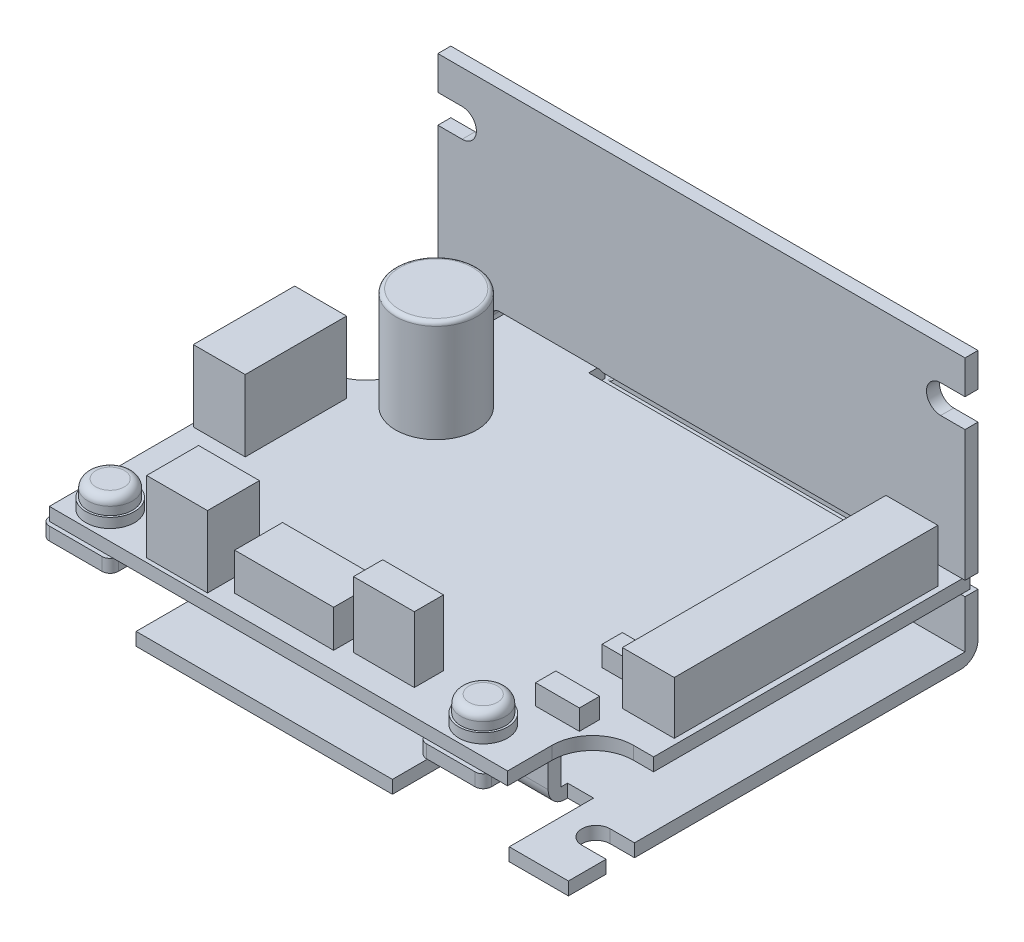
ISO-10303-21;
HEADER;
FILE_DESCRIPTION(('STEP AP214'),'2;1');
FILE_NAME('part.step','',(''),(''),'','','');
FILE_SCHEMA(('AUTOMOTIVE_DESIGN { 1 0 10303 214 1 1 1 1 }'));
ENDSEC;
DATA;
#1=APPLICATION_CONTEXT('core data for automotive mechanical design processes');
#2=APPLICATION_PROTOCOL_DEFINITION('international standard','automotive_design',2000,#1);
#3=PRODUCT_CONTEXT('',#1,'mechanical');
#4=PRODUCT('Part','Part','',(#3));
#5=PRODUCT_RELATED_PRODUCT_CATEGORY('part','',(#4));
#6=PRODUCT_DEFINITION_FORMATION('','',#4);
#7=PRODUCT_DEFINITION_CONTEXT('part definition',#1,'design');
#8=PRODUCT_DEFINITION('design','',#6,#7);
#9=PRODUCT_DEFINITION_SHAPE('','',#8);
#10=(LENGTH_UNIT() NAMED_UNIT(*) SI_UNIT(.MILLI.,.METRE.));
#11=(NAMED_UNIT(*) PLANE_ANGLE_UNIT() SI_UNIT($,.RADIAN.));
#12=(NAMED_UNIT(*) SI_UNIT($,.STERADIAN.) SOLID_ANGLE_UNIT());
#13=UNCERTAINTY_MEASURE_WITH_UNIT(LENGTH_MEASURE(1.E-05),#10,'distance_accuracy_value','');
#14=(GEOMETRIC_REPRESENTATION_CONTEXT(3) GLOBAL_UNCERTAINTY_ASSIGNED_CONTEXT((#13)) GLOBAL_UNIT_ASSIGNED_CONTEXT((#10,
#11,#12)) REPRESENTATION_CONTEXT('',''));
#15=CARTESIAN_POINT('',(0.,0.,0.));
#16=DIRECTION('',(0.,0.,1.));
#17=DIRECTION('',(1.,0.,0.));
#18=AXIS2_PLACEMENT_3D('',#15,#16,#17);
#19=CARTESIAN_POINT('',(46.,2.7,0.));
#20=DIRECTION('',(0.,1.,0.));
#21=DIRECTION('',(0.,0.,1.));
#22=AXIS2_PLACEMENT_3D('',#19,#20,#21);
#23=CYLINDRICAL_SURFACE('',#22,1.5);
#24=CARTESIAN_POINT('',(46.,2.7,0.));
#25=DIRECTION('',(0.,1.,0.));
#26=DIRECTION('',(0.,0.,1.));
#27=AXIS2_PLACEMENT_3D('',#24,#25,#26);
#28=CIRCLE('',#27,1.5);
#29=CARTESIAN_POINT('',(46.,2.7,1.50000000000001));
#30=VERTEX_POINT('',#29);
#31=EDGE_CURVE('E11',#30,#30,#28,.T.);
#32=ORIENTED_EDGE('',*,*,#31,.T.);
#33=EDGE_LOOP('',(#32));
#34=FACE_BOUND('',#33,.T.);
#35=CARTESIAN_POINT('',(46.,7.5,0.));
#36=DIRECTION('',(0.,1.,0.));
#37=DIRECTION('',(0.,0.,1.));
#38=AXIS2_PLACEMENT_3D('',#35,#36,#37);
#39=CIRCLE('',#38,1.5);
#40=CARTESIAN_POINT('',(46.,7.5,1.50000000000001));
#41=VERTEX_POINT('',#40);
#42=EDGE_CURVE('E46',#41,#41,#39,.T.);
#43=ORIENTED_EDGE('',*,*,#42,.F.);
#44=EDGE_LOOP('',(#43));
#45=FACE_BOUND('',#44,.T.);
#46=ADVANCED_FACE('F43',(#34,#45),#23,.T.);
#47=CARTESIAN_POINT('',(46.,2.7,0.));
#48=DIRECTION('',(0.,1.,0.));
#49=DIRECTION('',(0.,0.,1.));
#50=AXIS2_PLACEMENT_3D('',#47,#48,#49);
#51=PLANE('',#50);
#52=ORIENTED_EDGE('',*,*,#31,.F.);
#53=EDGE_LOOP('',(#52));
#54=FACE_BOUND('',#53,.T.);
#55=ADVANCED_FACE('F58',(#54),#51,.F.);
#56=CARTESIAN_POINT('',(46.,7.5,0.));
#57=DIRECTION('',(0.,1.,0.));
#58=DIRECTION('',(0.,0.,1.));
#59=AXIS2_PLACEMENT_3D('',#56,#57,#58);
#60=PLANE('',#59);
#61=ORIENTED_EDGE('',*,*,#42,.T.);
#62=EDGE_LOOP('',(#61));
#63=FACE_BOUND('',#62,.T.);
#64=ADVANCED_FACE('F55',(#63),#60,.T.);
#65=CLOSED_SHELL('',(#46,#55,#64));
#66=MANIFOLD_SOLID_BREP('B2',#65);
#67=CARTESIAN_POINT('',(0.,2.7,0.));
#68=DIRECTION('',(0.,1.,0.));
#69=DIRECTION('',(0.,0.,1.));
#70=AXIS2_PLACEMENT_3D('',#67,#68,#69);
#71=CYLINDRICAL_SURFACE('',#70,1.5);
#72=CARTESIAN_POINT('',(0.,2.7,0.));
#73=DIRECTION('',(0.,1.,0.));
#74=DIRECTION('',(0.,0.,1.));
#75=AXIS2_PLACEMENT_3D('',#72,#73,#74);
#76=CIRCLE('',#75,1.5);
#77=CARTESIAN_POINT('',(0.,2.7,1.5));
#78=VERTEX_POINT('',#77);
#79=EDGE_CURVE('E42',#78,#78,#76,.T.);
#80=ORIENTED_EDGE('',*,*,#79,.T.);
#81=EDGE_LOOP('',(#80));
#82=FACE_BOUND('',#81,.T.);
#83=CARTESIAN_POINT('',(0.,7.5,0.));
#84=DIRECTION('',(0.,1.,0.));
#85=DIRECTION('',(0.,0.,1.));
#86=AXIS2_PLACEMENT_3D('',#83,#84,#85);
#87=CIRCLE('',#86,1.5);
#88=CARTESIAN_POINT('',(0.,7.5,1.5));
#89=VERTEX_POINT('',#88);
#90=EDGE_CURVE('E95',#89,#89,#87,.T.);
#91=ORIENTED_EDGE('',*,*,#90,.F.);
#92=EDGE_LOOP('',(#91));
#93=FACE_BOUND('',#92,.T.);
#94=ADVANCED_FACE('F92',(#82,#93),#71,.T.);
#95=CARTESIAN_POINT('',(0.,2.7,0.));
#96=DIRECTION('',(0.,1.,0.));
#97=DIRECTION('',(0.,0.,1.));
#98=AXIS2_PLACEMENT_3D('',#95,#96,#97);
#99=PLANE('',#98);
#100=ORIENTED_EDGE('',*,*,#79,.F.);
#101=EDGE_LOOP('',(#100));
#102=FACE_BOUND('',#101,.T.);
#103=ADVANCED_FACE('F107',(#102),#99,.F.);
#104=CARTESIAN_POINT('',(0.,7.5,0.));
#105=DIRECTION('',(0.,1.,0.));
#106=DIRECTION('',(0.,0.,1.));
#107=AXIS2_PLACEMENT_3D('',#104,#105,#106);
#108=PLANE('',#107);
#109=ORIENTED_EDGE('',*,*,#90,.T.);
#110=EDGE_LOOP('',(#109));
#111=FACE_BOUND('',#110,.T.);
#112=ADVANCED_FACE('F104',(#111),#108,.T.);
#113=CLOSED_SHELL('',(#94,#103,#112));
#114=MANIFOLD_SOLID_BREP('B6',#113);
#115=CARTESIAN_POINT('',(46.,8.7,0.));
#116=DIRECTION('',(0.,1.,0.));
#117=DIRECTION('',(0.,0.,1.));
#118=AXIS2_PLACEMENT_3D('',#115,#116,#117);
#119=PLANE('',#118);
#120=CARTESIAN_POINT('',(46.,8.7,0.));
#121=DIRECTION('',(0.,1.,0.));
#122=DIRECTION('',(0.,0.,1.));
#123=AXIS2_PLACEMENT_3D('',#120,#121,#122);
#124=CIRCLE('',#123,3.);
#125=CARTESIAN_POINT('',(46.,8.7,3.00000000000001));
#126=VERTEX_POINT('',#125);
#127=EDGE_CURVE('E2103',#126,#126,#124,.T.);
#128=ORIENTED_EDGE('',*,*,#127,.T.);
#129=EDGE_LOOP('',(#128));
#130=FACE_BOUND('',#129,.T.);
#131=CARTESIAN_POINT('',(46.,8.7,0.));
#132=DIRECTION('',(0.,1.,0.));
#133=DIRECTION('',(0.,0.,1.));
#134=AXIS2_PLACEMENT_3D('',#131,#132,#133);
#135=CIRCLE('',#134,2.75);
#136=CARTESIAN_POINT('',(46.,8.7,2.75000000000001));
#137=VERTEX_POINT('',#136);
#138=EDGE_CURVE('E2096',#137,#137,#135,.T.);
#139=ORIENTED_EDGE('',*,*,#138,.F.);
#140=EDGE_LOOP('',(#139));
#141=FACE_BOUND('',#140,.T.);
#142=ADVANCED_FACE('F134',(#130,#141),#119,.T.);
#143=CARTESIAN_POINT('',(0.,8.7,0.));
#144=DIRECTION('',(0.,1.,0.));
#145=DIRECTION('',(0.,0.,1.));
#146=AXIS2_PLACEMENT_3D('',#143,#144,#145);
#147=PLANE('',#146);
#148=CARTESIAN_POINT('',(0.,8.7,0.));
#149=DIRECTION('',(0.,1.,0.));
#150=DIRECTION('',(0.,0.,1.));
#151=AXIS2_PLACEMENT_3D('',#148,#149,#150);
#152=CIRCLE('',#151,3.);
#153=CARTESIAN_POINT('',(0.,8.7,3.));
#154=VERTEX_POINT('',#153);
#155=EDGE_CURVE('E2111',#154,#154,#152,.T.);
#156=ORIENTED_EDGE('',*,*,#155,.T.);
#157=EDGE_LOOP('',(#156));
#158=FACE_BOUND('',#157,.T.);
#159=CARTESIAN_POINT('',(0.,8.7,0.));
#160=DIRECTION('',(0.,1.,0.));
#161=DIRECTION('',(0.,0.,1.));
#162=AXIS2_PLACEMENT_3D('',#159,#160,#161);
#163=CIRCLE('',#162,2.75);
#164=CARTESIAN_POINT('',(0.,8.7,2.75));
#165=VERTEX_POINT('',#164);
#166=EDGE_CURVE('E2097',#165,#165,#163,.T.);
#167=ORIENTED_EDGE('',*,*,#166,.F.);
#168=EDGE_LOOP('',(#167));
#169=FACE_BOUND('',#168,.T.);
#170=ADVANCED_FACE('F1587',(#158,#169),#147,.T.);
#171=CARTESIAN_POINT('',(0.,7.5,0.));
#172=DIRECTION('',(0.,1.,0.));
#173=DIRECTION('',(0.,0.,1.));
#174=AXIS2_PLACEMENT_3D('',#171,#172,#173);
#175=PLANE('',#174);
#176=CARTESIAN_POINT('',(0.,7.5,0.));
#177=DIRECTION('',(0.,1.,0.));
#178=DIRECTION('',(0.,0.,1.));
#179=AXIS2_PLACEMENT_3D('',#176,#177,#178);
#180=CIRCLE('',#179,3.);
#181=CARTESIAN_POINT('',(0.,7.5,3.));
#182=VERTEX_POINT('',#181);
#183=EDGE_CURVE('E2110',#182,#182,#180,.T.);
#184=ORIENTED_EDGE('',*,*,#183,.F.);
#185=EDGE_LOOP('',(#184));
#186=FACE_BOUND('',#185,.T.);
#187=DIRECTION('',(1.,0.,0.));
#188=VECTOR('',#187,1.);
#189=CARTESIAN_POINT('',(-3.6,7.5,-13.85));
#190=LINE('',#189,#188);
#191=CARTESIAN_POINT('',(-3.6,7.5,-13.85));
#192=VERTEX_POINT('',#191);
#193=CARTESIAN_POINT('',(2.8,7.5,-13.85));
#194=VERTEX_POINT('',#193);
#195=EDGE_CURVE('E2126',#192,#194,#190,.T.);
#196=ORIENTED_EDGE('',*,*,#195,.F.);
#197=DIRECTION('',(0.,0.,1.));
#198=VECTOR('',#197,1.);
#199=CARTESIAN_POINT('',(-3.6,7.5,-26.35));
#200=LINE('',#199,#198);
#201=CARTESIAN_POINT('',(-3.6,7.5,-26.35));
#202=VERTEX_POINT('',#201);
#203=EDGE_CURVE('E836',#202,#192,#200,.T.);
#204=ORIENTED_EDGE('',*,*,#203,.F.);
#205=DIRECTION('',(-1.,0.,0.));
#206=VECTOR('',#205,1.);
#207=CARTESIAN_POINT('',(-3.6,7.5,-26.35));
#208=LINE('',#207,#206);
#209=CARTESIAN_POINT('',(2.8,7.5,-26.35));
#210=VERTEX_POINT('',#209);
#211=EDGE_CURVE('E832',#210,#202,#208,.T.);
#212=ORIENTED_EDGE('',*,*,#211,.F.);
#213=DIRECTION('',(0.,0.,-1.));
#214=VECTOR('',#213,1.);
#215=CARTESIAN_POINT('',(2.8,7.5,-26.35));
#216=LINE('',#215,#214);
#217=EDGE_CURVE('E2128',#194,#210,#216,.T.);
#218=ORIENTED_EDGE('',*,*,#217,.F.);
#219=EDGE_LOOP('',(#196,#204,#212,#218));
#220=FACE_BOUND('',#219,.T.);
#221=DIRECTION('',(-1.,0.,0.));
#222=VECTOR('',#221,1.);
#223=CARTESIAN_POINT('',(16.7,7.5,-4.55));
#224=LINE('',#223,#222);
#225=CARTESIAN_POINT('',(28.9,7.5,-4.55));
#226=VERTEX_POINT('',#225);
#227=CARTESIAN_POINT('',(16.7,7.5,-4.55));
#228=VERTEX_POINT('',#227);
#229=EDGE_CURVE('E883',#226,#228,#224,.T.);
#230=ORIENTED_EDGE('',*,*,#229,.F.);
#231=DIRECTION('',(0.,0.,-1.));
#232=VECTOR('',#231,1.);
#233=CARTESIAN_POINT('',(28.9,7.5,-4.55));
#234=LINE('',#233,#232);
#235=CARTESIAN_POINT('',(28.9,7.5,1.35));
#236=VERTEX_POINT('',#235);
#237=EDGE_CURVE('E869',#236,#226,#234,.T.);
#238=ORIENTED_EDGE('',*,*,#237,.F.);
#239=DIRECTION('',(1.,0.,0.));
#240=VECTOR('',#239,1.);
#241=CARTESIAN_POINT('',(16.7,7.5,1.35));
#242=LINE('',#241,#240);
#243=CARTESIAN_POINT('',(16.7,7.5,1.35));
#244=VERTEX_POINT('',#243);
#245=EDGE_CURVE('E874',#244,#236,#242,.T.);
#246=ORIENTED_EDGE('',*,*,#245,.F.);
#247=DIRECTION('',(0.,0.,1.));
#248=VECTOR('',#247,1.);
#249=CARTESIAN_POINT('',(16.7,7.5,-4.55));
#250=LINE('',#249,#248);
#251=EDGE_CURVE('E885',#228,#244,#250,.T.);
#252=ORIENTED_EDGE('',*,*,#251,.F.);
#253=EDGE_LOOP('',(#230,#238,#246,#252));
#254=FACE_BOUND('',#253,.T.);
#255=DIRECTION('',(-1.,0.,0.));
#256=VECTOR('',#255,1.);
#257=CARTESIAN_POINT('',(47.3,7.5,-15.85));
#258=LINE('',#257,#256);
#259=CARTESIAN_POINT('',(52.7,7.5,-15.85));
#260=VERTEX_POINT('',#259);
#261=CARTESIAN_POINT('',(47.3,7.5,-15.85));
#262=VERTEX_POINT('',#261);
#263=EDGE_CURVE('E941',#260,#262,#258,.T.);
#264=ORIENTED_EDGE('',*,*,#263,.F.);
#265=DIRECTION('',(0.,0.,-1.));
#266=VECTOR('',#265,1.);
#267=CARTESIAN_POINT('',(52.7,7.5,-15.85));
#268=LINE('',#267,#266);
#269=CARTESIAN_POINT('',(52.7,7.5,-13.35));
#270=VERTEX_POINT('',#269);
#271=EDGE_CURVE('E927',#270,#260,#268,.T.);
#272=ORIENTED_EDGE('',*,*,#271,.F.);
#273=DIRECTION('',(1.,0.,0.));
#274=VECTOR('',#273,1.);
#275=CARTESIAN_POINT('',(47.3,7.5,-13.35));
#276=LINE('',#275,#274);
#277=CARTESIAN_POINT('',(47.3,7.5,-13.35));
#278=VERTEX_POINT('',#277);
#279=EDGE_CURVE('E932',#278,#270,#276,.T.);
#280=ORIENTED_EDGE('',*,*,#279,.F.);
#281=DIRECTION('',(0.,0.,1.));
#282=VECTOR('',#281,1.);
#283=CARTESIAN_POINT('',(47.3,7.5,-15.85));
#284=LINE('',#283,#282);
#285=EDGE_CURVE('E943',#262,#278,#284,.T.);
#286=ORIENTED_EDGE('',*,*,#285,.F.);
#287=EDGE_LOOP('',(#264,#272,#280,#286));
#288=FACE_BOUND('',#287,.T.);
#289=DIRECTION('',(1.,0.,0.));
#290=VECTOR('',#289,1.);
#291=CARTESIAN_POINT('',(52.9,7.5,-10.25));
#292=LINE('',#291,#290);
#293=CARTESIAN_POINT('',(52.9,7.5,-10.25));
#294=VERTEX_POINT('',#293);
#295=CARTESIAN_POINT('',(59.3,7.5,-10.25));
#296=VERTEX_POINT('',#295);
#297=EDGE_CURVE('E999',#294,#296,#292,.T.);
#298=ORIENTED_EDGE('',*,*,#297,.F.);
#299=DIRECTION('',(0.,0.,1.));
#300=VECTOR('',#299,1.);
#301=CARTESIAN_POINT('',(52.9,7.5,-42.75));
#302=LINE('',#301,#300);
#303=CARTESIAN_POINT('',(52.9,7.5,-42.75));
#304=VERTEX_POINT('',#303);
#305=EDGE_CURVE('E985',#304,#294,#302,.T.);
#306=ORIENTED_EDGE('',*,*,#305,.F.);
#307=DIRECTION('',(-1.,0.,0.));
#308=VECTOR('',#307,1.);
#309=CARTESIAN_POINT('',(52.9,7.5,-42.75));
#310=LINE('',#309,#308);
#311=CARTESIAN_POINT('',(59.3,7.5,-42.75));
#312=VERTEX_POINT('',#311);
#313=EDGE_CURVE('E990',#312,#304,#310,.T.);
#314=ORIENTED_EDGE('',*,*,#313,.F.);
#315=DIRECTION('',(0.,0.,-1.));
#316=VECTOR('',#315,1.);
#317=CARTESIAN_POINT('',(59.3,7.5,-42.75));
#318=LINE('',#317,#316);
#319=EDGE_CURVE('E1001',#296,#312,#318,.T.);
#320=ORIENTED_EDGE('',*,*,#319,.F.);
#321=EDGE_LOOP('',(#298,#306,#314,#320));
#322=FACE_BOUND('',#321,.T.);
#323=DIRECTION('',(0.,0.,1.));
#324=VECTOR('',#323,1.);
#325=CARTESIAN_POINT('',(15.,7.5,-46.));
#326=LINE('',#325,#324);
#327=CARTESIAN_POINT('',(15.,7.5,-46.));
#328=VERTEX_POINT('',#327);
#329=CARTESIAN_POINT('',(15.,7.5,-44.));
#330=VERTEX_POINT('',#329);
#331=EDGE_CURVE('E1014',#328,#330,#326,.T.);
#332=ORIENTED_EDGE('',*,*,#331,.F.);
#333=DIRECTION('',(1.,0.,0.));
#334=VECTOR('',#333,1.);
#335=CARTESIAN_POINT('',(0.,7.5,-46.));
#336=LINE('',#335,#334);
#337=CARTESIAN_POINT('',(3.5,7.5,-46.));
#338=VERTEX_POINT('',#337);
#339=EDGE_CURVE('E1059',#338,#328,#336,.T.);
#340=ORIENTED_EDGE('',*,*,#339,.F.);
#341=DIRECTION('',(0.,0.,1.));
#342=VECTOR('',#341,1.);
#343=CARTESIAN_POINT('',(3.5,7.5,0.));
#344=LINE('',#343,#342);
#345=CARTESIAN_POINT('',(3.5,7.5,-33.));
#346=VERTEX_POINT('',#345);
#347=EDGE_CURVE('E1062',#338,#346,#344,.T.);
#348=ORIENTED_EDGE('',*,*,#347,.T.);
#349=CARTESIAN_POINT('',(-1.5,7.5,-33.));
#350=DIRECTION('',(0.,1.,0.));
#351=DIRECTION('',(0.,0.,1.));
#352=AXIS2_PLACEMENT_3D('',#349,#350,#351);
#353=CIRCLE('',#352,5.);
#354=CARTESIAN_POINT('',(-1.50000000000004,7.5,-28.));
#355=VERTEX_POINT('',#354);
#356=EDGE_CURVE('E1064',#346,#355,#353,.F.);
#357=ORIENTED_EDGE('',*,*,#356,.T.);
#358=DIRECTION('',(-1.,0.,0.));
#359=VECTOR('',#358,1.);
#360=CARTESIAN_POINT('',(0.,7.5,-28.));
#361=LINE('',#360,#359);
#362=CARTESIAN_POINT('',(-4.,7.5,-28.));
#363=VERTEX_POINT('',#362);
#364=EDGE_CURVE('E1066',#355,#363,#361,.T.);
#365=ORIENTED_EDGE('',*,*,#364,.T.);
#366=DIRECTION('',(0.,0.,-1.));
#367=VECTOR('',#366,1.);
#368=CARTESIAN_POINT('',(-4.,7.5,0.));
#369=LINE('',#368,#367);
#370=CARTESIAN_POINT('',(-4.,7.5,3.50000000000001));
#371=VERTEX_POINT('',#370);
#372=EDGE_CURVE('E1042',#371,#363,#369,.T.);
#373=ORIENTED_EDGE('',*,*,#372,.F.);
#374=DIRECTION('',(1.,0.,0.));
#375=VECTOR('',#374,1.);
#376=CARTESIAN_POINT('',(0.,7.5,3.50000000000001));
#377=LINE('',#376,#375);
#378=CARTESIAN_POINT('',(52.5,7.5,3.50000000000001));
#379=VERTEX_POINT('',#378);
#380=EDGE_CURVE('E1045',#371,#379,#377,.T.);
#381=ORIENTED_EDGE('',*,*,#380,.T.);
#382=DIRECTION('',(0.,0.,-1.));
#383=VECTOR('',#382,1.);
#384=CARTESIAN_POINT('',(52.5,7.5,0.));
#385=LINE('',#384,#383);
#386=CARTESIAN_POINT('',(52.5,7.5,-1.99999999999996));
#387=VERTEX_POINT('',#386);
#388=EDGE_CURVE('E1048',#379,#387,#385,.T.);
#389=ORIENTED_EDGE('',*,*,#388,.T.);
#390=CARTESIAN_POINT('',(57.5,7.5,-2.));
#391=DIRECTION('',(0.,1.,0.));
#392=DIRECTION('',(0.,0.,1.));
#393=AXIS2_PLACEMENT_3D('',#390,#391,#392);
#394=CIRCLE('',#393,5.);
#395=CARTESIAN_POINT('',(57.5,7.5,-7.));
#396=VERTEX_POINT('',#395);
#397=EDGE_CURVE('E1050',#396,#387,#394,.T.);
#398=ORIENTED_EDGE('',*,*,#397,.F.);
#399=DIRECTION('',(1.,0.,0.));
#400=VECTOR('',#399,1.);
#401=CARTESIAN_POINT('',(0.,7.5,-7.));
#402=LINE('',#401,#400);
#403=CARTESIAN_POINT('',(60.,7.5,-7.));
#404=VERTEX_POINT('',#403);
#405=EDGE_CURVE('E1053',#396,#404,#402,.T.);
#406=ORIENTED_EDGE('',*,*,#405,.T.);
#407=DIRECTION('',(0.,0.,-1.));
#408=VECTOR('',#407,1.);
#409=CARTESIAN_POINT('',(60.,7.5,0.));
#410=LINE('',#409,#408);
#411=CARTESIAN_POINT('',(60.,7.5,-46.));
#412=VERTEX_POINT('',#411);
#413=EDGE_CURVE('E1055',#404,#412,#410,.T.);
#414=ORIENTED_EDGE('',*,*,#413,.T.);
#415=CARTESIAN_POINT('',(48.,7.5,-46.));
#416=VERTEX_POINT('',#415);
#417=EDGE_CURVE('E1058',#416,#412,#336,.T.);
#418=ORIENTED_EDGE('',*,*,#417,.F.);
#419=DIRECTION('',(0.,0.,-1.));
#420=VECTOR('',#419,1.);
#421=CARTESIAN_POINT('',(48.,7.5,-46.));
#422=LINE('',#421,#420);
#423=CARTESIAN_POINT('',(48.,7.5,-44.));
#424=VERTEX_POINT('',#423);
#425=EDGE_CURVE('E1031',#424,#416,#422,.T.);
#426=ORIENTED_EDGE('',*,*,#425,.F.);
#427=DIRECTION('',(1.,0.,0.));
#428=VECTOR('',#427,1.);
#429=CARTESIAN_POINT('',(15.,7.5,-44.));
#430=LINE('',#429,#428);
#431=EDGE_CURVE('E1028',#330,#424,#430,.T.);
#432=ORIENTED_EDGE('',*,*,#431,.F.);
#433=EDGE_LOOP('',(#332,#340,#348,#357,#365,#373,#381,#389,#398,#406,#414,#418,#426,#432));
#434=FACE_BOUND('',#433,.T.);
#435=DIRECTION('',(-1.,0.,0.));
#436=VECTOR('',#435,1.);
#437=CARTESIAN_POINT('',(47.3,7.5,-7.65));
#438=LINE('',#437,#436);
#439=CARTESIAN_POINT('',(52.7,7.5,-7.65));
#440=VERTEX_POINT('',#439);
#441=CARTESIAN_POINT('',(47.3,7.5,-7.65));
#442=VERTEX_POINT('',#441);
#443=EDGE_CURVE('E970',#440,#442,#438,.T.);
#444=ORIENTED_EDGE('',*,*,#443,.F.);
#445=DIRECTION('',(0.,0.,-1.));
#446=VECTOR('',#445,1.);
#447=CARTESIAN_POINT('',(52.7,7.5,-7.65));
#448=LINE('',#447,#446);
#449=CARTESIAN_POINT('',(52.7,7.5,-5.15));
#450=VERTEX_POINT('',#449);
#451=EDGE_CURVE('E956',#450,#440,#448,.T.);
#452=ORIENTED_EDGE('',*,*,#451,.F.);
#453=DIRECTION('',(1.,0.,0.));
#454=VECTOR('',#453,1.);
#455=CARTESIAN_POINT('',(47.3,7.5,-5.15));
#456=LINE('',#455,#454);
#457=CARTESIAN_POINT('',(47.3,7.5,-5.15));
#458=VERTEX_POINT('',#457);
#459=EDGE_CURVE('E961',#458,#450,#456,.T.);
#460=ORIENTED_EDGE('',*,*,#459,.F.);
#461=DIRECTION('',(0.,0.,1.));
#462=VECTOR('',#461,1.);
#463=CARTESIAN_POINT('',(47.3,7.5,-7.65));
#464=LINE('',#463,#462);
#465=EDGE_CURVE('E972',#442,#458,#464,.T.);
#466=ORIENTED_EDGE('',*,*,#465,.F.);
#467=EDGE_LOOP('',(#444,#452,#460,#466));
#468=FACE_BOUND('',#467,.T.);
#469=DIRECTION('',(-1.,0.,0.));
#470=VECTOR('',#469,1.);
#471=CARTESIAN_POINT('',(30.35,7.5,-3.25));
#472=LINE('',#471,#470);
#473=CARTESIAN_POINT('',(37.85,7.5,-3.25));
#474=VERTEX_POINT('',#473);
#475=CARTESIAN_POINT('',(30.35,7.5,-3.25));
#476=VERTEX_POINT('',#475);
#477=EDGE_CURVE('E912',#474,#476,#472,.T.);
#478=ORIENTED_EDGE('',*,*,#477,.F.);
#479=DIRECTION('',(0.,0.,-1.));
#480=VECTOR('',#479,1.);
#481=CARTESIAN_POINT('',(37.85,7.5,-3.25));
#482=LINE('',#481,#480);
#483=CARTESIAN_POINT('',(37.85,7.5,0.35));
#484=VERTEX_POINT('',#483);
#485=EDGE_CURVE('E898',#484,#474,#482,.T.);
#486=ORIENTED_EDGE('',*,*,#485,.F.);
#487=DIRECTION('',(1.,0.,0.));
#488=VECTOR('',#487,1.);
#489=CARTESIAN_POINT('',(30.35,7.5,0.35));
#490=LINE('',#489,#488);
#491=CARTESIAN_POINT('',(30.35,7.5,0.35));
#492=VERTEX_POINT('',#491);
#493=EDGE_CURVE('E903',#492,#484,#490,.T.);
#494=ORIENTED_EDGE('',*,*,#493,.F.);
#495=DIRECTION('',(0.,0.,1.));
#496=VECTOR('',#495,1.);
#497=CARTESIAN_POINT('',(30.35,7.5,-3.25));
#498=LINE('',#497,#496);
#499=EDGE_CURVE('E914',#476,#492,#498,.T.);
#500=ORIENTED_EDGE('',*,*,#499,.F.);
#501=EDGE_LOOP('',(#478,#486,#494,#500));
#502=FACE_BOUND('',#501,.T.);
#503=DIRECTION('',(-1.,0.,0.));
#504=VECTOR('',#503,1.);
#505=CARTESIAN_POINT('',(7.5,7.5,-3.4));
#506=LINE('',#505,#504);
#507=CARTESIAN_POINT('',(15.,7.5,-3.4));
#508=VERTEX_POINT('',#507);
#509=CARTESIAN_POINT('',(7.5,7.5,-3.4));
#510=VERTEX_POINT('',#509);
#511=EDGE_CURVE('E841',#508,#510,#506,.T.);
#512=ORIENTED_EDGE('',*,*,#511,.F.);
#513=DIRECTION('',(0.,0.,-1.));
#514=VECTOR('',#513,1.);
#515=CARTESIAN_POINT('',(15.,7.5,-3.4));
#516=LINE('',#515,#514);
#517=CARTESIAN_POINT('',(15.,7.5,3.));
#518=VERTEX_POINT('',#517);
#519=EDGE_CURVE('E838',#518,#508,#516,.T.);
#520=ORIENTED_EDGE('',*,*,#519,.F.);
#521=DIRECTION('',(1.,0.,0.));
#522=VECTOR('',#521,1.);
#523=CARTESIAN_POINT('',(7.5,7.5,3.));
#524=LINE('',#523,#522);
#525=CARTESIAN_POINT('',(7.5,7.5,3.));
#526=VERTEX_POINT('',#525);
#527=EDGE_CURVE('E850',#526,#518,#524,.T.);
#528=ORIENTED_EDGE('',*,*,#527,.F.);
#529=DIRECTION('',(0.,0.,1.));
#530=VECTOR('',#529,1.);
#531=CARTESIAN_POINT('',(7.5,7.5,-3.4));
#532=LINE('',#531,#530);
#533=EDGE_CURVE('E858',#510,#526,#532,.T.);
#534=ORIENTED_EDGE('',*,*,#533,.F.);
#535=EDGE_LOOP('',(#512,#520,#528,#534));
#536=FACE_BOUND('',#535,.T.);
#537=CARTESIAN_POINT('',(9.2,7.5,-31.));
#538=DIRECTION('',(0.,1.,0.));
#539=DIRECTION('',(0.,0.,1.));
#540=AXIS2_PLACEMENT_3D('',#537,#538,#539);
#541=CIRCLE('',#540,5.);
#542=CARTESIAN_POINT('',(9.2,7.5,-26.));
#543=VERTEX_POINT('',#542);
#544=EDGE_CURVE('E2119',#543,#543,#541,.T.);
#545=ORIENTED_EDGE('',*,*,#544,.F.);
#546=EDGE_LOOP('',(#545));
#547=FACE_BOUND('',#546,.T.);
#548=CARTESIAN_POINT('',(46.,7.5,0.));
#549=DIRECTION('',(0.,1.,0.));
#550=DIRECTION('',(0.,0.,1.));
#551=AXIS2_PLACEMENT_3D('',#548,#549,#550);
#552=CIRCLE('',#551,3.);
#553=CARTESIAN_POINT('',(46.,7.5,3.00000000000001));
#554=VERTEX_POINT('',#553);
#555=EDGE_CURVE('E2100',#554,#554,#552,.T.);
#556=ORIENTED_EDGE('',*,*,#555,.F.);
#557=EDGE_LOOP('',(#556));
#558=FACE_BOUND('',#557,.T.);
#559=ADVANCED_FACE('F1594',(#186,#220,#254,#288,#322,#434,#468,#502,#536,#547,#558),#175,.T.);
#560=CARTESIAN_POINT('',(46.5,5.9,-46.5));
#561=DIRECTION('',(0.,-1.,0.));
#562=DIRECTION('',(1.,0.,0.));
#563=AXIS2_PLACEMENT_3D('',#560,#561,#562);
#564=PLANE('',#563);
#565=DIRECTION('',(0.,0.,1.));
#566=VECTOR('',#565,1.);
#567=CARTESIAN_POINT('',(3.5,5.9,0.));
#568=LINE('',#567,#566);
#569=CARTESIAN_POINT('',(3.5,5.9,-46.));
#570=VERTEX_POINT('',#569);
#571=CARTESIAN_POINT('',(3.50000000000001,5.9,-44.9));
#572=VERTEX_POINT('',#571);
#573=EDGE_CURVE('E1093',#570,#572,#568,.T.);
#574=ORIENTED_EDGE('',*,*,#573,.F.);
#575=DIRECTION('',(1.,0.,0.));
#576=VECTOR('',#575,1.);
#577=CARTESIAN_POINT('',(0.,5.9,-46.));
#578=LINE('',#577,#576);
#579=CARTESIAN_POINT('',(15.,5.9,-46.));
#580=VERTEX_POINT('',#579);
#581=EDGE_CURVE('E1090',#570,#580,#578,.T.);
#582=ORIENTED_EDGE('',*,*,#581,.T.);
#583=DIRECTION('',(0.,0.,1.));
#584=VECTOR('',#583,1.);
#585=CARTESIAN_POINT('',(15.,5.9,-46.));
#586=LINE('',#585,#584);
#587=CARTESIAN_POINT('',(15.,5.9,-44.9));
#588=VERTEX_POINT('',#587);
#589=EDGE_CURVE('E1015',#580,#588,#586,.T.);
#590=ORIENTED_EDGE('',*,*,#589,.T.);
#591=DIRECTION('',(1.,0.,0.));
#592=VECTOR('',#591,1.);
#593=CARTESIAN_POINT('',(46.5,5.9,-44.9));
#594=LINE('',#593,#592);
#595=CARTESIAN_POINT('',(48.,5.9,-44.9));
#596=VERTEX_POINT('',#595);
#597=EDGE_CURVE('E1370',#588,#596,#594,.T.);
#598=ORIENTED_EDGE('',*,*,#597,.T.);
#599=DIRECTION('',(0.,0.,-1.));
#600=VECTOR('',#599,1.);
#601=CARTESIAN_POINT('',(48.,5.9,-46.));
#602=LINE('',#601,#600);
#603=CARTESIAN_POINT('',(48.,5.9,-46.));
#604=VERTEX_POINT('',#603);
#605=EDGE_CURVE('E1021',#596,#604,#602,.T.);
#606=ORIENTED_EDGE('',*,*,#605,.T.);
#607=CARTESIAN_POINT('',(60.,5.9,-46.));
#608=VERTEX_POINT('',#607);
#609=EDGE_CURVE('E1089',#604,#608,#578,.T.);
#610=ORIENTED_EDGE('',*,*,#609,.T.);
#611=DIRECTION('',(0.,0.,-1.));
#612=VECTOR('',#611,1.);
#613=CARTESIAN_POINT('',(60.,5.9,0.));
#614=LINE('',#613,#612);
#615=CARTESIAN_POINT('',(60.,5.9,-44.9));
#616=VERTEX_POINT('',#615);
#617=EDGE_CURVE('E1085',#616,#608,#614,.T.);
#618=ORIENTED_EDGE('',*,*,#617,.F.);
#619=CARTESIAN_POINT('',(60.5,5.9,-44.9));
#620=VERTEX_POINT('',#619);
#621=EDGE_CURVE('E1356',#616,#620,#594,.T.);
#622=ORIENTED_EDGE('',*,*,#621,.T.);
#623=DIRECTION('',(0.,0.,1.));
#624=VECTOR('',#623,1.);
#625=CARTESIAN_POINT('',(60.5,5.9,-46.5));
#626=LINE('',#625,#624);
#627=CARTESIAN_POINT('',(60.5,5.9,-46.5));
#628=VERTEX_POINT('',#627);
#629=EDGE_CURVE('E1366',#628,#620,#626,.T.);
#630=ORIENTED_EDGE('',*,*,#629,.F.);
#631=DIRECTION('',(1.,0.,0.));
#632=VECTOR('',#631,1.);
#633=CARTESIAN_POINT('',(46.5,5.9,-46.5));
#634=LINE('',#633,#632);
#635=CARTESIAN_POINT('',(47.375,5.9,-46.5));
#636=VERTEX_POINT('',#635);
#637=EDGE_CURVE('E1359',#636,#628,#634,.T.);
#638=ORIENTED_EDGE('',*,*,#637,.F.);
#639=DIRECTION('',(0.,0.,1.));
#640=VECTOR('',#639,1.);
#641=CARTESIAN_POINT('',(47.375,5.9,-44.9));
#642=LINE('',#641,#640);
#643=CARTESIAN_POINT('',(47.375,5.9,-46.));
#644=VERTEX_POINT('',#643);
#645=EDGE_CURVE('E1500',#636,#644,#642,.T.);
#646=ORIENTED_EDGE('',*,*,#645,.T.);
#647=DIRECTION('',(-1.,0.,0.));
#648=VECTOR('',#647,1.);
#649=CARTESIAN_POINT('',(15.,5.9,-46.));
#650=LINE('',#649,#648);
#651=CARTESIAN_POINT('',(15.325,5.9,-46.));
#652=VERTEX_POINT('',#651);
#653=EDGE_CURVE('E1138',#644,#652,#650,.T.);
#654=ORIENTED_EDGE('',*,*,#653,.T.);
#655=DIRECTION('',(0.,0.,1.));
#656=VECTOR('',#655,1.);
#657=CARTESIAN_POINT('',(15.325,5.9,-46.5));
#658=LINE('',#657,#656);
#659=CARTESIAN_POINT('',(15.325,5.9,-46.5));
#660=VERTEX_POINT('',#659);
#661=EDGE_CURVE('E1512',#652,#660,#658,.F.);
#662=ORIENTED_EDGE('',*,*,#661,.T.);
#663=DIRECTION('',(1.,0.,0.));
#664=VECTOR('',#663,1.);
#665=CARTESIAN_POINT('',(16.2,5.9,-46.5));
#666=LINE('',#665,#664);
#667=CARTESIAN_POINT('',(3.075,5.9,-46.5));
#668=VERTEX_POINT('',#667);
#669=EDGE_CURVE('E1353',#668,#660,#666,.T.);
#670=ORIENTED_EDGE('',*,*,#669,.F.);
#671=DIRECTION('',(0.,0.,1.));
#672=VECTOR('',#671,1.);
#673=CARTESIAN_POINT('',(3.075,5.9,-44.9));
#674=LINE('',#673,#672);
#675=CARTESIAN_POINT('',(3.075,5.9,-44.9));
#676=VERTEX_POINT('',#675);
#677=EDGE_CURVE('E1509',#668,#676,#674,.T.);
#678=ORIENTED_EDGE('',*,*,#677,.T.);
#679=EDGE_CURVE('E1367',#676,#572,#594,.T.);
#680=ORIENTED_EDGE('',*,*,#679,.T.);
#681=EDGE_LOOP('',(#574,#582,#590,#598,#606,#610,#618,#622,#630,#638,#646,#654,#662,#670,#678,#680));
#682=FACE_BOUND('',#681,.T.);
#683=ADVANCED_FACE('F1776',(#682),#564,.F.);
#684=CARTESIAN_POINT('',(0.,5.9,0.));
#685=DIRECTION('',(0.,-1.,0.));
#686=DIRECTION('',(0.,0.,-1.));
#687=AXIS2_PLACEMENT_3D('',#684,#685,#686);
#688=PLANE('',#687);
#689=DIRECTION('',(1.,0.,0.));
#690=VECTOR('',#689,1.);
#691=CARTESIAN_POINT('',(0.,5.9,3.50000000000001));
#692=LINE('',#691,#690);
#693=CARTESIAN_POINT('',(42.1339745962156,5.9,3.50000000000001));
#694=VERTEX_POINT('',#693);
#695=CARTESIAN_POINT('',(49.8660254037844,5.9,3.50000000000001));
#696=VERTEX_POINT('',#695);
#697=EDGE_CURVE('E2364',#694,#696,#692,.T.);
#698=ORIENTED_EDGE('',*,*,#697,.F.);
#699=CARTESIAN_POINT('',(43.,5.9,3.00000000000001));
#700=DIRECTION('',(0.,-1.,0.));
#701=DIRECTION('',(0.,0.,-1.));
#702=AXIS2_PLACEMENT_3D('',#699,#700,#701);
#703=CIRCLE('',#702,1.);
#704=CARTESIAN_POINT('',(43.,5.9,4.00000000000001));
#705=VERTEX_POINT('',#704);
#706=EDGE_CURVE('E1434',#694,#705,#703,.F.);
#707=ORIENTED_EDGE('',*,*,#706,.T.);
#708=DIRECTION('',(-1.,0.,0.));
#709=VECTOR('',#708,1.);
#710=CARTESIAN_POINT('',(42.,5.9,4.00000000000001));
#711=LINE('',#710,#709);
#712=CARTESIAN_POINT('',(49.,5.9,4.00000000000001));
#713=VERTEX_POINT('',#712);
#714=EDGE_CURVE('E1220',#713,#705,#711,.T.);
#715=ORIENTED_EDGE('',*,*,#714,.F.);
#716=CARTESIAN_POINT('',(49.,5.9,3.00000000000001));
#717=DIRECTION('',(0.,-1.,0.));
#718=DIRECTION('',(0.,0.,-1.));
#719=AXIS2_PLACEMENT_3D('',#716,#717,#718);
#720=CIRCLE('',#719,1.);
#721=EDGE_CURVE('E1431',#713,#696,#720,.F.);
#722=ORIENTED_EDGE('',*,*,#721,.T.);
#723=EDGE_LOOP('',(#698,#707,#715,#722));
#724=FACE_BOUND('',#723,.T.);
#725=ADVANCED_FACE('F1888',(#724),#688,.F.);
#726=CARTESIAN_POINT('',(0.,5.9,0.));
#727=DIRECTION('',(0.,1.,0.));
#728=DIRECTION('',(0.,0.,1.));
#729=AXIS2_PLACEMENT_3D('',#726,#727,#728);
#730=PLANE('',#729);
#731=DIRECTION('',(0.,0.,-1.));
#732=VECTOR('',#731,1.);
#733=CARTESIAN_POINT('',(-4.,5.9,0.));
#734=LINE('',#733,#732);
#735=CARTESIAN_POINT('',(-4.,5.9,3.50000000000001));
#736=VERTEX_POINT('',#735);
#737=CARTESIAN_POINT('',(-4.,5.9,-3.5));
#738=VERTEX_POINT('',#737);
#739=EDGE_CURVE('E1069',#736,#738,#734,.T.);
#740=ORIENTED_EDGE('',*,*,#739,.T.);
#741=DIRECTION('',(-1.,0.,0.));
#742=VECTOR('',#741,1.);
#743=CARTESIAN_POINT('',(-4.5,5.9,-3.5));
#744=LINE('',#743,#742);
#745=CARTESIAN_POINT('',(-4.5,5.9,-3.5));
#746=VERTEX_POINT('',#745);
#747=EDGE_CURVE('E1491',#738,#746,#744,.T.);
#748=ORIENTED_EDGE('',*,*,#747,.T.);
#749=DIRECTION('',(0.,0.,1.));
#750=VECTOR('',#749,1.);
#751=CARTESIAN_POINT('',(-4.5,5.9,-4.));
#752=LINE('',#751,#750);
#753=CARTESIAN_POINT('',(-4.5,5.9,3.));
#754=VERTEX_POINT('',#753);
#755=EDGE_CURVE('E1180',#746,#754,#752,.T.);
#756=ORIENTED_EDGE('',*,*,#755,.T.);
#757=CARTESIAN_POINT('',(-3.5,5.9,3.));
#758=DIRECTION('',(0.,1.,0.));
#759=DIRECTION('',(0.,0.,1.));
#760=AXIS2_PLACEMENT_3D('',#757,#758,#759);
#761=CIRCLE('',#760,1.);
#762=CARTESIAN_POINT('',(-3.5,5.9,4.));
#763=VERTEX_POINT('',#762);
#764=EDGE_CURVE('E1464',#754,#763,#761,.T.);
#765=ORIENTED_EDGE('',*,*,#764,.T.);
#766=DIRECTION('',(-1.,0.,0.));
#767=VECTOR('',#766,1.);
#768=CARTESIAN_POINT('',(-4.5,5.9,4.));
#769=LINE('',#768,#767);
#770=CARTESIAN_POINT('',(3.,5.9,4.));
#771=VERTEX_POINT('',#770);
#772=EDGE_CURVE('E1163',#771,#763,#769,.T.);
#773=ORIENTED_EDGE('',*,*,#772,.F.);
#774=CARTESIAN_POINT('',(3.,5.9,3.));
#775=DIRECTION('',(0.,1.,0.));
#776=DIRECTION('',(0.,0.,1.));
#777=AXIS2_PLACEMENT_3D('',#774,#775,#776);
#778=CIRCLE('',#777,1.);
#779=CARTESIAN_POINT('',(3.86602540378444,5.9,3.50000000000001));
#780=VERTEX_POINT('',#779);
#781=EDGE_CURVE('E1466',#771,#780,#778,.T.);
#782=ORIENTED_EDGE('',*,*,#781,.T.);
#783=EDGE_CURVE('E1073',#736,#780,#692,.T.);
#784=ORIENTED_EDGE('',*,*,#783,.F.);
#785=EDGE_LOOP('',(#740,#748,#756,#765,#773,#782,#784));
#786=FACE_BOUND('',#785,.T.);
#787=ADVANCED_FACE('F1852',(#786),#730,.T.);
#788=CARTESIAN_POINT('',(-4.5,31.4,-44.9));
#789=DIRECTION('',(0.,0.,-1.));
#790=DIRECTION('',(-1.,0.,0.));
#791=AXIS2_PLACEMENT_3D('',#788,#789,#790);
#792=PLANE('',#791);
#793=ORIENTED_EDGE('',*,*,#679,.F.);
#794=CARTESIAN_POINT('',(3.075,6.775,-44.9));
#795=DIRECTION('',(0.,0.,-1.));
#796=DIRECTION('',(-1.,0.,0.));
#797=AXIS2_PLACEMENT_3D('',#794,#795,#796);
#798=CIRCLE('',#797,0.875);
#799=CARTESIAN_POINT('',(2.2,6.775,-44.9));
#800=VERTEX_POINT('',#799);
#801=EDGE_CURVE('E1532',#676,#800,#798,.T.);
#802=ORIENTED_EDGE('',*,*,#801,.T.);
#803=CARTESIAN_POINT('',(3.075,6.775,-44.9));
#804=DIRECTION('',(0.,0.,-1.));
#805=DIRECTION('',(-1.,0.,0.));
#806=AXIS2_PLACEMENT_3D('',#803,#804,#805);
#807=CIRCLE('',#806,0.875);
#808=CARTESIAN_POINT('',(3.075,7.65,-44.9));
#809=VERTEX_POINT('',#808);
#810=EDGE_CURVE('E1521',#800,#809,#807,.T.);
#811=ORIENTED_EDGE('',*,*,#810,.T.);
#812=DIRECTION('',(-1.,0.,0.));
#813=VECTOR('',#812,1.);
#814=CARTESIAN_POINT('',(16.2,7.65,-44.9));
#815=LINE('',#814,#813);
#816=CARTESIAN_POINT('',(15.325,7.65,-44.9));
#817=VERTEX_POINT('',#816);
#818=EDGE_CURVE('E1342',#817,#809,#815,.T.);
#819=ORIENTED_EDGE('',*,*,#818,.F.);
#820=CARTESIAN_POINT('',(15.325,6.775,-44.9));
#821=DIRECTION('',(0.,0.,-1.));
#822=DIRECTION('',(-1.,0.,0.));
#823=AXIS2_PLACEMENT_3D('',#820,#821,#822);
#824=CIRCLE('',#823,0.875);
#825=CARTESIAN_POINT('',(15.8148979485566,7.5,-44.9));
#826=VERTEX_POINT('',#825);
#827=EDGE_CURVE('E1525',#817,#826,#824,.T.);
#828=ORIENTED_EDGE('',*,*,#827,.T.);
#829=DIRECTION('',(1.,0.,0.));
#830=VECTOR('',#829,1.);
#831=CARTESIAN_POINT('',(-4.5,7.5,-44.9));
#832=LINE('',#831,#830);
#833=CARTESIAN_POINT('',(46.8851020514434,7.5,-44.9));
#834=VERTEX_POINT('',#833);
#835=EDGE_CURVE('E1141',#826,#834,#832,.T.);
#836=ORIENTED_EDGE('',*,*,#835,.T.);
#837=CARTESIAN_POINT('',(47.375,6.775,-44.9));
#838=DIRECTION('',(0.,0.,-1.));
#839=DIRECTION('',(-1.,0.,0.));
#840=AXIS2_PLACEMENT_3D('',#837,#838,#839);
#841=CIRCLE('',#840,0.875);
#842=CARTESIAN_POINT('',(47.375,7.65,-44.9));
#843=VERTEX_POINT('',#842);
#844=EDGE_CURVE('E1514',#834,#843,#841,.T.);
#845=ORIENTED_EDGE('',*,*,#844,.T.);
#846=DIRECTION('',(-1.,0.,0.));
#847=VECTOR('',#846,1.);
#848=CARTESIAN_POINT('',(46.5,7.65,-44.9));
#849=LINE('',#848,#847);
#850=CARTESIAN_POINT('',(60.5,7.65,-44.9));
#851=VERTEX_POINT('',#850);
#852=EDGE_CURVE('E1363',#851,#843,#849,.T.);
#853=ORIENTED_EDGE('',*,*,#852,.F.);
#854=DIRECTION('',(0.,-1.,0.));
#855=VECTOR('',#854,1.);
#856=CARTESIAN_POINT('',(60.5,31.4,-44.9));
#857=LINE('',#856,#855);
#858=CARTESIAN_POINT('',(60.5,23.75,-44.9));
#859=VERTEX_POINT('',#858);
#860=EDGE_CURVE('E1406',#859,#851,#857,.T.);
#861=ORIENTED_EDGE('',*,*,#860,.F.);
#862=DIRECTION('',(1.,0.,0.));
#863=VECTOR('',#862,1.);
#864=CARTESIAN_POINT('',(57.5,23.75,-44.9));
#865=LINE('',#864,#863);
#866=CARTESIAN_POINT('',(57.5,23.75,-44.9));
#867=VERTEX_POINT('',#866);
#868=EDGE_CURVE('E1336',#867,#859,#865,.T.);
#869=ORIENTED_EDGE('',*,*,#868,.F.);
#870=CARTESIAN_POINT('',(57.5,25.5,-44.9));
#871=DIRECTION('',(0.,0.,1.));
#872=DIRECTION('',(1.,0.,0.));
#873=AXIS2_PLACEMENT_3D('',#870,#871,#872);
#874=CIRCLE('',#873,1.75000000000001);
#875=CARTESIAN_POINT('',(57.5,27.25,-44.9));
#876=VERTEX_POINT('',#875);
#877=EDGE_CURVE('E1316',#876,#867,#874,.T.);
#878=ORIENTED_EDGE('',*,*,#877,.F.);
#879=DIRECTION('',(-1.,0.,0.));
#880=VECTOR('',#879,1.);
#881=CARTESIAN_POINT('',(57.5,27.25,-44.9));
#882=LINE('',#881,#880);
#883=CARTESIAN_POINT('',(60.5,27.25,-44.9));
#884=VERTEX_POINT('',#883);
#885=EDGE_CURVE('E1328',#884,#876,#882,.T.);
#886=ORIENTED_EDGE('',*,*,#885,.F.);
#887=CARTESIAN_POINT('',(60.5,31.4,-44.9));
#888=VERTEX_POINT('',#887);
#889=EDGE_CURVE('E1402',#888,#884,#857,.T.);
#890=ORIENTED_EDGE('',*,*,#889,.F.);
#891=DIRECTION('',(1.,0.,0.));
#892=VECTOR('',#891,1.);
#893=CARTESIAN_POINT('',(-4.5,31.4,-44.9));
#894=LINE('',#893,#892);
#895=CARTESIAN_POINT('',(-4.5,31.4,-44.9));
#896=VERTEX_POINT('',#895);
#897=EDGE_CURVE('E1382',#896,#888,#894,.T.);
#898=ORIENTED_EDGE('',*,*,#897,.F.);
#899=DIRECTION('',(0.,-1.,0.));
#900=VECTOR('',#899,1.);
#901=CARTESIAN_POINT('',(-4.5,31.4,-44.9));
#902=LINE('',#901,#900);
#903=CARTESIAN_POINT('',(-4.5,27.25,-44.9));
#904=VERTEX_POINT('',#903);
#905=EDGE_CURVE('E1409',#896,#904,#902,.T.);
#906=ORIENTED_EDGE('',*,*,#905,.T.);
#907=DIRECTION('',(1.,0.,0.));
#908=VECTOR('',#907,1.);
#909=CARTESIAN_POINT('',(-1.5,27.25,-44.9));
#910=LINE('',#909,#908);
#911=CARTESIAN_POINT('',(-1.5,27.25,-44.9));
#912=VERTEX_POINT('',#911);
#913=EDGE_CURVE('E1308',#904,#912,#910,.T.);
#914=ORIENTED_EDGE('',*,*,#913,.T.);
#915=CARTESIAN_POINT('',(-1.5,25.5,-44.9));
#916=DIRECTION('',(0.,0.,-1.));
#917=DIRECTION('',(-1.,0.,0.));
#918=AXIS2_PLACEMENT_3D('',#915,#916,#917);
#919=CIRCLE('',#918,1.75000000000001);
#920=CARTESIAN_POINT('',(-1.5,23.75,-44.9));
#921=VERTEX_POINT('',#920);
#922=EDGE_CURVE('E1282',#912,#921,#919,.T.);
#923=ORIENTED_EDGE('',*,*,#922,.T.);
#924=DIRECTION('',(-1.,0.,0.));
#925=VECTOR('',#924,1.);
#926=CARTESIAN_POINT('',(-1.5,23.75,-44.9));
#927=LINE('',#926,#925);
#928=CARTESIAN_POINT('',(-4.5,23.75,-44.9));
#929=VERTEX_POINT('',#928);
#930=EDGE_CURVE('E1300',#921,#929,#927,.T.);
#931=ORIENTED_EDGE('',*,*,#930,.T.);
#932=CARTESIAN_POINT('',(-4.5,0.,-44.9));
#933=VERTEX_POINT('',#932);
#934=EDGE_CURVE('E1405',#929,#933,#902,.T.);
#935=ORIENTED_EDGE('',*,*,#934,.T.);
#936=DIRECTION('',(1.,0.,0.));
#937=VECTOR('',#936,1.);
#938=CARTESIAN_POINT('',(-4.5,0.,-44.9));
#939=LINE('',#938,#937);
#940=CARTESIAN_POINT('',(60.5,0.,-44.9));
#941=VERTEX_POINT('',#940);
#942=EDGE_CURVE('E1376',#933,#941,#939,.T.);
#943=ORIENTED_EDGE('',*,*,#942,.T.);
#944=EDGE_CURVE('E1390',#620,#941,#857,.T.);
#945=ORIENTED_EDGE('',*,*,#944,.F.);
#946=ORIENTED_EDGE('',*,*,#621,.F.);
#947=DIRECTION('',(1.,0.,0.));
#948=VECTOR('',#947,1.);
#949=CARTESIAN_POINT('',(-4.5,5.9,-44.9));
#950=LINE('',#949,#948);
#951=EDGE_CURVE('E1134',#596,#616,#950,.T.);
#952=ORIENTED_EDGE('',*,*,#951,.F.);
#953=ORIENTED_EDGE('',*,*,#597,.F.);
#954=EDGE_CURVE('E1137',#572,#588,#950,.T.);
#955=ORIENTED_EDGE('',*,*,#954,.F.);
#956=EDGE_LOOP('',(#793,#802,#811,#819,#828,#836,#845,#853,#861,#869,#878,#886,#890,#898,#906,
#914,#923,#931,#935,#943,#945,#946,#952,#953,#955));
#957=FACE_BOUND('',#956,.T.);
#958=ADVANCED_FACE('F1861',(#957),#792,.F.);
#959=CARTESIAN_POINT('',(4.,-1.6,-4.));
#960=DIRECTION('',(0.,0.,-1.));
#961=DIRECTION('',(-1.,0.,0.));
#962=AXIS2_PLACEMENT_3D('',#959,#960,#961);
#963=PLANE('',#962);
#964=DIRECTION('',(0.,1.,0.));
#965=VECTOR('',#964,1.);
#966=CARTESIAN_POINT('',(-4.5,-1.6,-4.));
#967=LINE('',#966,#965);
#968=CARTESIAN_POINT('',(-4.5,0.5,-4.));
#969=VERTEX_POINT('',#968);
#970=CARTESIAN_POINT('',(-4.5,4.3,-4.));
#971=VERTEX_POINT('',#970);
#972=EDGE_CURVE('E1207',#969,#971,#967,.T.);
#973=ORIENTED_EDGE('',*,*,#972,.F.);
#974=DIRECTION('',(-1.,0.,0.));
#975=VECTOR('',#974,1.);
#976=CARTESIAN_POINT('',(4.,0.5,-4.));
#977=LINE('',#976,#975);
#978=CARTESIAN_POINT('',(4.,0.5,-4.));
#979=VERTEX_POINT('',#978);
#980=EDGE_CURVE('E1485',#969,#979,#977,.F.);
#981=ORIENTED_EDGE('',*,*,#980,.T.);
#982=DIRECTION('',(0.,1.,0.));
#983=VECTOR('',#982,1.);
#984=CARTESIAN_POINT('',(4.,-1.6,-4.));
#985=LINE('',#984,#983);
#986=CARTESIAN_POINT('',(4.,4.3,-4.));
#987=VERTEX_POINT('',#986);
#988=EDGE_CURVE('E1210',#979,#987,#985,.T.);
#989=ORIENTED_EDGE('',*,*,#988,.T.);
#990=DIRECTION('',(1.,0.,0.));
#991=VECTOR('',#990,1.);
#992=CARTESIAN_POINT('',(-4.5,4.3,-4.));
#993=LINE('',#992,#991);
#994=EDGE_CURVE('E1164',#971,#987,#993,.T.);
#995=ORIENTED_EDGE('',*,*,#994,.F.);
#996=EDGE_LOOP('',(#973,#981,#989,#995));
#997=FACE_BOUND('',#996,.T.);
#998=ADVANCED_FACE('F1857',(#997),#963,.F.);
#999=CARTESIAN_POINT('',(-1.49999999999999,0.,-33.4));
#1000=DIRECTION('',(0.,1.,0.));
#1001=DIRECTION('',(0.,0.,1.));
#1002=AXIS2_PLACEMENT_3D('',#999,#1000,#1001);
#1003=PLANE('',#1002);
#1004=DIRECTION('',(0.,0.,1.));
#1005=VECTOR('',#1004,1.);
#1006=CARTESIAN_POINT('',(-4.5,0.,4.));
#1007=LINE('',#1006,#1005);
#1008=CARTESIAN_POINT('',(-4.5,0.,-31.65));
#1009=VERTEX_POINT('',#1008);
#1010=CARTESIAN_POINT('',(-4.5,0.,-5.6));
#1011=VERTEX_POINT('',#1010);
#1012=EDGE_CURVE('E2315',#1009,#1011,#1007,.T.);
#1013=ORIENTED_EDGE('',*,*,#1012,.T.);
#1014=DIRECTION('',(-1.,0.,0.));
#1015=VECTOR('',#1014,1.);
#1016=CARTESIAN_POINT('',(4.,0.,-5.6));
#1017=LINE('',#1016,#1015);
#1018=CARTESIAN_POINT('',(4.,0.,-5.6));
#1019=VERTEX_POINT('',#1018);
#1020=EDGE_CURVE('E1176',#1019,#1011,#1017,.T.);
#1021=ORIENTED_EDGE('',*,*,#1020,.F.);
#1022=DIRECTION('',(0.,0.,1.));
#1023=VECTOR('',#1022,1.);
#1024=CARTESIAN_POINT('',(4.,0.,-6.4));
#1025=LINE('',#1024,#1023);
#1026=CARTESIAN_POINT('',(4.,0.,-6.4));
#1027=VERTEX_POINT('',#1026);
#1028=EDGE_CURVE('E1193',#1027,#1019,#1025,.T.);
#1029=ORIENTED_EDGE('',*,*,#1028,.F.);
#1030=DIRECTION('',(-1.,0.,0.));
#1031=VECTOR('',#1030,1.);
#1032=CARTESIAN_POINT('',(7.2,0.,-6.4));
#1033=LINE('',#1032,#1031);
#1034=CARTESIAN_POINT('',(7.2,0.,-6.4));
#1035=VERTEX_POINT('',#1034);
#1036=EDGE_CURVE('E1202',#1035,#1027,#1033,.T.);
#1037=ORIENTED_EDGE('',*,*,#1036,.F.);
#1038=DIRECTION('',(0.,0.,-1.));
#1039=VECTOR('',#1038,1.);
#1040=CARTESIAN_POINT('',(7.2,0.,4.));
#1041=LINE('',#1040,#1039);
#1042=CARTESIAN_POINT('',(7.2,0.,4.));
#1043=VERTEX_POINT('',#1042);
#1044=EDGE_CURVE('E1188',#1043,#1035,#1041,.T.);
#1045=ORIENTED_EDGE('',*,*,#1044,.F.);
#1046=DIRECTION('',(1.,0.,0.));
#1047=VECTOR('',#1046,1.);
#1048=CARTESIAN_POINT('',(-4.5,0.,4.));
#1049=LINE('',#1048,#1047);
#1050=CARTESIAN_POINT('',(38.8,0.,4.));
#1051=VERTEX_POINT('',#1050);
#1052=EDGE_CURVE('E2321',#1043,#1051,#1049,.T.);
#1053=ORIENTED_EDGE('',*,*,#1052,.T.);
#1054=DIRECTION('',(0.,0.,1.));
#1055=VECTOR('',#1054,1.);
#1056=CARTESIAN_POINT('',(38.8,0.,-6.4));
#1057=LINE('',#1056,#1055);
#1058=CARTESIAN_POINT('',(38.8,0.,-6.4));
#1059=VERTEX_POINT('',#1058);
#1060=EDGE_CURVE('E1249',#1059,#1051,#1057,.T.);
#1061=ORIENTED_EDGE('',*,*,#1060,.F.);
#1062=DIRECTION('',(-1.,0.,0.));
#1063=VECTOR('',#1062,1.);
#1064=CARTESIAN_POINT('',(42.,0.,-6.4));
#1065=LINE('',#1064,#1063);
#1066=CARTESIAN_POINT('',(42.,0.,-6.4));
#1067=VERTEX_POINT('',#1066);
#1068=EDGE_CURVE('E1274',#1067,#1059,#1065,.T.);
#1069=ORIENTED_EDGE('',*,*,#1068,.F.);
#1070=DIRECTION('',(0.,0.,-1.));
#1071=VECTOR('',#1070,1.);
#1072=CARTESIAN_POINT('',(42.,0.,-4.));
#1073=LINE('',#1072,#1071);
#1074=CARTESIAN_POINT('',(42.,0.,-5.6));
#1075=VERTEX_POINT('',#1074);
#1076=EDGE_CURVE('E1272',#1075,#1067,#1073,.T.);
#1077=ORIENTED_EDGE('',*,*,#1076,.F.);
#1078=DIRECTION('',(-1.,0.,0.));
#1079=VECTOR('',#1078,1.);
#1080=CARTESIAN_POINT('',(42.,0.,-5.6));
#1081=LINE('',#1080,#1079);
#1082=CARTESIAN_POINT('',(50.,0.,-5.6));
#1083=VERTEX_POINT('',#1082);
#1084=EDGE_CURVE('E1231',#1083,#1075,#1081,.T.);
#1085=ORIENTED_EDGE('',*,*,#1084,.F.);
#1086=DIRECTION('',(0.,0.,1.));
#1087=VECTOR('',#1086,1.);
#1088=CARTESIAN_POINT('',(50.,0.,-6.4));
#1089=LINE('',#1088,#1087);
#1090=CARTESIAN_POINT('',(50.,0.,-6.4));
#1091=VERTEX_POINT('',#1090);
#1092=EDGE_CURVE('E1269',#1091,#1083,#1089,.T.);
#1093=ORIENTED_EDGE('',*,*,#1092,.F.);
#1094=DIRECTION('',(-1.,0.,0.));
#1095=VECTOR('',#1094,1.);
#1096=CARTESIAN_POINT('',(53.2,0.,-6.4));
#1097=LINE('',#1096,#1095);
#1098=CARTESIAN_POINT('',(53.2,0.,-6.4));
#1099=VERTEX_POINT('',#1098);
#1100=EDGE_CURVE('E1266',#1099,#1091,#1097,.T.);
#1101=ORIENTED_EDGE('',*,*,#1100,.F.);
#1102=DIRECTION('',(0.,0.,-1.));
#1103=VECTOR('',#1102,1.);
#1104=CARTESIAN_POINT('',(53.2,0.,4.));
#1105=LINE('',#1104,#1103);
#1106=CARTESIAN_POINT('',(53.2,0.,4.));
#1107=VERTEX_POINT('',#1106);
#1108=EDGE_CURVE('E1244',#1107,#1099,#1105,.T.);
#1109=ORIENTED_EDGE('',*,*,#1108,.F.);
#1110=CARTESIAN_POINT('',(60.5,0.,4.));
#1111=VERTEX_POINT('',#1110);
#1112=EDGE_CURVE('E2317',#1107,#1111,#1049,.T.);
#1113=ORIENTED_EDGE('',*,*,#1112,.T.);
#1114=DIRECTION('',(0.,0.,-1.));
#1115=VECTOR('',#1114,1.);
#1116=CARTESIAN_POINT('',(60.5,0.,4.));
#1117=LINE('',#1116,#1115);
#1118=CARTESIAN_POINT('',(60.5,0.,-0.649999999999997));
#1119=VERTEX_POINT('',#1118);
#1120=EDGE_CURVE('E2326',#1111,#1119,#1117,.T.);
#1121=ORIENTED_EDGE('',*,*,#1120,.T.);
#1122=DIRECTION('',(-1.,0.,0.));
#1123=VECTOR('',#1122,1.);
#1124=CARTESIAN_POINT('',(57.5,0.,-0.649999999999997));
#1125=LINE('',#1124,#1123);
#1126=CARTESIAN_POINT('',(57.5,0.,-0.649999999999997));
#1127=VERTEX_POINT('',#1126);
#1128=EDGE_CURVE('E2329',#1119,#1127,#1125,.T.);
#1129=ORIENTED_EDGE('',*,*,#1128,.T.);
#1130=CARTESIAN_POINT('',(57.5,0.,-2.4));
#1131=DIRECTION('',(0.,-1.,0.));
#1132=DIRECTION('',(0.,0.,1.));
#1133=AXIS2_PLACEMENT_3D('',#1130,#1131,#1132);
#1134=CIRCLE('',#1133,1.75);
#1135=CARTESIAN_POINT('',(57.5,0.,-4.15));
#1136=VERTEX_POINT('',#1135);
#1137=EDGE_CURVE('E2331',#1127,#1136,#1134,.T.);
#1138=ORIENTED_EDGE('',*,*,#1137,.T.);
#1139=DIRECTION('',(1.,0.,0.));
#1140=VECTOR('',#1139,1.);
#1141=CARTESIAN_POINT('',(57.5,0.,-4.15));
#1142=LINE('',#1141,#1140);
#1143=CARTESIAN_POINT('',(60.5,0.,-4.15));
#1144=VERTEX_POINT('',#1143);
#1145=EDGE_CURVE('E2279',#1136,#1144,#1142,.T.);
#1146=ORIENTED_EDGE('',*,*,#1145,.T.);
#1147=DIRECTION('',(0.,0.,-1.));
#1148=VECTOR('',#1147,1.);
#1149=CARTESIAN_POINT('',(60.5,0.,-4.15));
#1150=LINE('',#1149,#1148);
#1151=EDGE_CURVE('E2276',#1144,#941,#1150,.T.);
#1152=ORIENTED_EDGE('',*,*,#1151,.T.);
#1153=ORIENTED_EDGE('',*,*,#942,.F.);
#1154=DIRECTION('',(0.,0.,1.));
#1155=VECTOR('',#1154,1.);
#1156=CARTESIAN_POINT('',(-4.5,0.,-35.15));
#1157=LINE('',#1156,#1155);
#1158=CARTESIAN_POINT('',(-4.5,0.,-35.15));
#1159=VERTEX_POINT('',#1158);
#1160=EDGE_CURVE('E1399',#933,#1159,#1157,.T.);
#1161=ORIENTED_EDGE('',*,*,#1160,.T.);
#1162=DIRECTION('',(1.,0.,0.));
#1163=VECTOR('',#1162,1.);
#1164=CARTESIAN_POINT('',(-1.49999999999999,0.,-35.15));
#1165=LINE('',#1164,#1163);
#1166=CARTESIAN_POINT('',(-1.49999999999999,0.,-35.15));
#1167=VERTEX_POINT('',#1166);
#1168=EDGE_CURVE('E2285',#1159,#1167,#1165,.T.);
#1169=ORIENTED_EDGE('',*,*,#1168,.T.);
#1170=CARTESIAN_POINT('',(-1.49999999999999,0.,-33.4));
#1171=DIRECTION('',(0.,-1.,0.));
#1172=DIRECTION('',(0.,0.,1.));
#1173=AXIS2_PLACEMENT_3D('',#1170,#1171,#1172);
#1174=CIRCLE('',#1173,1.75);
#1175=CARTESIAN_POINT('',(-1.49999999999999,0.,-31.65));
#1176=VERTEX_POINT('',#1175);
#1177=EDGE_CURVE('E2288',#1167,#1176,#1174,.T.);
#1178=ORIENTED_EDGE('',*,*,#1177,.T.);
#1179=DIRECTION('',(-1.,0.,0.));
#1180=VECTOR('',#1179,1.);
#1181=CARTESIAN_POINT('',(-1.49999999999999,0.,-31.65));
#1182=LINE('',#1181,#1180);
#1183=EDGE_CURVE('E2291',#1176,#1009,#1182,.T.);
#1184=ORIENTED_EDGE('',*,*,#1183,.T.);
#1185=EDGE_LOOP('',(#1013,#1021,#1029,#1037,#1045,#1053,#1061,#1069,#1077,#1085,#1093,#1101,
#1109,#1113,#1121,#1129,#1138,#1146,#1152,#1153,#1161,#1169,#1178,#1184));
#1186=FACE_BOUND('',#1185,.T.);
#1187=ADVANCED_FACE('F1860',(#1186),#1003,.T.);
#1188=CARTESIAN_POINT('',(50.,-1.6,-4.));
#1189=DIRECTION('',(0.,0.,-1.));
#1190=DIRECTION('',(-1.,0.,0.));
#1191=AXIS2_PLACEMENT_3D('',#1188,#1189,#1190);
#1192=PLANE('',#1191);
#1193=DIRECTION('',(0.,1.,0.));
#1194=VECTOR('',#1193,1.);
#1195=CARTESIAN_POINT('',(42.,-1.6,-4.));
#1196=LINE('',#1195,#1194);
#1197=CARTESIAN_POINT('',(42.,0.5,-4.));
#1198=VERTEX_POINT('',#1197);
#1199=CARTESIAN_POINT('',(42.,4.3,-3.99999999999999));
#1200=VERTEX_POINT('',#1199);
#1201=EDGE_CURVE('E1288',#1198,#1200,#1196,.T.);
#1202=ORIENTED_EDGE('',*,*,#1201,.F.);
#1203=DIRECTION('',(-1.,0.,0.));
#1204=VECTOR('',#1203,1.);
#1205=CARTESIAN_POINT('',(50.,0.5,-4.));
#1206=LINE('',#1205,#1204);
#1207=CARTESIAN_POINT('',(50.,0.5,-4.));
#1208=VERTEX_POINT('',#1207);
#1209=EDGE_CURVE('E1447',#1198,#1208,#1206,.F.);
#1210=ORIENTED_EDGE('',*,*,#1209,.T.);
#1211=DIRECTION('',(0.,1.,0.));
#1212=VECTOR('',#1211,1.);
#1213=CARTESIAN_POINT('',(50.,-1.6,-4.));
#1214=LINE('',#1213,#1212);
#1215=CARTESIAN_POINT('',(50.,4.3,-3.99999999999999));
#1216=VERTEX_POINT('',#1215);
#1217=EDGE_CURVE('E1290',#1208,#1216,#1214,.T.);
#1218=ORIENTED_EDGE('',*,*,#1217,.T.);
#1219=DIRECTION('',(1.,0.,0.));
#1220=VECTOR('',#1219,1.);
#1221=CARTESIAN_POINT('',(42.,4.3,-3.99999999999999));
#1222=LINE('',#1221,#1220);
#1223=EDGE_CURVE('E1209',#1200,#1216,#1222,.T.);
#1224=ORIENTED_EDGE('',*,*,#1223,.F.);
#1225=EDGE_LOOP('',(#1202,#1210,#1218,#1224));
#1226=FACE_BOUND('',#1225,.T.);
#1227=ADVANCED_FACE('F1907',(#1226),#1192,.F.);
#1228=CARTESIAN_POINT('',(-4.5,-1.6,4.));
#1229=DIRECTION('',(0.,0.,1.));
#1230=DIRECTION('',(1.,0.,0.));
#1231=AXIS2_PLACEMENT_3D('',#1228,#1229,#1230);
#1232=PLANE('',#1231);
#1233=DIRECTION('',(0.,1.,0.));
#1234=VECTOR('',#1233,1.);
#1235=CARTESIAN_POINT('',(7.2,-1.6,4.));
#1236=LINE('',#1235,#1234);
#1237=CARTESIAN_POINT('',(7.2,-1.6,4.));
#1238=VERTEX_POINT('',#1237);
#1239=EDGE_CURVE('E1199',#1238,#1043,#1236,.T.);
#1240=ORIENTED_EDGE('',*,*,#1239,.F.);
#1241=DIRECTION('',(1.,0.,0.));
#1242=VECTOR('',#1241,1.);
#1243=CARTESIAN_POINT('',(-4.5,-1.6,4.));
#1244=LINE('',#1243,#1242);
#1245=CARTESIAN_POINT('',(38.8,-1.6,4.));
#1246=VERTEX_POINT('',#1245);
#1247=EDGE_CURVE('E2431',#1238,#1246,#1244,.T.);
#1248=ORIENTED_EDGE('',*,*,#1247,.T.);
#1249=DIRECTION('',(0.,1.,0.));
#1250=VECTOR('',#1249,1.);
#1251=CARTESIAN_POINT('',(38.8,-1.6,4.));
#1252=LINE('',#1251,#1250);
#1253=EDGE_CURVE('E1279',#1246,#1051,#1252,.T.);
#1254=ORIENTED_EDGE('',*,*,#1253,.T.);
#1255=ORIENTED_EDGE('',*,*,#1052,.F.);
#1256=EDGE_LOOP('',(#1240,#1248,#1254,#1255));
#1257=FACE_BOUND('',#1256,.T.);
#1258=ADVANCED_FACE('F1910',(#1257),#1232,.T.);
#1259=CARTESIAN_POINT('',(-4.5,-1.6,-35.15));
#1260=DIRECTION('',(-1.,0.,0.));
#1261=DIRECTION('',(0.,0.,1.));
#1262=AXIS2_PLACEMENT_3D('',#1259,#1260,#1261);
#1263=PLANE('',#1262);
#1264=DIRECTION('',(0.,1.,0.));
#1265=VECTOR('',#1264,1.);
#1266=CARTESIAN_POINT('',(-4.5,-1.6,-46.5));
#1267=LINE('',#1266,#1265);
#1268=CARTESIAN_POINT('',(-4.5,0.5,-46.5));
#1269=VERTEX_POINT('',#1268);
#1270=CARTESIAN_POINT('',(-4.5,23.75,-46.5));
#1271=VERTEX_POINT('',#1270);
#1272=EDGE_CURVE('E2264',#1269,#1271,#1267,.T.);
#1273=ORIENTED_EDGE('',*,*,#1272,.F.);
#1274=CARTESIAN_POINT('',(-4.5,0.5,-44.4));
#1275=DIRECTION('',(-1.,0.,0.));
#1276=DIRECTION('',(0.,0.,1.));
#1277=AXIS2_PLACEMENT_3D('',#1274,#1275,#1276);
#1278=CIRCLE('',#1277,2.1);
#1279=CARTESIAN_POINT('',(-4.5,-1.6,-44.4));
#1280=VERTEX_POINT('',#1279);
#1281=EDGE_CURVE('E1545',#1269,#1280,#1278,.T.);
#1282=ORIENTED_EDGE('',*,*,#1281,.T.);
#1283=DIRECTION('',(0.,0.,1.));
#1284=VECTOR('',#1283,1.);
#1285=CARTESIAN_POINT('',(-4.5,-1.6,-35.15));
#1286=LINE('',#1285,#1284);
#1287=CARTESIAN_POINT('',(-4.5,-1.6,-35.15));
#1288=VERTEX_POINT('',#1287);
#1289=EDGE_CURVE('E2351',#1280,#1288,#1286,.T.);
#1290=ORIENTED_EDGE('',*,*,#1289,.T.);
#1291=DIRECTION('',(0.,1.,0.));
#1292=VECTOR('',#1291,1.);
#1293=CARTESIAN_POINT('',(-4.5,-1.6,-35.15));
#1294=LINE('',#1293,#1292);
#1295=EDGE_CURVE('E2298',#1288,#1159,#1294,.T.);
#1296=ORIENTED_EDGE('',*,*,#1295,.T.);
#1297=ORIENTED_EDGE('',*,*,#1160,.F.);
#1298=ORIENTED_EDGE('',*,*,#934,.F.);
#1299=DIRECTION('',(0.,0.,1.));
#1300=VECTOR('',#1299,1.);
#1301=CARTESIAN_POINT('',(-4.5,23.75,-46.5));
#1302=LINE('',#1301,#1300);
#1303=EDGE_CURVE('E1317',#1271,#929,#1302,.T.);
#1304=ORIENTED_EDGE('',*,*,#1303,.F.);
#1305=EDGE_LOOP('',(#1273,#1282,#1290,#1296,#1297,#1298,#1304));
#1306=FACE_BOUND('',#1305,.T.);
#1307=ADVANCED_FACE('F1985',(#1306),#1263,.T.);
#1308=CARTESIAN_POINT('',(-4.5,27.25,-46.5));
#1309=VERTEX_POINT('',#1308);
#1310=CARTESIAN_POINT('',(-4.5,31.4,-46.5));
#1311=VERTEX_POINT('',#1310);
#1312=EDGE_CURVE('E2260',#1309,#1311,#1267,.T.);
#1313=ORIENTED_EDGE('',*,*,#1312,.F.);
#1314=DIRECTION('',(0.,0.,1.));
#1315=VECTOR('',#1314,1.);
#1316=CARTESIAN_POINT('',(-4.5,27.25,-46.5));
#1317=LINE('',#1316,#1315);
#1318=EDGE_CURVE('E1319',#1309,#904,#1317,.T.);
#1319=ORIENTED_EDGE('',*,*,#1318,.T.);
#1320=ORIENTED_EDGE('',*,*,#905,.F.);
#1321=DIRECTION('',(0.,0.,1.));
#1322=VECTOR('',#1321,1.);
#1323=CARTESIAN_POINT('',(-4.5,31.4,-46.5));
#1324=LINE('',#1323,#1322);
#1325=EDGE_CURVE('E1379',#1311,#896,#1324,.T.);
#1326=ORIENTED_EDGE('',*,*,#1325,.F.);
#1327=EDGE_LOOP('',(#1313,#1319,#1320,#1326));
#1328=FACE_BOUND('',#1327,.T.);
#1329=ADVANCED_FACE('F1988',(#1328),#1263,.T.);
#1330=CARTESIAN_POINT('',(-4.5,-1.6,-46.5));
#1331=DIRECTION('',(0.,0.,-1.));
#1332=DIRECTION('',(-1.,0.,0.));
#1333=AXIS2_PLACEMENT_3D('',#1330,#1331,#1332);
#1334=PLANE('',#1333);
#1335=ORIENTED_EDGE('',*,*,#669,.T.);
#1336=CARTESIAN_POINT('',(15.325,6.775,-46.5));
#1337=DIRECTION('',(0.,0.,-1.));
#1338=DIRECTION('',(-1.,0.,0.));
#1339=AXIS2_PLACEMENT_3D('',#1336,#1337,#1338);
#1340=CIRCLE('',#1339,0.875);
#1341=CARTESIAN_POINT('',(16.2,6.775,-46.5));
#1342=VERTEX_POINT('',#1341);
#1343=EDGE_CURVE('E1530',#660,#1342,#1340,.F.);
#1344=ORIENTED_EDGE('',*,*,#1343,.T.);
#1345=CARTESIAN_POINT('',(15.325,6.775,-46.5));
#1346=DIRECTION('',(0.,0.,-1.));
#1347=DIRECTION('',(-1.,0.,0.));
#1348=AXIS2_PLACEMENT_3D('',#1345,#1346,#1347);
#1349=CIRCLE('',#1348,0.875);
#1350=CARTESIAN_POINT('',(15.325,7.65,-46.5));
#1351=VERTEX_POINT('',#1350);
#1352=EDGE_CURVE('E1528',#1342,#1351,#1349,.F.);
#1353=ORIENTED_EDGE('',*,*,#1352,.T.);
#1354=DIRECTION('',(-1.,0.,0.));
#1355=VECTOR('',#1354,1.);
#1356=CARTESIAN_POINT('',(16.2,7.65,-46.5));
#1357=LINE('',#1356,#1355);
#1358=CARTESIAN_POINT('',(3.075,7.65,-46.5));
#1359=VERTEX_POINT('',#1358);
#1360=EDGE_CURVE('E1350',#1351,#1359,#1357,.T.);
#1361=ORIENTED_EDGE('',*,*,#1360,.T.);
#1362=CARTESIAN_POINT('',(3.075,6.775,-46.5));
#1363=DIRECTION('',(0.,0.,-1.));
#1364=DIRECTION('',(-1.,0.,0.));
#1365=AXIS2_PLACEMENT_3D('',#1362,#1363,#1364);
#1366=CIRCLE('',#1365,0.875);
#1367=CARTESIAN_POINT('',(2.2,6.775,-46.5));
#1368=VERTEX_POINT('',#1367);
#1369=EDGE_CURVE('E1523',#1359,#1368,#1366,.F.);
#1370=ORIENTED_EDGE('',*,*,#1369,.T.);
#1371=CARTESIAN_POINT('',(3.075,6.775,-46.5));
#1372=DIRECTION('',(0.,0.,-1.));
#1373=DIRECTION('',(-1.,0.,0.));
#1374=AXIS2_PLACEMENT_3D('',#1371,#1372,#1373);
#1375=CIRCLE('',#1374,0.875);
#1376=EDGE_CURVE('E1534',#1368,#668,#1375,.F.);
#1377=ORIENTED_EDGE('',*,*,#1376,.T.);
#1378=EDGE_LOOP('',(#1335,#1344,#1353,#1361,#1370,#1377));
#1379=FACE_BOUND('',#1378,.T.);
#1380=DIRECTION('',(0.,1.,0.));
#1381=VECTOR('',#1380,1.);
#1382=CARTESIAN_POINT('',(60.5,-1.6,-46.5));
#1383=LINE('',#1382,#1381);
#1384=CARTESIAN_POINT('',(60.5,0.5,-46.5));
#1385=VERTEX_POINT('',#1384);
#1386=EDGE_CURVE('E2257',#1385,#628,#1383,.T.);
#1387=ORIENTED_EDGE('',*,*,#1386,.F.);
#1388=DIRECTION('',(-1.,0.,0.));
#1389=VECTOR('',#1388,1.);
#1390=CARTESIAN_POINT('',(-4.5,0.5,-46.5));
#1391=LINE('',#1390,#1389);
#1392=EDGE_CURVE('E1536',#1385,#1269,#1391,.T.);
#1393=ORIENTED_EDGE('',*,*,#1392,.T.);
#1394=ORIENTED_EDGE('',*,*,#1272,.T.);
#1395=DIRECTION('',(-1.,0.,0.));
#1396=VECTOR('',#1395,1.);
#1397=CARTESIAN_POINT('',(-1.5,23.75,-46.5));
#1398=LINE('',#1397,#1396);
#1399=CARTESIAN_POINT('',(-1.5,23.75,-46.5));
#1400=VERTEX_POINT('',#1399);
#1401=EDGE_CURVE('E1302',#1400,#1271,#1398,.T.);
#1402=ORIENTED_EDGE('',*,*,#1401,.F.);
#1403=CARTESIAN_POINT('',(-1.5,25.5,-46.5));
#1404=DIRECTION('',(0.,0.,-1.));
#1405=DIRECTION('',(-1.,0.,0.));
#1406=AXIS2_PLACEMENT_3D('',#1403,#1404,#1405);
#1407=CIRCLE('',#1406,1.75000000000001);
#1408=CARTESIAN_POINT('',(-1.5,27.25,-46.5));
#1409=VERTEX_POINT('',#1408);
#1410=EDGE_CURVE('E1297',#1409,#1400,#1407,.T.);
#1411=ORIENTED_EDGE('',*,*,#1410,.F.);
#1412=DIRECTION('',(1.,0.,0.));
#1413=VECTOR('',#1412,1.);
#1414=CARTESIAN_POINT('',(-1.5,27.25,-46.5));
#1415=LINE('',#1414,#1413);
#1416=EDGE_CURVE('E1299',#1309,#1409,#1415,.T.);
#1417=ORIENTED_EDGE('',*,*,#1416,.F.);
#1418=ORIENTED_EDGE('',*,*,#1312,.T.);
#1419=DIRECTION('',(-1.,0.,0.));
#1420=VECTOR('',#1419,1.);
#1421=CARTESIAN_POINT('',(-4.5,31.4,-46.5));
#1422=LINE('',#1421,#1420);
#1423=CARTESIAN_POINT('',(60.5,31.4,-46.5));
#1424=VERTEX_POINT('',#1423);
#1425=EDGE_CURVE('E1387',#1424,#1311,#1422,.T.);
#1426=ORIENTED_EDGE('',*,*,#1425,.F.);
#1427=CARTESIAN_POINT('',(60.5,27.25,-46.5));
#1428=VERTEX_POINT('',#1427);
#1429=EDGE_CURVE('E2258',#1428,#1424,#1383,.T.);
#1430=ORIENTED_EDGE('',*,*,#1429,.F.);
#1431=DIRECTION('',(-1.,0.,0.));
#1432=VECTOR('',#1431,1.);
#1433=CARTESIAN_POINT('',(57.5,27.25,-46.5));
#1434=LINE('',#1433,#1432);
#1435=CARTESIAN_POINT('',(57.5,27.25,-46.5));
#1436=VERTEX_POINT('',#1435);
#1437=EDGE_CURVE('E1331',#1428,#1436,#1434,.T.);
#1438=ORIENTED_EDGE('',*,*,#1437,.T.);
#1439=CARTESIAN_POINT('',(57.5,25.5,-46.5));
#1440=DIRECTION('',(0.,0.,1.));
#1441=DIRECTION('',(1.,0.,0.));
#1442=AXIS2_PLACEMENT_3D('',#1439,#1440,#1441);
#1443=CIRCLE('',#1442,1.75000000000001);
#1444=CARTESIAN_POINT('',(57.5,23.75,-46.5));
#1445=VERTEX_POINT('',#1444);
#1446=EDGE_CURVE('E1324',#1436,#1445,#1443,.T.);
#1447=ORIENTED_EDGE('',*,*,#1446,.T.);
#1448=DIRECTION('',(1.,0.,0.));
#1449=VECTOR('',#1448,1.);
#1450=CARTESIAN_POINT('',(57.5,23.75,-46.5));
#1451=LINE('',#1450,#1449);
#1452=CARTESIAN_POINT('',(60.5,23.75,-46.5));
#1453=VERTEX_POINT('',#1452);
#1454=EDGE_CURVE('E1327',#1445,#1453,#1451,.T.);
#1455=ORIENTED_EDGE('',*,*,#1454,.T.);
#1456=CARTESIAN_POINT('',(60.5,7.65,-46.5));
#1457=VERTEX_POINT('',#1456);
#1458=EDGE_CURVE('E2254',#1457,#1453,#1383,.T.);
#1459=ORIENTED_EDGE('',*,*,#1458,.F.);
#1460=DIRECTION('',(-1.,0.,0.));
#1461=VECTOR('',#1460,1.);
#1462=CARTESIAN_POINT('',(46.5,7.65,-46.5));
#1463=LINE('',#1462,#1461);
#1464=CARTESIAN_POINT('',(47.375,7.65,-46.5));
#1465=VERTEX_POINT('',#1464);
#1466=EDGE_CURVE('E1362',#1457,#1465,#1463,.T.);
#1467=ORIENTED_EDGE('',*,*,#1466,.T.);
#1468=CARTESIAN_POINT('',(47.375,6.775,-46.5));
#1469=DIRECTION('',(0.,0.,-1.));
#1470=DIRECTION('',(-1.,0.,0.));
#1471=AXIS2_PLACEMENT_3D('',#1468,#1469,#1470);
#1472=CIRCLE('',#1471,0.875);
#1473=CARTESIAN_POINT('',(46.5,6.775,-46.5));
#1474=VERTEX_POINT('',#1473);
#1475=EDGE_CURVE('E1516',#1465,#1474,#1472,.F.);
#1476=ORIENTED_EDGE('',*,*,#1475,.T.);
#1477=CARTESIAN_POINT('',(47.375,6.775,-46.5));
#1478=DIRECTION('',(0.,0.,-1.));
#1479=DIRECTION('',(-1.,0.,0.));
#1480=AXIS2_PLACEMENT_3D('',#1477,#1478,#1479);
#1481=CIRCLE('',#1480,0.875);
#1482=EDGE_CURVE('E1519',#1474,#636,#1481,.F.);
#1483=ORIENTED_EDGE('',*,*,#1482,.T.);
#1484=ORIENTED_EDGE('',*,*,#637,.T.);
#1485=EDGE_LOOP('',(#1387,#1393,#1394,#1402,#1411,#1417,#1418,#1426,#1430,#1438,#1447,#1455,
#1459,#1467,#1476,#1483,#1484));
#1486=FACE_BOUND('',#1485,.T.);
#1487=ADVANCED_FACE('F1990',(#1379,#1486),#1334,.T.);
#1488=CARTESIAN_POINT('',(60.5,-1.6,-4.15));
#1489=DIRECTION('',(1.,0.,0.));
#1490=DIRECTION('',(0.,0.,-1.));
#1491=AXIS2_PLACEMENT_3D('',#1488,#1489,#1490);
#1492=PLANE('',#1491);
#1493=DIRECTION('',(0.,0.,1.));
#1494=VECTOR('',#1493,1.);
#1495=CARTESIAN_POINT('',(60.5,27.25,-46.5));
#1496=LINE('',#1495,#1494);
#1497=EDGE_CURVE('E1343',#1428,#884,#1496,.T.);
#1498=ORIENTED_EDGE('',*,*,#1497,.F.);
#1499=ORIENTED_EDGE('',*,*,#1429,.T.);
#1500=DIRECTION('',(0.,0.,-1.));
#1501=VECTOR('',#1500,1.);
#1502=CARTESIAN_POINT('',(60.5,31.4,-46.5));
#1503=LINE('',#1502,#1501);
#1504=EDGE_CURVE('E1384',#888,#1424,#1503,.T.);
#1505=ORIENTED_EDGE('',*,*,#1504,.F.);
#1506=ORIENTED_EDGE('',*,*,#889,.T.);
#1507=EDGE_LOOP('',(#1498,#1499,#1505,#1506));
#1508=FACE_BOUND('',#1507,.T.);
#1509=ADVANCED_FACE('F1993',(#1508),#1492,.T.);
#1510=DIRECTION('',(0.,0.,1.));
#1511=VECTOR('',#1510,1.);
#1512=CARTESIAN_POINT('',(60.5,23.75,-46.5));
#1513=LINE('',#1512,#1511);
#1514=EDGE_CURVE('E1345',#1453,#859,#1513,.T.);
#1515=ORIENTED_EDGE('',*,*,#1514,.T.);
#1516=ORIENTED_EDGE('',*,*,#860,.T.);
#1517=DIRECTION('',(0.,0.,1.));
#1518=VECTOR('',#1517,1.);
#1519=CARTESIAN_POINT('',(60.5,7.65,-46.5));
#1520=LINE('',#1519,#1518);
#1521=EDGE_CURVE('E1373',#1457,#851,#1520,.T.);
#1522=ORIENTED_EDGE('',*,*,#1521,.F.);
#1523=ORIENTED_EDGE('',*,*,#1458,.T.);
#1524=EDGE_LOOP('',(#1515,#1516,#1522,#1523));
#1525=FACE_BOUND('',#1524,.T.);
#1526=ADVANCED_FACE('F1999',(#1525),#1492,.T.);
#1527=CARTESIAN_POINT('',(-4.5,-1.6,4.));
#1528=DIRECTION('',(-1.,0.,0.));
#1529=DIRECTION('',(0.,0.,1.));
#1530=AXIS2_PLACEMENT_3D('',#1527,#1528,#1529);
#1531=PLANE('',#1530);
#1532=DIRECTION('',(0.,0.,1.));
#1533=VECTOR('',#1532,1.);
#1534=CARTESIAN_POINT('',(-4.5,-1.6,4.));
#1535=LINE('',#1534,#1533);
#1536=CARTESIAN_POINT('',(-4.5,-1.6,-31.65));
#1537=VERTEX_POINT('',#1536);
#1538=CARTESIAN_POINT('',(-4.5,-1.6,-6.1));
#1539=VERTEX_POINT('',#1538);
#1540=EDGE_CURVE('E1393',#1537,#1539,#1535,.T.);
#1541=ORIENTED_EDGE('',*,*,#1540,.T.);
#1542=CARTESIAN_POINT('',(-4.5,0.5,-6.1));
#1543=DIRECTION('',(-1.,0.,0.));
#1544=DIRECTION('',(0.,0.,1.));
#1545=AXIS2_PLACEMENT_3D('',#1542,#1543,#1544);
#1546=CIRCLE('',#1545,2.1);
#1547=EDGE_CURVE('E1483',#1539,#969,#1546,.T.);
#1548=ORIENTED_EDGE('',*,*,#1547,.T.);
#1549=ORIENTED_EDGE('',*,*,#972,.T.);
#1550=DIRECTION('',(0.,0.,-1.));
#1551=VECTOR('',#1550,1.);
#1552=CARTESIAN_POINT('',(-4.5,4.3,4.));
#1553=LINE('',#1552,#1551);
#1554=CARTESIAN_POINT('',(-4.5,4.3,3.));
#1555=VERTEX_POINT('',#1554);
#1556=EDGE_CURVE('E1173',#1555,#971,#1553,.T.);
#1557=ORIENTED_EDGE('',*,*,#1556,.F.);
#1558=DIRECTION('',(0.,-1.,0.));
#1559=VECTOR('',#1558,1.);
#1560=CARTESIAN_POINT('',(-4.5,-1.6,3.));
#1561=LINE('',#1560,#1559);
#1562=EDGE_CURVE('E1475',#1555,#754,#1561,.F.);
#1563=ORIENTED_EDGE('',*,*,#1562,.T.);
#1564=ORIENTED_EDGE('',*,*,#755,.F.);
#1565=CARTESIAN_POINT('',(-4.5,3.8,-3.5));
#1566=DIRECTION('',(-1.,0.,0.));
#1567=DIRECTION('',(0.,0.,1.));
#1568=AXIS2_PLACEMENT_3D('',#1565,#1566,#1567);
#1569=CIRCLE('',#1568,2.1);
#1570=CARTESIAN_POINT('',(-4.5,3.8,-5.6));
#1571=VERTEX_POINT('',#1570);
#1572=EDGE_CURVE('E1481',#746,#1571,#1569,.T.);
#1573=ORIENTED_EDGE('',*,*,#1572,.T.);
#1574=DIRECTION('',(0.,-1.,0.));
#1575=VECTOR('',#1574,1.);
#1576=CARTESIAN_POINT('',(-4.5,5.9,-5.6));
#1577=LINE('',#1576,#1575);
#1578=EDGE_CURVE('E1182',#1571,#1011,#1577,.T.);
#1579=ORIENTED_EDGE('',*,*,#1578,.T.);
#1580=ORIENTED_EDGE('',*,*,#1012,.F.);
#1581=DIRECTION('',(0.,1.,0.));
#1582=VECTOR('',#1581,1.);
#1583=CARTESIAN_POINT('',(-4.5,-1.6,-31.65));
#1584=LINE('',#1583,#1582);
#1585=EDGE_CURVE('E1422',#1537,#1009,#1584,.T.);
#1586=ORIENTED_EDGE('',*,*,#1585,.F.);
#1587=EDGE_LOOP('',(#1541,#1548,#1549,#1557,#1563,#1564,#1573,#1579,#1580,#1586));
#1588=FACE_BOUND('',#1587,.T.);
#1589=ADVANCED_FACE('F1975',(#1588),#1531,.T.);
#1590=CARTESIAN_POINT('',(-1.49999999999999,-1.6,-31.65));
#1591=DIRECTION('',(0.,0.,-1.));
#1592=DIRECTION('',(-1.,0.,0.));
#1593=AXIS2_PLACEMENT_3D('',#1590,#1591,#1592);
#1594=PLANE('',#1593);
#1595=ORIENTED_EDGE('',*,*,#1183,.F.);
#1596=DIRECTION('',(0.,1.,0.));
#1597=VECTOR('',#1596,1.);
#1598=CARTESIAN_POINT('',(-1.49999999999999,-1.6,-31.65));
#1599=LINE('',#1598,#1597);
#1600=CARTESIAN_POINT('',(-1.49999999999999,-1.6,-31.65));
#1601=VERTEX_POINT('',#1600);
#1602=EDGE_CURVE('E2295',#1601,#1176,#1599,.T.);
#1603=ORIENTED_EDGE('',*,*,#1602,.F.);
#1604=DIRECTION('',(-1.,0.,0.));
#1605=VECTOR('',#1604,1.);
#1606=CARTESIAN_POINT('',(-1.49999999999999,-1.6,-31.65));
#1607=LINE('',#1606,#1605);
#1608=EDGE_CURVE('E2275',#1601,#1537,#1607,.T.);
#1609=ORIENTED_EDGE('',*,*,#1608,.T.);
#1610=ORIENTED_EDGE('',*,*,#1585,.T.);
#1611=EDGE_LOOP('',(#1595,#1603,#1609,#1610));
#1612=FACE_BOUND('',#1611,.T.);
#1613=ADVANCED_FACE('F1971',(#1612),#1594,.T.);
#1614=CARTESIAN_POINT('',(-1.49999999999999,-1.6,-33.4));
#1615=DIRECTION('',(0.,1.,0.));
#1616=DIRECTION('',(0.,0.,1.));
#1617=AXIS2_PLACEMENT_3D('',#1614,#1615,#1616);
#1618=CYLINDRICAL_SURFACE('',#1617,1.75);
#1619=ORIENTED_EDGE('',*,*,#1177,.F.);
#1620=DIRECTION('',(0.,1.,0.));
#1621=VECTOR('',#1620,1.);
#1622=CARTESIAN_POINT('',(-1.49999999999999,-1.6,-35.15));
#1623=LINE('',#1622,#1621);
#1624=CARTESIAN_POINT('',(-1.49999999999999,-1.6,-35.15));
#1625=VERTEX_POINT('',#1624);
#1626=EDGE_CURVE('E2297',#1625,#1167,#1623,.T.);
#1627=ORIENTED_EDGE('',*,*,#1626,.F.);
#1628=CARTESIAN_POINT('',(-1.49999999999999,-1.6,-33.4));
#1629=DIRECTION('',(0.,-1.,0.));
#1630=DIRECTION('',(0.,0.,1.));
#1631=AXIS2_PLACEMENT_3D('',#1628,#1629,#1630);
#1632=CIRCLE('',#1631,1.75);
#1633=EDGE_CURVE('E2423',#1625,#1601,#1632,.T.);
#1634=ORIENTED_EDGE('',*,*,#1633,.T.);
#1635=ORIENTED_EDGE('',*,*,#1602,.T.);
#1636=EDGE_LOOP('',(#1619,#1627,#1634,#1635));
#1637=FACE_BOUND('',#1636,.T.);
#1638=ADVANCED_FACE('F1974',(#1637),#1618,.F.);
#1639=CARTESIAN_POINT('',(-1.49999999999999,-1.6,-35.15));
#1640=DIRECTION('',(0.,0.,1.));
#1641=DIRECTION('',(1.,0.,0.));
#1642=AXIS2_PLACEMENT_3D('',#1639,#1640,#1641);
#1643=PLANE('',#1642);
#1644=ORIENTED_EDGE('',*,*,#1168,.F.);
#1645=ORIENTED_EDGE('',*,*,#1295,.F.);
#1646=DIRECTION('',(1.,0.,0.));
#1647=VECTOR('',#1646,1.);
#1648=CARTESIAN_POINT('',(-1.49999999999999,-1.6,-35.15));
#1649=LINE('',#1648,#1647);
#1650=EDGE_CURVE('E2357',#1288,#1625,#1649,.T.);
#1651=ORIENTED_EDGE('',*,*,#1650,.T.);
#1652=ORIENTED_EDGE('',*,*,#1626,.T.);
#1653=EDGE_LOOP('',(#1644,#1645,#1651,#1652));
#1654=FACE_BOUND('',#1653,.T.);
#1655=ADVANCED_FACE('F1979',(#1654),#1643,.T.);
#1656=DIRECTION('',(0.,0.,-1.));
#1657=VECTOR('',#1656,1.);
#1658=CARTESIAN_POINT('',(60.5,-1.6,-4.15));
#1659=LINE('',#1658,#1657);
#1660=CARTESIAN_POINT('',(60.5,-1.6,-4.15));
#1661=VERTEX_POINT('',#1660);
#1662=CARTESIAN_POINT('',(60.5,-1.6,-44.4));
#1663=VERTEX_POINT('',#1662);
#1664=EDGE_CURVE('E2358',#1661,#1663,#1659,.T.);
#1665=ORIENTED_EDGE('',*,*,#1664,.T.);
#1666=CARTESIAN_POINT('',(60.5,0.5,-44.4));
#1667=DIRECTION('',(1.,0.,0.));
#1668=DIRECTION('',(0.,0.,-1.));
#1669=AXIS2_PLACEMENT_3D('',#1666,#1667,#1668);
#1670=CIRCLE('',#1669,2.1);
#1671=EDGE_CURVE('E1549',#1663,#1385,#1670,.T.);
#1672=ORIENTED_EDGE('',*,*,#1671,.T.);
#1673=ORIENTED_EDGE('',*,*,#1386,.T.);
#1674=ORIENTED_EDGE('',*,*,#629,.T.);
#1675=ORIENTED_EDGE('',*,*,#944,.T.);
#1676=ORIENTED_EDGE('',*,*,#1151,.F.);
#1677=DIRECTION('',(0.,1.,0.));
#1678=VECTOR('',#1677,1.);
#1679=CARTESIAN_POINT('',(60.5,-1.6,-4.15));
#1680=LINE('',#1679,#1678);
#1681=EDGE_CURVE('E2261',#1661,#1144,#1680,.T.);
#1682=ORIENTED_EDGE('',*,*,#1681,.F.);
#1683=EDGE_LOOP('',(#1665,#1672,#1673,#1674,#1675,#1676,#1682));
#1684=FACE_BOUND('',#1683,.T.);
#1685=ADVANCED_FACE('F1983',(#1684),#1492,.T.);
#1686=CARTESIAN_POINT('',(57.5,-1.6,-4.15));
#1687=DIRECTION('',(0.,0.,1.));
#1688=DIRECTION('',(1.,0.,0.));
#1689=AXIS2_PLACEMENT_3D('',#1686,#1687,#1688);
#1690=PLANE('',#1689);
#1691=ORIENTED_EDGE('',*,*,#1145,.F.);
#1692=DIRECTION('',(0.,1.,0.));
#1693=VECTOR('',#1692,1.);
#1694=CARTESIAN_POINT('',(57.5,-1.6,-4.15));
#1695=LINE('',#1694,#1693);
#1696=CARTESIAN_POINT('',(57.5,-1.6,-4.15));
#1697=VERTEX_POINT('',#1696);
#1698=EDGE_CURVE('E2267',#1697,#1136,#1695,.T.);
#1699=ORIENTED_EDGE('',*,*,#1698,.F.);
#1700=DIRECTION('',(1.,0.,0.));
#1701=VECTOR('',#1700,1.);
#1702=CARTESIAN_POINT('',(57.5,-1.6,-4.15));
#1703=LINE('',#1702,#1701);
#1704=EDGE_CURVE('E2340',#1697,#1661,#1703,.T.);
#1705=ORIENTED_EDGE('',*,*,#1704,.T.);
#1706=ORIENTED_EDGE('',*,*,#1681,.T.);
#1707=EDGE_LOOP('',(#1691,#1699,#1705,#1706));
#1708=FACE_BOUND('',#1707,.T.);
#1709=ADVANCED_FACE('F1997',(#1708),#1690,.T.);
#1710=CARTESIAN_POINT('',(57.5,-1.6,-2.4));
#1711=DIRECTION('',(0.,1.,0.));
#1712=DIRECTION('',(0.,0.,1.));
#1713=AXIS2_PLACEMENT_3D('',#1710,#1711,#1712);
#1714=CYLINDRICAL_SURFACE('',#1713,1.75);
#1715=ORIENTED_EDGE('',*,*,#1137,.F.);
#1716=DIRECTION('',(0.,1.,0.));
#1717=VECTOR('',#1716,1.);
#1718=CARTESIAN_POINT('',(57.5,-1.6,-0.649999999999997));
#1719=LINE('',#1718,#1717);
#1720=CARTESIAN_POINT('',(57.5,-1.6,-0.649999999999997));
#1721=VERTEX_POINT('',#1720);
#1722=EDGE_CURVE('E2269',#1721,#1127,#1719,.T.);
#1723=ORIENTED_EDGE('',*,*,#1722,.F.);
#1724=CARTESIAN_POINT('',(57.5,-1.6,-2.4));
#1725=DIRECTION('',(0.,-1.,0.));
#1726=DIRECTION('',(0.,0.,1.));
#1727=AXIS2_PLACEMENT_3D('',#1724,#1725,#1726);
#1728=CIRCLE('',#1727,1.75);
#1729=EDGE_CURVE('E2415',#1721,#1697,#1728,.T.);
#1730=ORIENTED_EDGE('',*,*,#1729,.T.);
#1731=ORIENTED_EDGE('',*,*,#1698,.T.);
#1732=EDGE_LOOP('',(#1715,#1723,#1730,#1731));
#1733=FACE_BOUND('',#1732,.T.);
#1734=ADVANCED_FACE('F2002',(#1733),#1714,.F.);
#1735=CARTESIAN_POINT('',(57.5,-1.6,-0.649999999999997));
#1736=DIRECTION('',(0.,0.,-1.));
#1737=DIRECTION('',(-1.,0.,0.));
#1738=AXIS2_PLACEMENT_3D('',#1735,#1736,#1737);
#1739=PLANE('',#1738);
#1740=ORIENTED_EDGE('',*,*,#1128,.F.);
#1741=DIRECTION('',(0.,1.,0.));
#1742=VECTOR('',#1741,1.);
#1743=CARTESIAN_POINT('',(60.5,-1.6,-0.649999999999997));
#1744=LINE('',#1743,#1742);
#1745=CARTESIAN_POINT('',(60.5,-1.6,-0.649999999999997));
#1746=VERTEX_POINT('',#1745);
#1747=EDGE_CURVE('E2271',#1746,#1119,#1744,.T.);
#1748=ORIENTED_EDGE('',*,*,#1747,.F.);
#1749=DIRECTION('',(-1.,0.,0.));
#1750=VECTOR('',#1749,1.);
#1751=CARTESIAN_POINT('',(57.5,-1.6,-0.649999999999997));
#1752=LINE('',#1751,#1750);
#1753=EDGE_CURVE('E2412',#1746,#1721,#1752,.T.);
#1754=ORIENTED_EDGE('',*,*,#1753,.T.);
#1755=ORIENTED_EDGE('',*,*,#1722,.T.);
#1756=EDGE_LOOP('',(#1740,#1748,#1754,#1755));
#1757=FACE_BOUND('',#1756,.T.);
#1758=ADVANCED_FACE('F2006',(#1757),#1739,.T.);
#1759=CARTESIAN_POINT('',(60.5,-1.6,4.));
#1760=DIRECTION('',(1.,0.,0.));
#1761=DIRECTION('',(0.,0.,-1.));
#1762=AXIS2_PLACEMENT_3D('',#1759,#1760,#1761);
#1763=PLANE('',#1762);
#1764=ORIENTED_EDGE('',*,*,#1120,.F.);
#1765=DIRECTION('',(0.,1.,0.));
#1766=VECTOR('',#1765,1.);
#1767=CARTESIAN_POINT('',(60.5,-1.6,4.));
#1768=LINE('',#1767,#1766);
#1769=CARTESIAN_POINT('',(60.5,-1.6,4.));
#1770=VERTEX_POINT('',#1769);
#1771=EDGE_CURVE('E2273',#1770,#1111,#1768,.T.);
#1772=ORIENTED_EDGE('',*,*,#1771,.F.);
#1773=DIRECTION('',(0.,0.,-1.));
#1774=VECTOR('',#1773,1.);
#1775=CARTESIAN_POINT('',(60.5,-1.6,4.));
#1776=LINE('',#1775,#1774);
#1777=EDGE_CURVE('E2418',#1770,#1746,#1776,.T.);
#1778=ORIENTED_EDGE('',*,*,#1777,.T.);
#1779=ORIENTED_EDGE('',*,*,#1747,.T.);
#1780=EDGE_LOOP('',(#1764,#1772,#1778,#1779));
#1781=FACE_BOUND('',#1780,.T.);
#1782=ADVANCED_FACE('F2010',(#1781),#1763,.T.);
#1783=DIRECTION('',(0.,1.,0.));
#1784=VECTOR('',#1783,1.);
#1785=CARTESIAN_POINT('',(53.2,-1.6,4.));
#1786=LINE('',#1785,#1784);
#1787=CARTESIAN_POINT('',(53.2,-1.6,4.));
#1788=VERTEX_POINT('',#1787);
#1789=EDGE_CURVE('E1263',#1788,#1107,#1786,.T.);
#1790=ORIENTED_EDGE('',*,*,#1789,.F.);
#1791=EDGE_CURVE('E2406',#1788,#1770,#1244,.T.);
#1792=ORIENTED_EDGE('',*,*,#1791,.T.);
#1793=ORIENTED_EDGE('',*,*,#1771,.T.);
#1794=ORIENTED_EDGE('',*,*,#1112,.F.);
#1795=EDGE_LOOP('',(#1790,#1792,#1793,#1794));
#1796=FACE_BOUND('',#1795,.T.);
#1797=ADVANCED_FACE('F1966',(#1796),#1232,.T.);
#1798=CARTESIAN_POINT('',(-1.49999999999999,-1.6,-33.4));
#1799=DIRECTION('',(0.,1.,0.));
#1800=DIRECTION('',(0.,0.,1.));
#1801=AXIS2_PLACEMENT_3D('',#1798,#1799,#1800);
#1802=PLANE('',#1801);
#1803=ORIENTED_EDGE('',*,*,#1289,.F.);
#1804=DIRECTION('',(-1.,0.,0.));
#1805=VECTOR('',#1804,1.);
#1806=CARTESIAN_POINT('',(60.5,-1.6,-44.4));
#1807=LINE('',#1806,#1805);
#1808=EDGE_CURVE('E1547',#1280,#1663,#1807,.F.);
#1809=ORIENTED_EDGE('',*,*,#1808,.T.);
#1810=ORIENTED_EDGE('',*,*,#1664,.F.);
#1811=ORIENTED_EDGE('',*,*,#1704,.F.);
#1812=ORIENTED_EDGE('',*,*,#1729,.F.);
#1813=ORIENTED_EDGE('',*,*,#1753,.F.);
#1814=ORIENTED_EDGE('',*,*,#1777,.F.);
#1815=ORIENTED_EDGE('',*,*,#1791,.F.);
#1816=DIRECTION('',(0.,0.,-1.));
#1817=VECTOR('',#1816,1.);
#1818=CARTESIAN_POINT('',(53.2,-1.6,4.));
#1819=LINE('',#1818,#1817);
#1820=CARTESIAN_POINT('',(53.2,-1.6,-6.4));
#1821=VERTEX_POINT('',#1820);
#1822=EDGE_CURVE('E1245',#1788,#1821,#1819,.T.);
#1823=ORIENTED_EDGE('',*,*,#1822,.T.);
#1824=DIRECTION('',(-1.,0.,0.));
#1825=VECTOR('',#1824,1.);
#1826=CARTESIAN_POINT('',(53.2,-1.6,-6.4));
#1827=LINE('',#1826,#1825);
#1828=CARTESIAN_POINT('',(50.,-1.6,-6.4));
#1829=VERTEX_POINT('',#1828);
#1830=EDGE_CURVE('E1248',#1821,#1829,#1827,.T.);
#1831=ORIENTED_EDGE('',*,*,#1830,.T.);
#1832=DIRECTION('',(0.,0.,1.));
#1833=VECTOR('',#1832,1.);
#1834=CARTESIAN_POINT('',(50.,-1.6,-6.4));
#1835=LINE('',#1834,#1833);
#1836=CARTESIAN_POINT('',(50.,-1.6,-6.1));
#1837=VERTEX_POINT('',#1836);
#1838=EDGE_CURVE('E1252',#1829,#1837,#1835,.T.);
#1839=ORIENTED_EDGE('',*,*,#1838,.T.);
#1840=DIRECTION('',(-1.,0.,0.));
#1841=VECTOR('',#1840,1.);
#1842=CARTESIAN_POINT('',(-1.49999999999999,-1.6,-6.09999999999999));
#1843=LINE('',#1842,#1841);
#1844=CARTESIAN_POINT('',(42.,-1.6,-6.1));
#1845=VERTEX_POINT('',#1844);
#1846=EDGE_CURVE('E1440',#1837,#1845,#1843,.T.);
#1847=ORIENTED_EDGE('',*,*,#1846,.T.);
#1848=DIRECTION('',(0.,0.,-1.));
#1849=VECTOR('',#1848,1.);
#1850=CARTESIAN_POINT('',(42.,-1.6,-4.));
#1851=LINE('',#1850,#1849);
#1852=CARTESIAN_POINT('',(42.,-1.6,-6.4));
#1853=VERTEX_POINT('',#1852);
#1854=EDGE_CURVE('E1255',#1845,#1853,#1851,.T.);
#1855=ORIENTED_EDGE('',*,*,#1854,.T.);
#1856=DIRECTION('',(-1.,0.,0.));
#1857=VECTOR('',#1856,1.);
#1858=CARTESIAN_POINT('',(42.,-1.6,-6.4));
#1859=LINE('',#1858,#1857);
#1860=CARTESIAN_POINT('',(38.8,-1.6,-6.4));
#1861=VERTEX_POINT('',#1860);
#1862=EDGE_CURVE('E1257',#1853,#1861,#1859,.T.);
#1863=ORIENTED_EDGE('',*,*,#1862,.T.);
#1864=DIRECTION('',(0.,0.,1.));
#1865=VECTOR('',#1864,1.);
#1866=CARTESIAN_POINT('',(38.8,-1.6,-6.4));
#1867=LINE('',#1866,#1865);
#1868=EDGE_CURVE('E1260',#1861,#1246,#1867,.T.);
#1869=ORIENTED_EDGE('',*,*,#1868,.T.);
#1870=ORIENTED_EDGE('',*,*,#1247,.F.);
#1871=DIRECTION('',(0.,0.,-1.));
#1872=VECTOR('',#1871,1.);
#1873=CARTESIAN_POINT('',(7.2,-1.6,4.));
#1874=LINE('',#1873,#1872);
#1875=CARTESIAN_POINT('',(7.2,-1.6,-6.4));
#1876=VERTEX_POINT('',#1875);
#1877=EDGE_CURVE('E1189',#1238,#1876,#1874,.T.);
#1878=ORIENTED_EDGE('',*,*,#1877,.T.);
#1879=DIRECTION('',(-1.,0.,0.));
#1880=VECTOR('',#1879,1.);
#1881=CARTESIAN_POINT('',(7.2,-1.6,-6.4));
#1882=LINE('',#1881,#1880);
#1883=CARTESIAN_POINT('',(4.,-1.6,-6.4));
#1884=VERTEX_POINT('',#1883);
#1885=EDGE_CURVE('E1192',#1876,#1884,#1882,.T.);
#1886=ORIENTED_EDGE('',*,*,#1885,.T.);
#1887=DIRECTION('',(0.,0.,1.));
#1888=VECTOR('',#1887,1.);
#1889=CARTESIAN_POINT('',(4.,-1.6,-6.4));
#1890=LINE('',#1889,#1888);
#1891=CARTESIAN_POINT('',(4.,-1.6,-6.1));
#1892=VERTEX_POINT('',#1891);
#1893=EDGE_CURVE('E1196',#1884,#1892,#1890,.T.);
#1894=ORIENTED_EDGE('',*,*,#1893,.T.);
#1895=DIRECTION('',(-1.,0.,0.));
#1896=VECTOR('',#1895,1.);
#1897=CARTESIAN_POINT('',(-1.49999999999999,-1.6,-6.1));
#1898=LINE('',#1897,#1896);
#1899=EDGE_CURVE('E1478',#1892,#1539,#1898,.T.);
#1900=ORIENTED_EDGE('',*,*,#1899,.T.);
#1901=ORIENTED_EDGE('',*,*,#1540,.F.);
#1902=ORIENTED_EDGE('',*,*,#1608,.F.);
#1903=ORIENTED_EDGE('',*,*,#1633,.F.);
#1904=ORIENTED_EDGE('',*,*,#1650,.F.);
#1905=EDGE_LOOP('',(#1803,#1809,#1810,#1811,#1812,#1813,#1814,#1815,#1823,#1831,#1839,#1847,
#1855,#1863,#1869,#1870,#1878,#1886,#1894,#1900,#1901,#1902,#1903,#1904));
#1906=FACE_BOUND('',#1905,.T.);
#1907=ADVANCED_FACE('F1959',(#1906),#1802,.F.);
#1908=CARTESIAN_POINT('',(0.,31.4,0.));
#1909=DIRECTION('',(0.,1.,0.));
#1910=DIRECTION('',(0.,0.,1.));
#1911=AXIS2_PLACEMENT_3D('',#1908,#1909,#1910);
#1912=PLANE('',#1911);
#1913=ORIENTED_EDGE('',*,*,#1325,.T.);
#1914=ORIENTED_EDGE('',*,*,#897,.T.);
#1915=ORIENTED_EDGE('',*,*,#1504,.T.);
#1916=ORIENTED_EDGE('',*,*,#1425,.T.);
#1917=EDGE_LOOP('',(#1913,#1914,#1915,#1916));
#1918=FACE_BOUND('',#1917,.T.);
#1919=ADVANCED_FACE('F1952',(#1918),#1912,.T.);
#1920=CARTESIAN_POINT('',(46.5,7.65,-46.5));
#1921=DIRECTION('',(0.,1.,0.));
#1922=DIRECTION('',(0.,0.,1.));
#1923=AXIS2_PLACEMENT_3D('',#1920,#1921,#1922);
#1924=PLANE('',#1923);
#1925=ORIENTED_EDGE('',*,*,#852,.T.);
#1926=DIRECTION('',(0.,0.,1.));
#1927=VECTOR('',#1926,1.);
#1928=CARTESIAN_POINT('',(47.375,7.65,-46.5));
#1929=LINE('',#1928,#1927);
#1930=EDGE_CURVE('E1497',#843,#1465,#1929,.F.);
#1931=ORIENTED_EDGE('',*,*,#1930,.T.);
#1932=ORIENTED_EDGE('',*,*,#1466,.F.);
#1933=ORIENTED_EDGE('',*,*,#1521,.T.);
#1934=EDGE_LOOP('',(#1925,#1931,#1932,#1933));
#1935=FACE_BOUND('',#1934,.T.);
#1936=ADVANCED_FACE('F1948',(#1935),#1924,.F.);
#1937=CARTESIAN_POINT('',(16.2,7.65,-46.5));
#1938=DIRECTION('',(0.,1.,0.));
#1939=DIRECTION('',(-1.,0.,0.));
#1940=AXIS2_PLACEMENT_3D('',#1937,#1938,#1939);
#1941=PLANE('',#1940);
#1942=ORIENTED_EDGE('',*,*,#818,.T.);
#1943=DIRECTION('',(0.,0.,1.));
#1944=VECTOR('',#1943,1.);
#1945=CARTESIAN_POINT('',(3.075,7.65,-46.5));
#1946=LINE('',#1945,#1944);
#1947=EDGE_CURVE('E1506',#809,#1359,#1946,.F.);
#1948=ORIENTED_EDGE('',*,*,#1947,.T.);
#1949=ORIENTED_EDGE('',*,*,#1360,.F.);
#1950=DIRECTION('',(0.,0.,1.));
#1951=VECTOR('',#1950,1.);
#1952=CARTESIAN_POINT('',(15.325,7.65,-44.9));
#1953=LINE('',#1952,#1951);
#1954=EDGE_CURVE('E1503',#1351,#817,#1953,.T.);
#1955=ORIENTED_EDGE('',*,*,#1954,.T.);
#1956=EDGE_LOOP('',(#1942,#1948,#1949,#1955));
#1957=FACE_BOUND('',#1956,.T.);
#1958=ADVANCED_FACE('F1944',(#1957),#1941,.F.);
#1959=CARTESIAN_POINT('',(57.5,25.5,-46.5));
#1960=DIRECTION('',(0.,0.,1.));
#1961=DIRECTION('',(1.,0.,0.));
#1962=AXIS2_PLACEMENT_3D('',#1959,#1960,#1961);
#1963=CYLINDRICAL_SURFACE('',#1962,1.75000000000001);
#1964=ORIENTED_EDGE('',*,*,#877,.T.);
#1965=DIRECTION('',(0.,0.,1.));
#1966=VECTOR('',#1965,1.);
#1967=CARTESIAN_POINT('',(57.5,23.75,-46.5));
#1968=LINE('',#1967,#1966);
#1969=EDGE_CURVE('E1334',#1445,#867,#1968,.T.);
#1970=ORIENTED_EDGE('',*,*,#1969,.F.);
#1971=ORIENTED_EDGE('',*,*,#1446,.F.);
#1972=DIRECTION('',(0.,0.,1.));
#1973=VECTOR('',#1972,1.);
#1974=CARTESIAN_POINT('',(57.5,27.25,-46.5));
#1975=LINE('',#1974,#1973);
#1976=EDGE_CURVE('E1340',#1436,#876,#1975,.T.);
#1977=ORIENTED_EDGE('',*,*,#1976,.T.);
#1978=EDGE_LOOP('',(#1964,#1970,#1971,#1977));
#1979=FACE_BOUND('',#1978,.T.);
#1980=ADVANCED_FACE('F1937',(#1979),#1963,.F.);
#1981=CARTESIAN_POINT('',(57.5,27.25,-46.5));
#1982=DIRECTION('',(0.,1.,0.));
#1983=DIRECTION('',(0.,0.,1.));
#1984=AXIS2_PLACEMENT_3D('',#1981,#1982,#1983);
#1985=PLANE('',#1984);
#1986=ORIENTED_EDGE('',*,*,#885,.T.);
#1987=ORIENTED_EDGE('',*,*,#1976,.F.);
#1988=ORIENTED_EDGE('',*,*,#1437,.F.);
#1989=ORIENTED_EDGE('',*,*,#1497,.T.);
#1990=EDGE_LOOP('',(#1986,#1987,#1988,#1989));
#1991=FACE_BOUND('',#1990,.T.);
#1992=ADVANCED_FACE('F1934',(#1991),#1985,.F.);
#1993=CARTESIAN_POINT('',(57.5,23.75,-46.5));
#1994=DIRECTION('',(0.,-1.,0.));
#1995=DIRECTION('',(0.,0.,-1.));
#1996=AXIS2_PLACEMENT_3D('',#1993,#1994,#1995);
#1997=PLANE('',#1996);
#1998=ORIENTED_EDGE('',*,*,#868,.T.);
#1999=ORIENTED_EDGE('',*,*,#1514,.F.);
#2000=ORIENTED_EDGE('',*,*,#1454,.F.);
#2001=ORIENTED_EDGE('',*,*,#1969,.T.);
#2002=EDGE_LOOP('',(#1998,#1999,#2000,#2001));
#2003=FACE_BOUND('',#2002,.T.);
#2004=ADVANCED_FACE('F1932',(#2003),#1997,.F.);
#2005=CARTESIAN_POINT('',(-1.5,25.5,-46.5));
#2006=DIRECTION('',(0.,0.,1.));
#2007=DIRECTION('',(1.,0.,0.));
#2008=AXIS2_PLACEMENT_3D('',#2005,#2006,#2007);
#2009=CYLINDRICAL_SURFACE('',#2008,1.75000000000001);
#2010=ORIENTED_EDGE('',*,*,#922,.F.);
#2011=DIRECTION('',(0.,0.,1.));
#2012=VECTOR('',#2011,1.);
#2013=CARTESIAN_POINT('',(-1.5,27.25,-46.5));
#2014=LINE('',#2013,#2012);
#2015=EDGE_CURVE('E1305',#1409,#912,#2014,.T.);
#2016=ORIENTED_EDGE('',*,*,#2015,.F.);
#2017=ORIENTED_EDGE('',*,*,#1410,.T.);
#2018=DIRECTION('',(0.,0.,1.));
#2019=VECTOR('',#2018,1.);
#2020=CARTESIAN_POINT('',(-1.5,23.75,-46.5));
#2021=LINE('',#2020,#2019);
#2022=EDGE_CURVE('E1313',#1400,#921,#2021,.T.);
#2023=ORIENTED_EDGE('',*,*,#2022,.T.);
#2024=EDGE_LOOP('',(#2010,#2016,#2017,#2023));
#2025=FACE_BOUND('',#2024,.T.);
#2026=ADVANCED_FACE('F1925',(#2025),#2009,.F.);
#2027=CARTESIAN_POINT('',(-1.5,23.75,-46.5));
#2028=DIRECTION('',(0.,1.,0.));
#2029=DIRECTION('',(0.,0.,1.));
#2030=AXIS2_PLACEMENT_3D('',#2027,#2028,#2029);
#2031=PLANE('',#2030);
#2032=ORIENTED_EDGE('',*,*,#930,.F.);
#2033=ORIENTED_EDGE('',*,*,#2022,.F.);
#2034=ORIENTED_EDGE('',*,*,#1401,.T.);
#2035=ORIENTED_EDGE('',*,*,#1303,.T.);
#2036=EDGE_LOOP('',(#2032,#2033,#2034,#2035));
#2037=FACE_BOUND('',#2036,.T.);
#2038=ADVANCED_FACE('F1922',(#2037),#2031,.T.);
#2039=CARTESIAN_POINT('',(-1.5,27.25,-46.5));
#2040=DIRECTION('',(0.,-1.,0.));
#2041=DIRECTION('',(0.,0.,-1.));
#2042=AXIS2_PLACEMENT_3D('',#2039,#2040,#2041);
#2043=PLANE('',#2042);
#2044=ORIENTED_EDGE('',*,*,#913,.F.);
#2045=ORIENTED_EDGE('',*,*,#1318,.F.);
#2046=ORIENTED_EDGE('',*,*,#1416,.T.);
#2047=ORIENTED_EDGE('',*,*,#2015,.T.);
#2048=EDGE_LOOP('',(#2044,#2045,#2046,#2047));
#2049=FACE_BOUND('',#2048,.T.);
#2050=ADVANCED_FACE('F1897',(#2049),#2043,.T.);
#2051=CARTESIAN_POINT('',(38.8,-1.6,-6.4));
#2052=DIRECTION('',(-1.,0.,0.));
#2053=DIRECTION('',(0.,0.,1.));
#2054=AXIS2_PLACEMENT_3D('',#2051,#2052,#2053);
#2055=PLANE('',#2054);
#2056=ORIENTED_EDGE('',*,*,#1060,.T.);
#2057=ORIENTED_EDGE('',*,*,#1253,.F.);
#2058=ORIENTED_EDGE('',*,*,#1868,.F.);
#2059=DIRECTION('',(0.,1.,0.));
#2060=VECTOR('',#2059,1.);
#2061=CARTESIAN_POINT('',(38.8,-1.6,-6.4));
#2062=LINE('',#2061,#2060);
#2063=EDGE_CURVE('E1283',#1861,#1059,#2062,.T.);
#2064=ORIENTED_EDGE('',*,*,#2063,.T.);
#2065=EDGE_LOOP('',(#2056,#2057,#2058,#2064));
#2066=FACE_BOUND('',#2065,.T.);
#2067=ADVANCED_FACE('F1893',(#2066),#2055,.F.);
#2068=CARTESIAN_POINT('',(42.,-1.6,-6.4));
#2069=DIRECTION('',(0.,0.,-1.));
#2070=DIRECTION('',(-1.,0.,0.));
#2071=AXIS2_PLACEMENT_3D('',#2068,#2069,#2070);
#2072=PLANE('',#2071);
#2073=ORIENTED_EDGE('',*,*,#1068,.T.);
#2074=ORIENTED_EDGE('',*,*,#2063,.F.);
#2075=ORIENTED_EDGE('',*,*,#1862,.F.);
#2076=DIRECTION('',(0.,1.,0.));
#2077=VECTOR('',#2076,1.);
#2078=CARTESIAN_POINT('',(42.,-1.6,-6.4));
#2079=LINE('',#2078,#2077);
#2080=EDGE_CURVE('E1285',#1853,#1067,#2079,.T.);
#2081=ORIENTED_EDGE('',*,*,#2080,.T.);
#2082=EDGE_LOOP('',(#2073,#2074,#2075,#2081));
#2083=FACE_BOUND('',#2082,.T.);
#2084=ADVANCED_FACE('F1896',(#2083),#2072,.F.);
#2085=CARTESIAN_POINT('',(42.,-1.6,-4.));
#2086=DIRECTION('',(1.,0.,0.));
#2087=DIRECTION('',(0.,0.,-1.));
#2088=AXIS2_PLACEMENT_3D('',#2085,#2086,#2087);
#2089=PLANE('',#2088);
#2090=ORIENTED_EDGE('',*,*,#1854,.F.);
#2091=CARTESIAN_POINT('',(42.,0.5,-6.1));
#2092=DIRECTION('',(1.,0.,0.));
#2093=DIRECTION('',(0.,0.,-1.));
#2094=AXIS2_PLACEMENT_3D('',#2091,#2092,#2093);
#2095=CIRCLE('',#2094,2.1);
#2096=EDGE_CURVE('E1445',#1845,#1198,#2095,.F.);
#2097=ORIENTED_EDGE('',*,*,#2096,.T.);
#2098=ORIENTED_EDGE('',*,*,#1201,.T.);
#2099=DIRECTION('',(0.,0.,-1.));
#2100=VECTOR('',#2099,1.);
#2101=CARTESIAN_POINT('',(42.,4.3,4.00000000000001));
#2102=LINE('',#2101,#2100);
#2103=CARTESIAN_POINT('',(42.,4.3,3.00000000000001));
#2104=VERTEX_POINT('',#2103);
#2105=EDGE_CURVE('E1228',#2104,#1200,#2102,.T.);
#2106=ORIENTED_EDGE('',*,*,#2105,.F.);
#2107=DIRECTION('',(0.,-1.,0.));
#2108=VECTOR('',#2107,1.);
#2109=CARTESIAN_POINT('',(42.,5.9,3.00000000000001));
#2110=LINE('',#2109,#2108);
#2111=CARTESIAN_POINT('',(42.,5.9,3.));
#2112=VERTEX_POINT('',#2111);
#2113=EDGE_CURVE('E1429',#2104,#2112,#2110,.F.);
#2114=ORIENTED_EDGE('',*,*,#2113,.T.);
#2115=DIRECTION('',(0.,0.,1.));
#2116=VECTOR('',#2115,1.);
#2117=CARTESIAN_POINT('',(42.,5.9,-4.));
#2118=LINE('',#2117,#2116);
#2119=CARTESIAN_POINT('',(42.,5.9,-3.5));
#2120=VERTEX_POINT('',#2119);
#2121=EDGE_CURVE('E1232',#2120,#2112,#2118,.T.);
#2122=ORIENTED_EDGE('',*,*,#2121,.F.);
#2123=CARTESIAN_POINT('',(42.,3.8,-3.5));
#2124=DIRECTION('',(1.,0.,0.));
#2125=DIRECTION('',(0.,0.,-1.));
#2126=AXIS2_PLACEMENT_3D('',#2123,#2124,#2125);
#2127=CIRCLE('',#2126,2.1);
#2128=CARTESIAN_POINT('',(42.,3.8,-5.6));
#2129=VERTEX_POINT('',#2128);
#2130=EDGE_CURVE('E1443',#2120,#2129,#2127,.F.);
#2131=ORIENTED_EDGE('',*,*,#2130,.T.);
#2132=DIRECTION('',(0.,-1.,0.));
#2133=VECTOR('',#2132,1.);
#2134=CARTESIAN_POINT('',(42.,5.9,-5.6));
#2135=LINE('',#2134,#2133);
#2136=EDGE_CURVE('E1238',#2129,#1075,#2135,.T.);
#2137=ORIENTED_EDGE('',*,*,#2136,.T.);
#2138=ORIENTED_EDGE('',*,*,#1076,.T.);
#2139=ORIENTED_EDGE('',*,*,#2080,.F.);
#2140=EDGE_LOOP('',(#2090,#2097,#2098,#2106,#2114,#2122,#2131,#2137,#2138,#2139));
#2141=FACE_BOUND('',#2140,.T.);
#2142=ADVANCED_FACE('F1901',(#2141),#2089,.F.);
#2143=CARTESIAN_POINT('',(50.,-1.6,-6.4));
#2144=DIRECTION('',(-1.,0.,0.));
#2145=DIRECTION('',(0.,0.,1.));
#2146=AXIS2_PLACEMENT_3D('',#2143,#2144,#2145);
#2147=PLANE('',#2146);
#2148=ORIENTED_EDGE('',*,*,#1217,.F.);
#2149=CARTESIAN_POINT('',(50.,0.5,-6.1));
#2150=DIRECTION('',(-1.,0.,0.));
#2151=DIRECTION('',(0.,0.,1.));
#2152=AXIS2_PLACEMENT_3D('',#2149,#2150,#2151);
#2153=CIRCLE('',#2152,2.1);
#2154=EDGE_CURVE('E1451',#1208,#1837,#2153,.F.);
#2155=ORIENTED_EDGE('',*,*,#2154,.T.);
#2156=ORIENTED_EDGE('',*,*,#1838,.F.);
#2157=DIRECTION('',(0.,1.,0.));
#2158=VECTOR('',#2157,1.);
#2159=CARTESIAN_POINT('',(50.,-1.6,-6.4));
#2160=LINE('',#2159,#2158);
#2161=EDGE_CURVE('E1292',#1829,#1091,#2160,.T.);
#2162=ORIENTED_EDGE('',*,*,#2161,.T.);
#2163=ORIENTED_EDGE('',*,*,#1092,.T.);
#2164=DIRECTION('',(0.,-1.,0.));
#2165=VECTOR('',#2164,1.);
#2166=CARTESIAN_POINT('',(50.,5.9,-5.6));
#2167=LINE('',#2166,#2165);
#2168=CARTESIAN_POINT('',(50.,3.8,-5.6));
#2169=VERTEX_POINT('',#2168);
#2170=EDGE_CURVE('E1242',#2169,#1083,#2167,.T.);
#2171=ORIENTED_EDGE('',*,*,#2170,.F.);
#2172=CARTESIAN_POINT('',(50.,3.8,-3.5));
#2173=DIRECTION('',(-1.,0.,0.));
#2174=DIRECTION('',(0.,0.,1.));
#2175=AXIS2_PLACEMENT_3D('',#2172,#2173,#2174);
#2176=CIRCLE('',#2175,2.1);
#2177=CARTESIAN_POINT('',(50.,5.9,-3.5));
#2178=VERTEX_POINT('',#2177);
#2179=EDGE_CURVE('E1449',#2169,#2178,#2176,.F.);
#2180=ORIENTED_EDGE('',*,*,#2179,.T.);
#2181=DIRECTION('',(0.,0.,-1.));
#2182=VECTOR('',#2181,1.);
#2183=CARTESIAN_POINT('',(50.,5.9,-4.));
#2184=LINE('',#2183,#2182);
#2185=CARTESIAN_POINT('',(50.,5.9,3.));
#2186=VERTEX_POINT('',#2185);
#2187=EDGE_CURVE('E1235',#2186,#2178,#2184,.T.);
#2188=ORIENTED_EDGE('',*,*,#2187,.F.);
#2189=DIRECTION('',(0.,1.,0.));
#2190=VECTOR('',#2189,1.);
#2191=CARTESIAN_POINT('',(50.,4.3,3.00000000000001));
#2192=LINE('',#2191,#2190);
#2193=CARTESIAN_POINT('',(50.,4.3,3.00000000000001));
#2194=VERTEX_POINT('',#2193);
#2195=EDGE_CURVE('E1438',#2186,#2194,#2192,.F.);
#2196=ORIENTED_EDGE('',*,*,#2195,.T.);
#2197=DIRECTION('',(0.,0.,-1.));
#2198=VECTOR('',#2197,1.);
#2199=CARTESIAN_POINT('',(50.,4.3,4.00000000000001));
#2200=LINE('',#2199,#2198);
#2201=EDGE_CURVE('E1223',#2194,#1216,#2200,.T.);
#2202=ORIENTED_EDGE('',*,*,#2201,.T.);
#2203=EDGE_LOOP('',(#2148,#2155,#2156,#2162,#2163,#2171,#2180,#2188,#2196,#2202));
#2204=FACE_BOUND('',#2203,.T.);
#2205=ADVANCED_FACE('F1905',(#2204),#2147,.F.);
#2206=CARTESIAN_POINT('',(53.2,-1.6,-6.4));
#2207=DIRECTION('',(0.,0.,-1.));
#2208=DIRECTION('',(-1.,0.,0.));
#2209=AXIS2_PLACEMENT_3D('',#2206,#2207,#2208);
#2210=PLANE('',#2209);
#2211=ORIENTED_EDGE('',*,*,#1100,.T.);
#2212=ORIENTED_EDGE('',*,*,#2161,.F.);
#2213=ORIENTED_EDGE('',*,*,#1830,.F.);
#2214=DIRECTION('',(0.,1.,0.));
#2215=VECTOR('',#2214,1.);
#2216=CARTESIAN_POINT('',(53.2,-1.6,-6.4));
#2217=LINE('',#2216,#2215);
#2218=EDGE_CURVE('E1294',#1821,#1099,#2217,.T.);
#2219=ORIENTED_EDGE('',*,*,#2218,.T.);
#2220=EDGE_LOOP('',(#2211,#2212,#2213,#2219));
#2221=FACE_BOUND('',#2220,.T.);
#2222=ADVANCED_FACE('F1914',(#2221),#2210,.F.);
#2223=CARTESIAN_POINT('',(53.2,-1.6,4.));
#2224=DIRECTION('',(1.,0.,0.));
#2225=DIRECTION('',(0.,0.,-1.));
#2226=AXIS2_PLACEMENT_3D('',#2223,#2224,#2225);
#2227=PLANE('',#2226);
#2228=ORIENTED_EDGE('',*,*,#1108,.T.);
#2229=ORIENTED_EDGE('',*,*,#2218,.F.);
#2230=ORIENTED_EDGE('',*,*,#1822,.F.);
#2231=ORIENTED_EDGE('',*,*,#1789,.T.);
#2232=EDGE_LOOP('',(#2228,#2229,#2230,#2231));
#2233=FACE_BOUND('',#2232,.T.);
#2234=ADVANCED_FACE('F1891',(#2233),#2227,.F.);
#2235=CARTESIAN_POINT('',(42.,5.9,-5.6));
#2236=DIRECTION('',(0.,0.,1.));
#2237=DIRECTION('',(1.,0.,0.));
#2238=AXIS2_PLACEMENT_3D('',#2235,#2236,#2237);
#2239=PLANE('',#2238);
#2240=ORIENTED_EDGE('',*,*,#2136,.F.);
#2241=DIRECTION('',(-1.,0.,0.));
#2242=VECTOR('',#2241,1.);
#2243=CARTESIAN_POINT('',(42.,3.8,-5.6));
#2244=LINE('',#2243,#2242);
#2245=EDGE_CURVE('E1456',#2129,#2169,#2244,.F.);
#2246=ORIENTED_EDGE('',*,*,#2245,.T.);
#2247=ORIENTED_EDGE('',*,*,#2170,.T.);
#2248=ORIENTED_EDGE('',*,*,#1084,.T.);
#2249=EDGE_LOOP('',(#2240,#2246,#2247,#2248));
#2250=FACE_BOUND('',#2249,.T.);
#2251=ADVANCED_FACE('F1883',(#2250),#2239,.F.);
#2252=CARTESIAN_POINT('',(42.,4.3,4.00000000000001));
#2253=DIRECTION('',(0.,1.,0.));
#2254=DIRECTION('',(0.,0.,1.));
#2255=AXIS2_PLACEMENT_3D('',#2252,#2253,#2254);
#2256=PLANE('',#2255);
#2257=DIRECTION('',(1.,0.,0.));
#2258=VECTOR('',#2257,1.);
#2259=CARTESIAN_POINT('',(42.,4.3,4.00000000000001));
#2260=LINE('',#2259,#2258);
#2261=CARTESIAN_POINT('',(43.,4.3,4.00000000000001));
#2262=VERTEX_POINT('',#2261);
#2263=CARTESIAN_POINT('',(49.,4.3,4.00000000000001));
#2264=VERTEX_POINT('',#2263);
#2265=EDGE_CURVE('E1217',#2262,#2264,#2260,.T.);
#2266=ORIENTED_EDGE('',*,*,#2265,.F.);
#2267=CARTESIAN_POINT('',(43.,4.3,3.00000000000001));
#2268=DIRECTION('',(0.,1.,0.));
#2269=DIRECTION('',(0.,0.,1.));
#2270=AXIS2_PLACEMENT_3D('',#2267,#2268,#2269);
#2271=CIRCLE('',#2270,1.);
#2272=EDGE_CURVE('E1427',#2262,#2104,#2271,.F.);
#2273=ORIENTED_EDGE('',*,*,#2272,.T.);
#2274=ORIENTED_EDGE('',*,*,#2105,.T.);
#2275=ORIENTED_EDGE('',*,*,#1223,.T.);
#2276=ORIENTED_EDGE('',*,*,#2201,.F.);
#2277=CARTESIAN_POINT('',(49.,4.3,3.00000000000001));
#2278=DIRECTION('',(0.,1.,0.));
#2279=DIRECTION('',(0.,0.,1.));
#2280=AXIS2_PLACEMENT_3D('',#2277,#2278,#2279);
#2281=CIRCLE('',#2280,1.);
#2282=EDGE_CURVE('E1425',#2194,#2264,#2281,.F.);
#2283=ORIENTED_EDGE('',*,*,#2282,.T.);
#2284=EDGE_LOOP('',(#2266,#2273,#2274,#2275,#2276,#2283));
#2285=FACE_BOUND('',#2284,.T.);
#2286=ADVANCED_FACE('F1879',(#2285),#2256,.F.);
#2287=CARTESIAN_POINT('',(0.,0.,4.00000000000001));
#2288=DIRECTION('',(0.,0.,1.));
#2289=DIRECTION('',(1.,0.,0.));
#2290=AXIS2_PLACEMENT_3D('',#2287,#2288,#2289);
#2291=PLANE('',#2290);
#2292=ORIENTED_EDGE('',*,*,#714,.T.);
#2293=DIRECTION('',(0.,-1.,0.));
#2294=VECTOR('',#2293,1.);
#2295=CARTESIAN_POINT('',(43.,4.3,4.00000000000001));
#2296=LINE('',#2295,#2294);
#2297=EDGE_CURVE('E1421',#705,#2262,#2296,.T.);
#2298=ORIENTED_EDGE('',*,*,#2297,.T.);
#2299=ORIENTED_EDGE('',*,*,#2265,.T.);
#2300=DIRECTION('',(0.,1.,0.));
#2301=VECTOR('',#2300,1.);
#2302=CARTESIAN_POINT('',(49.,5.9,4.00000000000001));
#2303=LINE('',#2302,#2301);
#2304=EDGE_CURVE('E1418',#2264,#713,#2303,.T.);
#2305=ORIENTED_EDGE('',*,*,#2304,.T.);
#2306=EDGE_LOOP('',(#2292,#2298,#2299,#2305));
#2307=FACE_BOUND('',#2306,.T.);
#2308=ADVANCED_FACE('F1875',(#2307),#2291,.T.);
#2309=CARTESIAN_POINT('',(43.,0.,3.00000000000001));
#2310=DIRECTION('',(0.,1.,0.));
#2311=DIRECTION('',(0.,0.,1.));
#2312=AXIS2_PLACEMENT_3D('',#2309,#2310,#2311);
#2313=CYLINDRICAL_SURFACE('',#2312,1.);
#2314=EDGE_CURVE('E1435',#2112,#694,#703,.F.);
#2315=ORIENTED_EDGE('',*,*,#2314,.F.);
#2316=ORIENTED_EDGE('',*,*,#2113,.F.);
#2317=ORIENTED_EDGE('',*,*,#2272,.F.);
#2318=ORIENTED_EDGE('',*,*,#2297,.F.);
#2319=ORIENTED_EDGE('',*,*,#706,.F.);
#2320=EDGE_LOOP('',(#2315,#2316,#2317,#2318,#2319));
#2321=FACE_BOUND('',#2320,.T.);
#2322=ADVANCED_FACE('F1878',(#2321),#2313,.T.);
#2323=CARTESIAN_POINT('',(49.,0.,3.00000000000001));
#2324=DIRECTION('',(0.,-1.,0.));
#2325=DIRECTION('',(0.,0.,-1.));
#2326=AXIS2_PLACEMENT_3D('',#2323,#2324,#2325);
#2327=CYLINDRICAL_SURFACE('',#2326,1.);
#2328=ORIENTED_EDGE('',*,*,#2282,.F.);
#2329=ORIENTED_EDGE('',*,*,#2195,.F.);
#2330=CARTESIAN_POINT('',(49.,5.9,3.00000000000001));
#2331=DIRECTION('',(0.,1.,0.));
#2332=DIRECTION('',(0.,0.,1.));
#2333=AXIS2_PLACEMENT_3D('',#2330,#2331,#2332);
#2334=CIRCLE('',#2333,1.);
#2335=EDGE_CURVE('E1132',#2186,#696,#2334,.F.);
#2336=ORIENTED_EDGE('',*,*,#2335,.T.);
#2337=ORIENTED_EDGE('',*,*,#721,.F.);
#2338=ORIENTED_EDGE('',*,*,#2304,.F.);
#2339=EDGE_LOOP('',(#2328,#2329,#2336,#2337,#2338));
#2340=FACE_BOUND('',#2339,.T.);
#2341=ADVANCED_FACE('F2023',(#2340),#2327,.T.);
#2342=CARTESIAN_POINT('',(-1.49999999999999,0.5,-6.09999999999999));
#2343=DIRECTION('',(-1.,0.,0.));
#2344=DIRECTION('',(0.,0.,1.));
#2345=AXIS2_PLACEMENT_3D('',#2342,#2343,#2344);
#2346=CYLINDRICAL_SURFACE('',#2345,2.1);
#2347=ORIENTED_EDGE('',*,*,#2154,.F.);
#2348=ORIENTED_EDGE('',*,*,#1209,.F.);
#2349=ORIENTED_EDGE('',*,*,#2096,.F.);
#2350=ORIENTED_EDGE('',*,*,#1846,.F.);
#2351=EDGE_LOOP('',(#2347,#2348,#2349,#2350));
#2352=FACE_BOUND('',#2351,.T.);
#2353=ADVANCED_FACE('F2027',(#2352),#2346,.T.);
#2354=CARTESIAN_POINT('',(0.,3.8,-3.5));
#2355=DIRECTION('',(-1.,0.,0.));
#2356=DIRECTION('',(0.,0.,1.));
#2357=AXIS2_PLACEMENT_3D('',#2354,#2355,#2356);
#2358=CYLINDRICAL_SURFACE('',#2357,2.1);
#2359=ORIENTED_EDGE('',*,*,#2179,.F.);
#2360=ORIENTED_EDGE('',*,*,#2245,.F.);
#2361=ORIENTED_EDGE('',*,*,#2130,.F.);
#2362=DIRECTION('',(-1.,0.,0.));
#2363=VECTOR('',#2362,1.);
#2364=CARTESIAN_POINT('',(0.,5.9,-3.5));
#2365=LINE('',#2364,#2363);
#2366=EDGE_CURVE('E1453',#2178,#2120,#2365,.T.);
#2367=ORIENTED_EDGE('',*,*,#2366,.F.);
#2368=EDGE_LOOP('',(#2359,#2360,#2361,#2367));
#2369=FACE_BOUND('',#2368,.T.);
#2370=ADVANCED_FACE('F1867',(#2369),#2358,.T.);
#2371=CARTESIAN_POINT('',(4.,-1.6,-6.4));
#2372=DIRECTION('',(-1.,0.,0.));
#2373=DIRECTION('',(0.,0.,1.));
#2374=AXIS2_PLACEMENT_3D('',#2371,#2372,#2373);
#2375=PLANE('',#2374);
#2376=ORIENTED_EDGE('',*,*,#988,.F.);
#2377=CARTESIAN_POINT('',(4.,0.5,-6.1));
#2378=DIRECTION('',(-1.,0.,0.));
#2379=DIRECTION('',(0.,0.,1.));
#2380=AXIS2_PLACEMENT_3D('',#2377,#2378,#2379);
#2381=CIRCLE('',#2380,2.1);
#2382=EDGE_CURVE('E1489',#979,#1892,#2381,.F.);
#2383=ORIENTED_EDGE('',*,*,#2382,.T.);
#2384=ORIENTED_EDGE('',*,*,#1893,.F.);
#2385=DIRECTION('',(0.,1.,0.));
#2386=VECTOR('',#2385,1.);
#2387=CARTESIAN_POINT('',(4.,-1.6,-6.4));
#2388=LINE('',#2387,#2386);
#2389=EDGE_CURVE('E1212',#1884,#1027,#2388,.T.);
#2390=ORIENTED_EDGE('',*,*,#2389,.T.);
#2391=ORIENTED_EDGE('',*,*,#1028,.T.);
#2392=DIRECTION('',(0.,-1.,0.));
#2393=VECTOR('',#2392,1.);
#2394=CARTESIAN_POINT('',(4.,5.9,-5.6));
#2395=LINE('',#2394,#2393);
#2396=CARTESIAN_POINT('',(4.,3.8,-5.6));
#2397=VERTEX_POINT('',#2396);
#2398=EDGE_CURVE('E1186',#2397,#1019,#2395,.T.);
#2399=ORIENTED_EDGE('',*,*,#2398,.F.);
#2400=CARTESIAN_POINT('',(4.,3.8,-3.5));
#2401=DIRECTION('',(-1.,0.,0.));
#2402=DIRECTION('',(0.,0.,1.));
#2403=AXIS2_PLACEMENT_3D('',#2400,#2401,#2402);
#2404=CIRCLE('',#2403,2.1);
#2405=CARTESIAN_POINT('',(4.,5.9,-3.5));
#2406=VERTEX_POINT('',#2405);
#2407=EDGE_CURVE('E1487',#2397,#2406,#2404,.F.);
#2408=ORIENTED_EDGE('',*,*,#2407,.T.);
#2409=DIRECTION('',(0.,0.,-1.));
#2410=VECTOR('',#2409,1.);
#2411=CARTESIAN_POINT('',(4.,5.9,-4.));
#2412=LINE('',#2411,#2410);
#2413=CARTESIAN_POINT('',(4.,5.9,3.));
#2414=VERTEX_POINT('',#2413);
#2415=EDGE_CURVE('E1177',#2414,#2406,#2412,.T.);
#2416=ORIENTED_EDGE('',*,*,#2415,.F.);
#2417=DIRECTION('',(0.,1.,0.));
#2418=VECTOR('',#2417,1.);
#2419=CARTESIAN_POINT('',(4.,4.3,3.));
#2420=LINE('',#2419,#2418);
#2421=CARTESIAN_POINT('',(4.,4.3,3.));
#2422=VERTEX_POINT('',#2421);
#2423=EDGE_CURVE('E1469',#2414,#2422,#2420,.F.);
#2424=ORIENTED_EDGE('',*,*,#2423,.T.);
#2425=DIRECTION('',(0.,0.,-1.));
#2426=VECTOR('',#2425,1.);
#2427=CARTESIAN_POINT('',(4.,4.3,4.));
#2428=LINE('',#2427,#2426);
#2429=EDGE_CURVE('E1167',#2422,#987,#2428,.T.);
#2430=ORIENTED_EDGE('',*,*,#2429,.T.);
#2431=EDGE_LOOP('',(#2376,#2383,#2384,#2390,#2391,#2399,#2408,#2416,#2424,#2430));
#2432=FACE_BOUND('',#2431,.T.);
#2433=ADVANCED_FACE('F1863',(#2432),#2375,.F.);
#2434=CARTESIAN_POINT('',(7.2,-1.6,-6.4));
#2435=DIRECTION('',(0.,0.,-1.));
#2436=DIRECTION('',(-1.,0.,0.));
#2437=AXIS2_PLACEMENT_3D('',#2434,#2435,#2436);
#2438=PLANE('',#2437);
#2439=ORIENTED_EDGE('',*,*,#1036,.T.);
#2440=ORIENTED_EDGE('',*,*,#2389,.F.);
#2441=ORIENTED_EDGE('',*,*,#1885,.F.);
#2442=DIRECTION('',(0.,1.,0.));
#2443=VECTOR('',#2442,1.);
#2444=CARTESIAN_POINT('',(7.2,-1.6,-6.4));
#2445=LINE('',#2444,#2443);
#2446=EDGE_CURVE('E1214',#1876,#1035,#2445,.T.);
#2447=ORIENTED_EDGE('',*,*,#2446,.T.);
#2448=EDGE_LOOP('',(#2439,#2440,#2441,#2447));
#2449=FACE_BOUND('',#2448,.T.);
#2450=ADVANCED_FACE('F1866',(#2449),#2438,.F.);
#2451=CARTESIAN_POINT('',(7.2,-1.6,4.));
#2452=DIRECTION('',(1.,0.,0.));
#2453=DIRECTION('',(0.,0.,-1.));
#2454=AXIS2_PLACEMENT_3D('',#2451,#2452,#2453);
#2455=PLANE('',#2454);
#2456=ORIENTED_EDGE('',*,*,#1044,.T.);
#2457=ORIENTED_EDGE('',*,*,#2446,.F.);
#2458=ORIENTED_EDGE('',*,*,#1877,.F.);
#2459=ORIENTED_EDGE('',*,*,#1239,.T.);
#2460=EDGE_LOOP('',(#2456,#2457,#2458,#2459));
#2461=FACE_BOUND('',#2460,.T.);
#2462=ADVANCED_FACE('F1855',(#2461),#2455,.F.);
#2463=CARTESIAN_POINT('',(4.,5.9,-5.6));
#2464=DIRECTION('',(0.,0.,1.));
#2465=DIRECTION('',(1.,0.,0.));
#2466=AXIS2_PLACEMENT_3D('',#2463,#2464,#2465);
#2467=PLANE('',#2466);
#2468=ORIENTED_EDGE('',*,*,#1578,.F.);
#2469=DIRECTION('',(-1.,0.,0.));
#2470=VECTOR('',#2469,1.);
#2471=CARTESIAN_POINT('',(4.,3.8,-5.6));
#2472=LINE('',#2471,#2470);
#2473=EDGE_CURVE('E1495',#1571,#2397,#2472,.F.);
#2474=ORIENTED_EDGE('',*,*,#2473,.T.);
#2475=ORIENTED_EDGE('',*,*,#2398,.T.);
#2476=ORIENTED_EDGE('',*,*,#1020,.T.);
#2477=EDGE_LOOP('',(#2468,#2474,#2475,#2476));
#2478=FACE_BOUND('',#2477,.T.);
#2479=ADVANCED_FACE('F1847',(#2478),#2467,.F.);
#2480=CARTESIAN_POINT('',(-4.5,4.3,4.));
#2481=DIRECTION('',(0.,1.,0.));
#2482=DIRECTION('',(0.,0.,1.));
#2483=AXIS2_PLACEMENT_3D('',#2480,#2481,#2482);
#2484=PLANE('',#2483);
#2485=ORIENTED_EDGE('',*,*,#2429,.F.);
#2486=CARTESIAN_POINT('',(3.,4.3,3.));
#2487=DIRECTION('',(0.,1.,0.));
#2488=DIRECTION('',(0.,0.,1.));
#2489=AXIS2_PLACEMENT_3D('',#2486,#2487,#2488);
#2490=CIRCLE('',#2489,1.);
#2491=CARTESIAN_POINT('',(3.,4.3,4.));
#2492=VERTEX_POINT('',#2491);
#2493=EDGE_CURVE('E1473',#2422,#2492,#2490,.F.);
#2494=ORIENTED_EDGE('',*,*,#2493,.T.);
#2495=DIRECTION('',(1.,0.,0.));
#2496=VECTOR('',#2495,1.);
#2497=CARTESIAN_POINT('',(-4.5,4.3,4.));
#2498=LINE('',#2497,#2496);
#2499=CARTESIAN_POINT('',(-3.5,4.3,4.));
#2500=VERTEX_POINT('',#2499);
#2501=EDGE_CURVE('E1160',#2500,#2492,#2498,.T.);
#2502=ORIENTED_EDGE('',*,*,#2501,.F.);
#2503=CARTESIAN_POINT('',(-3.5,4.3,3.));
#2504=DIRECTION('',(0.,1.,0.));
#2505=DIRECTION('',(0.,0.,1.));
#2506=AXIS2_PLACEMENT_3D('',#2503,#2504,#2505);
#2507=CIRCLE('',#2506,1.);
#2508=EDGE_CURVE('E1471',#2500,#1555,#2507,.F.);
#2509=ORIENTED_EDGE('',*,*,#2508,.T.);
#2510=ORIENTED_EDGE('',*,*,#1556,.T.);
#2511=ORIENTED_EDGE('',*,*,#994,.T.);
#2512=EDGE_LOOP('',(#2485,#2494,#2502,#2509,#2510,#2511));
#2513=FACE_BOUND('',#2512,.T.);
#2514=ADVANCED_FACE('F1843',(#2513),#2484,.F.);
#2515=CARTESIAN_POINT('',(0.,0.,4.));
#2516=DIRECTION('',(0.,0.,1.));
#2517=DIRECTION('',(1.,0.,0.));
#2518=AXIS2_PLACEMENT_3D('',#2515,#2516,#2517);
#2519=PLANE('',#2518);
#2520=ORIENTED_EDGE('',*,*,#2501,.T.);
#2521=DIRECTION('',(0.,1.,0.));
#2522=VECTOR('',#2521,1.);
#2523=CARTESIAN_POINT('',(3.,5.9,4.));
#2524=LINE('',#2523,#2522);
#2525=EDGE_CURVE('E1461',#2492,#771,#2524,.T.);
#2526=ORIENTED_EDGE('',*,*,#2525,.T.);
#2527=ORIENTED_EDGE('',*,*,#772,.T.);
#2528=DIRECTION('',(0.,-1.,0.));
#2529=VECTOR('',#2528,1.);
#2530=CARTESIAN_POINT('',(-3.5,0.,4.));
#2531=LINE('',#2530,#2529);
#2532=EDGE_CURVE('E1458',#763,#2500,#2531,.T.);
#2533=ORIENTED_EDGE('',*,*,#2532,.T.);
#2534=EDGE_LOOP('',(#2520,#2526,#2527,#2533));
#2535=FACE_BOUND('',#2534,.T.);
#2536=ADVANCED_FACE('F1839',(#2535),#2519,.T.);
#2537=CARTESIAN_POINT('',(3.,0.,3.));
#2538=DIRECTION('',(0.,-1.,0.));
#2539=DIRECTION('',(0.,0.,-1.));
#2540=AXIS2_PLACEMENT_3D('',#2537,#2538,#2539);
#2541=CYLINDRICAL_SURFACE('',#2540,1.);
#2542=ORIENTED_EDGE('',*,*,#2493,.F.);
#2543=ORIENTED_EDGE('',*,*,#2423,.F.);
#2544=CARTESIAN_POINT('',(3.,5.9,3.));
#2545=DIRECTION('',(0.,1.,0.));
#2546=DIRECTION('',(0.,0.,1.));
#2547=AXIS2_PLACEMENT_3D('',#2544,#2545,#2546);
#2548=CIRCLE('',#2547,1.);
#2549=EDGE_CURVE('E1130',#2414,#780,#2548,.F.);
#2550=ORIENTED_EDGE('',*,*,#2549,.T.);
#2551=ORIENTED_EDGE('',*,*,#781,.F.);
#2552=ORIENTED_EDGE('',*,*,#2525,.F.);
#2553=EDGE_LOOP('',(#2542,#2543,#2550,#2551,#2552));
#2554=FACE_BOUND('',#2553,.T.);
#2555=ADVANCED_FACE('F1842',(#2554),#2541,.T.);
#2556=CARTESIAN_POINT('',(-3.5,0.,3.));
#2557=DIRECTION('',(0.,-1.,0.));
#2558=DIRECTION('',(0.,0.,-1.));
#2559=AXIS2_PLACEMENT_3D('',#2556,#2557,#2558);
#2560=CYLINDRICAL_SURFACE('',#2559,1.);
#2561=ORIENTED_EDGE('',*,*,#764,.F.);
#2562=ORIENTED_EDGE('',*,*,#1562,.F.);
#2563=ORIENTED_EDGE('',*,*,#2508,.F.);
#2564=ORIENTED_EDGE('',*,*,#2532,.F.);
#2565=EDGE_LOOP('',(#2561,#2562,#2563,#2564));
#2566=FACE_BOUND('',#2565,.T.);
#2567=ADVANCED_FACE('F2037',(#2566),#2560,.T.);
#2568=CARTESIAN_POINT('',(-1.49999999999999,0.5,-6.1));
#2569=DIRECTION('',(-1.,0.,0.));
#2570=DIRECTION('',(0.,0.,1.));
#2571=AXIS2_PLACEMENT_3D('',#2568,#2569,#2570);
#2572=CYLINDRICAL_SURFACE('',#2571,2.1);
#2573=ORIENTED_EDGE('',*,*,#2382,.F.);
#2574=ORIENTED_EDGE('',*,*,#980,.F.);
#2575=ORIENTED_EDGE('',*,*,#1547,.F.);
#2576=ORIENTED_EDGE('',*,*,#1899,.F.);
#2577=EDGE_LOOP('',(#2573,#2574,#2575,#2576));
#2578=FACE_BOUND('',#2577,.T.);
#2579=ADVANCED_FACE('F2041',(#2578),#2572,.T.);
#2580=CARTESIAN_POINT('',(0.,3.8,-3.5));
#2581=DIRECTION('',(1.,0.,0.));
#2582=DIRECTION('',(0.,0.,-1.));
#2583=AXIS2_PLACEMENT_3D('',#2580,#2581,#2582);
#2584=CYLINDRICAL_SURFACE('',#2583,2.1);
#2585=ORIENTED_EDGE('',*,*,#2407,.F.);
#2586=ORIENTED_EDGE('',*,*,#2473,.F.);
#2587=ORIENTED_EDGE('',*,*,#1572,.F.);
#2588=ORIENTED_EDGE('',*,*,#747,.F.);
#2589=EDGE_CURVE('E1492',#2406,#738,#744,.T.);
#2590=ORIENTED_EDGE('',*,*,#2589,.F.);
#2591=EDGE_LOOP('',(#2585,#2586,#2587,#2588,#2590));
#2592=FACE_BOUND('',#2591,.T.);
#2593=ADVANCED_FACE('F2045',(#2592),#2584,.T.);
#2594=CARTESIAN_POINT('',(47.375,6.775,-46.5));
#2595=DIRECTION('',(0.,0.,-1.));
#2596=DIRECTION('',(-1.,0.,0.));
#2597=AXIS2_PLACEMENT_3D('',#2594,#2595,#2596);
#2598=CYLINDRICAL_SURFACE('',#2597,0.875);
#2599=DIRECTION('',(0.,0.,1.));
#2600=VECTOR('',#2599,1.);
#2601=CARTESIAN_POINT('',(46.5,6.775,-46.5));
#2602=LINE('',#2601,#2600);
#2603=CARTESIAN_POINT('',(46.5,6.775,-46.));
#2604=VERTEX_POINT('',#2603);
#2605=EDGE_CURVE('E1170',#2604,#1474,#2602,.F.);
#2606=ORIENTED_EDGE('',*,*,#2605,.F.);
#2607=CARTESIAN_POINT('',(47.375,6.775,-46.));
#2608=DIRECTION('',(0.,0.,-1.));
#2609=DIRECTION('',(-1.,0.,0.));
#2610=AXIS2_PLACEMENT_3D('',#2607,#2608,#2609);
#2611=CIRCLE('',#2610,0.875);
#2612=EDGE_CURVE('E1156',#2604,#644,#2611,.F.);
#2613=ORIENTED_EDGE('',*,*,#2612,.T.);
#2614=ORIENTED_EDGE('',*,*,#645,.F.);
#2615=ORIENTED_EDGE('',*,*,#1482,.F.);
#2616=EDGE_LOOP('',(#2606,#2613,#2614,#2615));
#2617=FACE_BOUND('',#2616,.T.);
#2618=ADVANCED_FACE('F2049',(#2617),#2598,.F.);
#2619=CARTESIAN_POINT('',(47.375,6.775,-46.5));
#2620=DIRECTION('',(0.,0.,-1.));
#2621=DIRECTION('',(-1.,0.,0.));
#2622=AXIS2_PLACEMENT_3D('',#2619,#2620,#2621);
#2623=CYLINDRICAL_SURFACE('',#2622,0.875);
#2624=DIRECTION('',(0.,0.,-1.));
#2625=VECTOR('',#2624,1.);
#2626=CARTESIAN_POINT('',(46.8851020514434,7.5,-46.5));
#2627=LINE('',#2626,#2625);
#2628=CARTESIAN_POINT('',(46.8851020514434,7.5,-46.));
#2629=VERTEX_POINT('',#2628);
#2630=EDGE_CURVE('E1147',#834,#2629,#2627,.T.);
#2631=ORIENTED_EDGE('',*,*,#2630,.T.);
#2632=CARTESIAN_POINT('',(47.375,6.775,-46.));
#2633=DIRECTION('',(0.,0.,-1.));
#2634=DIRECTION('',(-1.,0.,0.));
#2635=AXIS2_PLACEMENT_3D('',#2632,#2633,#2634);
#2636=CIRCLE('',#2635,0.875);
#2637=EDGE_CURVE('E1153',#2629,#2604,#2636,.F.);
#2638=ORIENTED_EDGE('',*,*,#2637,.T.);
#2639=ORIENTED_EDGE('',*,*,#2605,.T.);
#2640=ORIENTED_EDGE('',*,*,#1475,.F.);
#2641=ORIENTED_EDGE('',*,*,#1930,.F.);
#2642=ORIENTED_EDGE('',*,*,#844,.F.);
#2643=EDGE_LOOP('',(#2631,#2638,#2639,#2640,#2641,#2642));
#2644=FACE_BOUND('',#2643,.T.);
#2645=ADVANCED_FACE('F2051',(#2644),#2623,.F.);
#2646=CARTESIAN_POINT('',(3.075,6.775,-46.5));
#2647=DIRECTION('',(0.,0.,-1.));
#2648=DIRECTION('',(-1.,0.,0.));
#2649=AXIS2_PLACEMENT_3D('',#2646,#2647,#2648);
#2650=CYLINDRICAL_SURFACE('',#2649,0.875);
#2651=ORIENTED_EDGE('',*,*,#677,.F.);
#2652=ORIENTED_EDGE('',*,*,#1376,.F.);
#2653=DIRECTION('',(0.,0.,1.));
#2654=VECTOR('',#2653,1.);
#2655=CARTESIAN_POINT('',(2.2,6.775,-46.5));
#2656=LINE('',#2655,#2654);
#2657=EDGE_CURVE('E1538',#800,#1368,#2656,.F.);
#2658=ORIENTED_EDGE('',*,*,#2657,.F.);
#2659=ORIENTED_EDGE('',*,*,#801,.F.);
#2660=EDGE_LOOP('',(#2651,#2652,#2658,#2659));
#2661=FACE_BOUND('',#2660,.T.);
#2662=ADVANCED_FACE('F2054',(#2661),#2650,.F.);
#2663=CARTESIAN_POINT('',(3.075,6.775,-46.5));
#2664=DIRECTION('',(0.,0.,-1.));
#2665=DIRECTION('',(-1.,0.,0.));
#2666=AXIS2_PLACEMENT_3D('',#2663,#2664,#2665);
#2667=CYLINDRICAL_SURFACE('',#2666,0.875);
#2668=ORIENTED_EDGE('',*,*,#1369,.F.);
#2669=ORIENTED_EDGE('',*,*,#1947,.F.);
#2670=ORIENTED_EDGE('',*,*,#810,.F.);
#2671=ORIENTED_EDGE('',*,*,#2657,.T.);
#2672=EDGE_LOOP('',(#2668,#2669,#2670,#2671));
#2673=FACE_BOUND('',#2672,.T.);
#2674=ADVANCED_FACE('F2059',(#2673),#2667,.F.);
#2675=CARTESIAN_POINT('',(15.325,6.775,-46.5));
#2676=DIRECTION('',(0.,0.,-1.));
#2677=DIRECTION('',(-1.,0.,0.));
#2678=AXIS2_PLACEMENT_3D('',#2675,#2676,#2677);
#2679=CYLINDRICAL_SURFACE('',#2678,0.875);
#2680=ORIENTED_EDGE('',*,*,#661,.F.);
#2681=CARTESIAN_POINT('',(15.325,6.775,-46.));
#2682=DIRECTION('',(0.,0.,-1.));
#2683=DIRECTION('',(-1.,0.,0.));
#2684=AXIS2_PLACEMENT_3D('',#2681,#2682,#2683);
#2685=CIRCLE('',#2684,0.875);
#2686=CARTESIAN_POINT('',(16.2,6.775,-46.));
#2687=VERTEX_POINT('',#2686);
#2688=EDGE_CURVE('E1150',#652,#2687,#2685,.F.);
#2689=ORIENTED_EDGE('',*,*,#2688,.T.);
#2690=DIRECTION('',(0.,0.,1.));
#2691=VECTOR('',#2690,1.);
#2692=CARTESIAN_POINT('',(16.2,6.775,-44.9));
#2693=LINE('',#2692,#2691);
#2694=EDGE_CURVE('E1159',#1342,#2687,#2693,.T.);
#2695=ORIENTED_EDGE('',*,*,#2694,.F.);
#2696=ORIENTED_EDGE('',*,*,#1343,.F.);
#2697=EDGE_LOOP('',(#2680,#2689,#2695,#2696));
#2698=FACE_BOUND('',#2697,.T.);
#2699=ADVANCED_FACE('F2062',(#2698),#2679,.F.);
#2700=CARTESIAN_POINT('',(15.325,6.775,-46.5));
#2701=DIRECTION('',(0.,0.,-1.));
#2702=DIRECTION('',(-1.,0.,0.));
#2703=AXIS2_PLACEMENT_3D('',#2700,#2701,#2702);
#2704=CYLINDRICAL_SURFACE('',#2703,0.875);
#2705=ORIENTED_EDGE('',*,*,#2694,.T.);
#2706=CARTESIAN_POINT('',(15.325,6.775,-46.));
#2707=DIRECTION('',(0.,0.,-1.));
#2708=DIRECTION('',(-1.,0.,0.));
#2709=AXIS2_PLACEMENT_3D('',#2706,#2707,#2708);
#2710=CIRCLE('',#2709,0.875);
#2711=CARTESIAN_POINT('',(15.8148979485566,7.5,-46.));
#2712=VERTEX_POINT('',#2711);
#2713=EDGE_CURVE('E1554',#2687,#2712,#2710,.F.);
#2714=ORIENTED_EDGE('',*,*,#2713,.T.);
#2715=DIRECTION('',(0.,0.,-1.));
#2716=VECTOR('',#2715,1.);
#2717=CARTESIAN_POINT('',(15.8148979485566,7.5,-46.5));
#2718=LINE('',#2717,#2716);
#2719=EDGE_CURVE('E1551',#2712,#826,#2718,.F.);
#2720=ORIENTED_EDGE('',*,*,#2719,.T.);
#2721=ORIENTED_EDGE('',*,*,#827,.F.);
#2722=ORIENTED_EDGE('',*,*,#1954,.F.);
#2723=ORIENTED_EDGE('',*,*,#1352,.F.);
#2724=EDGE_LOOP('',(#2705,#2714,#2720,#2721,#2722,#2723));
#2725=FACE_BOUND('',#2724,.T.);
#2726=ADVANCED_FACE('F2067',(#2725),#2704,.F.);
#2727=CARTESIAN_POINT('',(-4.5,0.5,-44.4));
#2728=DIRECTION('',(1.,0.,0.));
#2729=DIRECTION('',(0.,0.,-1.));
#2730=AXIS2_PLACEMENT_3D('',#2727,#2728,#2729);
#2731=CYLINDRICAL_SURFACE('',#2730,2.1);
#2732=ORIENTED_EDGE('',*,*,#1671,.F.);
#2733=ORIENTED_EDGE('',*,*,#1808,.F.);
#2734=ORIENTED_EDGE('',*,*,#1281,.F.);
#2735=ORIENTED_EDGE('',*,*,#1392,.F.);
#2736=EDGE_LOOP('',(#2732,#2733,#2734,#2735));
#2737=FACE_BOUND('',#2736,.T.);
#2738=ADVANCED_FACE('F1837',(#2737),#2731,.T.);
#2739=CARTESIAN_POINT('',(15.,5.9,-46.));
#2740=DIRECTION('',(0.,0.,-1.));
#2741=DIRECTION('',(-1.,0.,0.));
#2742=AXIS2_PLACEMENT_3D('',#2739,#2740,#2741);
#2743=PLANE('',#2742);
#2744=ORIENTED_EDGE('',*,*,#2637,.F.);
#2745=DIRECTION('',(-1.,0.,0.));
#2746=VECTOR('',#2745,1.);
#2747=CARTESIAN_POINT('',(15.,7.5,-46.));
#2748=LINE('',#2747,#2746);
#2749=EDGE_CURVE('E1142',#2629,#2712,#2748,.T.);
#2750=ORIENTED_EDGE('',*,*,#2749,.T.);
#2751=ORIENTED_EDGE('',*,*,#2713,.F.);
#2752=ORIENTED_EDGE('',*,*,#2688,.F.);
#2753=ORIENTED_EDGE('',*,*,#653,.F.);
#2754=ORIENTED_EDGE('',*,*,#2612,.F.);
#2755=EDGE_LOOP('',(#2744,#2750,#2751,#2752,#2753,#2754));
#2756=FACE_BOUND('',#2755,.T.);
#2757=ADVANCED_FACE('F1833',(#2756),#2743,.F.);
#2758=CARTESIAN_POINT('',(0.,7.5,0.));
#2759=DIRECTION('',(0.,1.,0.));
#2760=DIRECTION('',(0.,0.,1.));
#2761=AXIS2_PLACEMENT_3D('',#2758,#2759,#2760);
#2762=PLANE('',#2761);
#2763=ORIENTED_EDGE('',*,*,#835,.F.);
#2764=ORIENTED_EDGE('',*,*,#2719,.F.);
#2765=ORIENTED_EDGE('',*,*,#2749,.F.);
#2766=ORIENTED_EDGE('',*,*,#2630,.F.);
#2767=EDGE_LOOP('',(#2763,#2764,#2765,#2766));
#2768=FACE_BOUND('',#2767,.T.);
#2769=ADVANCED_FACE('F1782',(#2768),#2762,.F.);
#2770=CARTESIAN_POINT('',(0.,5.9,0.));
#2771=DIRECTION('',(0.,1.,0.));
#2772=DIRECTION('',(0.,0.,1.));
#2773=AXIS2_PLACEMENT_3D('',#2770,#2771,#2772);
#2774=PLANE('',#2773);
#2775=CARTESIAN_POINT('',(3.5,5.9,-33.));
#2776=VERTEX_POINT('',#2775);
#2777=EDGE_CURVE('E1092',#572,#2776,#568,.T.);
#2778=ORIENTED_EDGE('',*,*,#2777,.F.);
#2779=ORIENTED_EDGE('',*,*,#954,.T.);
#2780=CARTESIAN_POINT('',(15.,5.9,-44.));
#2781=VERTEX_POINT('',#2780);
#2782=EDGE_CURVE('E1018',#588,#2781,#586,.T.);
#2783=ORIENTED_EDGE('',*,*,#2782,.T.);
#2784=DIRECTION('',(1.,0.,0.));
#2785=VECTOR('',#2784,1.);
#2786=CARTESIAN_POINT('',(15.,5.9,-44.));
#2787=LINE('',#2786,#2785);
#2788=CARTESIAN_POINT('',(48.,5.9,-44.));
#2789=VERTEX_POINT('',#2788);
#2790=EDGE_CURVE('E1017',#2781,#2789,#2787,.T.);
#2791=ORIENTED_EDGE('',*,*,#2790,.T.);
#2792=EDGE_CURVE('E1022',#2789,#596,#602,.T.);
#2793=ORIENTED_EDGE('',*,*,#2792,.T.);
#2794=ORIENTED_EDGE('',*,*,#951,.T.);
#2795=CARTESIAN_POINT('',(60.,5.9,-7.));
#2796=VERTEX_POINT('',#2795);
#2797=EDGE_CURVE('E1086',#2796,#616,#614,.T.);
#2798=ORIENTED_EDGE('',*,*,#2797,.F.);
#2799=DIRECTION('',(1.,0.,0.));
#2800=VECTOR('',#2799,1.);
#2801=CARTESIAN_POINT('',(0.,5.9,-7.));
#2802=LINE('',#2801,#2800);
#2803=CARTESIAN_POINT('',(57.5,5.9,-7.));
#2804=VERTEX_POINT('',#2803);
#2805=EDGE_CURVE('E1083',#2804,#2796,#2802,.T.);
#2806=ORIENTED_EDGE('',*,*,#2805,.F.);
#2807=CARTESIAN_POINT('',(57.5,5.9,-2.));
#2808=DIRECTION('',(0.,1.,0.));
#2809=DIRECTION('',(0.,0.,1.));
#2810=AXIS2_PLACEMENT_3D('',#2807,#2808,#2809);
#2811=CIRCLE('',#2810,5.);
#2812=CARTESIAN_POINT('',(52.5,5.9,-1.99999999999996));
#2813=VERTEX_POINT('',#2812);
#2814=EDGE_CURVE('E1080',#2804,#2813,#2811,.T.);
#2815=ORIENTED_EDGE('',*,*,#2814,.T.);
#2816=DIRECTION('',(0.,0.,-1.));
#2817=VECTOR('',#2816,1.);
#2818=CARTESIAN_POINT('',(52.5,5.9,0.));
#2819=LINE('',#2818,#2817);
#2820=CARTESIAN_POINT('',(52.5,5.9,3.50000000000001));
#2821=VERTEX_POINT('',#2820);
#2822=EDGE_CURVE('E1076',#2821,#2813,#2819,.T.);
#2823=ORIENTED_EDGE('',*,*,#2822,.F.);
#2824=EDGE_CURVE('E1072',#696,#2821,#692,.T.);
#2825=ORIENTED_EDGE('',*,*,#2824,.F.);
#2826=ORIENTED_EDGE('',*,*,#2335,.F.);
#2827=ORIENTED_EDGE('',*,*,#2187,.T.);
#2828=ORIENTED_EDGE('',*,*,#2366,.T.);
#2829=ORIENTED_EDGE('',*,*,#2121,.T.);
#2830=ORIENTED_EDGE('',*,*,#2314,.T.);
#2831=EDGE_CURVE('E1077',#780,#694,#692,.T.);
#2832=ORIENTED_EDGE('',*,*,#2831,.F.);
#2833=ORIENTED_EDGE('',*,*,#2549,.F.);
#2834=ORIENTED_EDGE('',*,*,#2415,.T.);
#2835=ORIENTED_EDGE('',*,*,#2589,.T.);
#2836=CARTESIAN_POINT('',(-4.,5.9,-28.));
#2837=VERTEX_POINT('',#2836);
#2838=EDGE_CURVE('E1035',#738,#2837,#734,.T.);
#2839=ORIENTED_EDGE('',*,*,#2838,.T.);
#2840=DIRECTION('',(-1.,0.,0.));
#2841=VECTOR('',#2840,1.);
#2842=CARTESIAN_POINT('',(0.,5.9,-28.));
#2843=LINE('',#2842,#2841);
#2844=CARTESIAN_POINT('',(-1.50000000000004,5.9,-28.));
#2845=VERTEX_POINT('',#2844);
#2846=EDGE_CURVE('E1098',#2845,#2837,#2843,.T.);
#2847=ORIENTED_EDGE('',*,*,#2846,.F.);
#2848=CARTESIAN_POINT('',(-1.5,5.9,-33.));
#2849=DIRECTION('',(0.,1.,0.));
#2850=DIRECTION('',(0.,0.,1.));
#2851=AXIS2_PLACEMENT_3D('',#2848,#2849,#2850);
#2852=CIRCLE('',#2851,5.);
#2853=EDGE_CURVE('E1096',#2776,#2845,#2852,.F.);
#2854=ORIENTED_EDGE('',*,*,#2853,.F.);
#2855=EDGE_LOOP('',(#2778,#2779,#2783,#2791,#2793,#2794,#2798,#2806,#2815,#2823,#2825,#2826,
#2827,#2828,#2829,#2830,#2832,#2833,#2834,#2835,#2839,#2847,#2854));
#2856=FACE_BOUND('',#2855,.T.);
#2857=ADVANCED_FACE('F1778',(#2856),#2774,.F.);
#2858=CARTESIAN_POINT('',(0.,7.5,-46.));
#2859=DIRECTION('',(0.,0.,-1.));
#2860=DIRECTION('',(-1.,0.,0.));
#2861=AXIS2_PLACEMENT_3D('',#2858,#2859,#2860);
#2862=PLANE('',#2861);
#2863=DIRECTION('',(0.,1.,0.));
#2864=VECTOR('',#2863,1.);
#2865=CARTESIAN_POINT('',(15.,5.9,-46.));
#2866=LINE('',#2865,#2864);
#2867=EDGE_CURVE('E1033',#580,#328,#2866,.T.);
#2868=ORIENTED_EDGE('',*,*,#2867,.F.);
#2869=ORIENTED_EDGE('',*,*,#581,.F.);
#2870=DIRECTION('',(0.,-1.,0.));
#2871=VECTOR('',#2870,1.);
#2872=CARTESIAN_POINT('',(3.5,7.5,-46.));
#2873=LINE('',#2872,#2871);
#2874=EDGE_CURVE('E1111',#338,#570,#2873,.T.);
#2875=ORIENTED_EDGE('',*,*,#2874,.F.);
#2876=ORIENTED_EDGE('',*,*,#339,.T.);
#2877=EDGE_LOOP('',(#2868,#2869,#2875,#2876));
#2878=FACE_BOUND('',#2877,.T.);
#2879=ADVANCED_FACE('F1781',(#2878),#2862,.T.);
#2880=CARTESIAN_POINT('',(-4.,7.5,0.));
#2881=DIRECTION('',(-1.,0.,0.));
#2882=DIRECTION('',(0.,0.,1.));
#2883=AXIS2_PLACEMENT_3D('',#2880,#2881,#2882);
#2884=PLANE('',#2883);
#2885=ORIENTED_EDGE('',*,*,#739,.F.);
#2886=DIRECTION('',(0.,-1.,0.));
#2887=VECTOR('',#2886,1.);
#2888=CARTESIAN_POINT('',(-4.,7.5,3.50000000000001));
#2889=LINE('',#2888,#2887);
#2890=EDGE_CURVE('E1127',#371,#736,#2889,.T.);
#2891=ORIENTED_EDGE('',*,*,#2890,.F.);
#2892=ORIENTED_EDGE('',*,*,#372,.T.);
#2893=DIRECTION('',(0.,-1.,0.));
#2894=VECTOR('',#2893,1.);
#2895=CARTESIAN_POINT('',(-4.,7.5,-28.));
#2896=LINE('',#2895,#2894);
#2897=EDGE_CURVE('E1068',#363,#2837,#2896,.T.);
#2898=ORIENTED_EDGE('',*,*,#2897,.T.);
#2899=ORIENTED_EDGE('',*,*,#2838,.F.);
#2900=EDGE_LOOP('',(#2885,#2891,#2892,#2898,#2899));
#2901=FACE_BOUND('',#2900,.T.);
#2902=ADVANCED_FACE('F1826',(#2901),#2884,.T.);
#2903=CARTESIAN_POINT('',(0.,7.5,3.50000000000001));
#2904=DIRECTION('',(0.,0.,-1.));
#2905=DIRECTION('',(-1.,0.,0.));
#2906=AXIS2_PLACEMENT_3D('',#2903,#2904,#2905);
#2907=PLANE('',#2906);
#2908=ORIENTED_EDGE('',*,*,#783,.T.);
#2909=ORIENTED_EDGE('',*,*,#2831,.T.);
#2910=ORIENTED_EDGE('',*,*,#697,.T.);
#2911=ORIENTED_EDGE('',*,*,#2824,.T.);
#2912=DIRECTION('',(0.,-1.,0.));
#2913=VECTOR('',#2912,1.);
#2914=CARTESIAN_POINT('',(52.5,7.5,3.50000000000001));
#2915=LINE('',#2914,#2913);
#2916=EDGE_CURVE('E1124',#379,#2821,#2915,.T.);
#2917=ORIENTED_EDGE('',*,*,#2916,.F.);
#2918=ORIENTED_EDGE('',*,*,#380,.F.);
#2919=ORIENTED_EDGE('',*,*,#2890,.T.);
#2920=EDGE_LOOP('',(#2908,#2909,#2910,#2911,#2917,#2918,#2919));
#2921=FACE_BOUND('',#2920,.T.);
#2922=ADVANCED_FACE('F1822',(#2921),#2907,.F.);
#2923=CARTESIAN_POINT('',(52.5,7.5,0.));
#2924=DIRECTION('',(-1.,0.,0.));
#2925=DIRECTION('',(0.,0.,1.));
#2926=AXIS2_PLACEMENT_3D('',#2923,#2924,#2925);
#2927=PLANE('',#2926);
#2928=ORIENTED_EDGE('',*,*,#2822,.T.);
#2929=DIRECTION('',(0.,-1.,0.));
#2930=VECTOR('',#2929,1.);
#2931=CARTESIAN_POINT('',(52.5,7.5,-1.99999999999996));
#2932=LINE('',#2931,#2930);
#2933=EDGE_CURVE('E1122',#387,#2813,#2932,.T.);
#2934=ORIENTED_EDGE('',*,*,#2933,.F.);
#2935=ORIENTED_EDGE('',*,*,#388,.F.);
#2936=ORIENTED_EDGE('',*,*,#2916,.T.);
#2937=EDGE_LOOP('',(#2928,#2934,#2935,#2936));
#2938=FACE_BOUND('',#2937,.T.);
#2939=ADVANCED_FACE('F1818',(#2938),#2927,.F.);
#2940=CARTESIAN_POINT('',(57.5,7.5,-2.));
#2941=DIRECTION('',(0.,-1.,0.));
#2942=DIRECTION('',(0.,0.,-1.));
#2943=AXIS2_PLACEMENT_3D('',#2940,#2941,#2942);
#2944=CYLINDRICAL_SURFACE('',#2943,5.);
#2945=ORIENTED_EDGE('',*,*,#2814,.F.);
#2946=DIRECTION('',(0.,-1.,0.));
#2947=VECTOR('',#2946,1.);
#2948=CARTESIAN_POINT('',(57.5,7.5,-7.));
#2949=LINE('',#2948,#2947);
#2950=EDGE_CURVE('E1120',#396,#2804,#2949,.T.);
#2951=ORIENTED_EDGE('',*,*,#2950,.F.);
#2952=ORIENTED_EDGE('',*,*,#397,.T.);
#2953=ORIENTED_EDGE('',*,*,#2933,.T.);
#2954=EDGE_LOOP('',(#2945,#2951,#2952,#2953));
#2955=FACE_BOUND('',#2954,.T.);
#2956=ADVANCED_FACE('F1814',(#2955),#2944,.F.);
#2957=CARTESIAN_POINT('',(0.,7.5,-7.));
#2958=DIRECTION('',(0.,0.,-1.));
#2959=DIRECTION('',(-1.,0.,0.));
#2960=AXIS2_PLACEMENT_3D('',#2957,#2958,#2959);
#2961=PLANE('',#2960);
#2962=ORIENTED_EDGE('',*,*,#2805,.T.);
#2963=DIRECTION('',(0.,-1.,0.));
#2964=VECTOR('',#2963,1.);
#2965=CARTESIAN_POINT('',(60.,7.5,-7.));
#2966=LINE('',#2965,#2964);
#2967=EDGE_CURVE('E1117',#404,#2796,#2966,.T.);
#2968=ORIENTED_EDGE('',*,*,#2967,.F.);
#2969=ORIENTED_EDGE('',*,*,#405,.F.);
#2970=ORIENTED_EDGE('',*,*,#2950,.T.);
#2971=EDGE_LOOP('',(#2962,#2968,#2969,#2970));
#2972=FACE_BOUND('',#2971,.T.);
#2973=ADVANCED_FACE('F1810',(#2972),#2961,.F.);
#2974=CARTESIAN_POINT('',(60.,7.5,0.));
#2975=DIRECTION('',(-1.,0.,0.));
#2976=DIRECTION('',(0.,0.,1.));
#2977=AXIS2_PLACEMENT_3D('',#2974,#2975,#2976);
#2978=PLANE('',#2977);
#2979=ORIENTED_EDGE('',*,*,#2797,.T.);
#2980=ORIENTED_EDGE('',*,*,#617,.T.);
#2981=DIRECTION('',(0.,-1.,0.));
#2982=VECTOR('',#2981,1.);
#2983=CARTESIAN_POINT('',(60.,7.5,-46.));
#2984=LINE('',#2983,#2982);
#2985=EDGE_CURVE('E1114',#412,#608,#2984,.T.);
#2986=ORIENTED_EDGE('',*,*,#2985,.F.);
#2987=ORIENTED_EDGE('',*,*,#413,.F.);
#2988=ORIENTED_EDGE('',*,*,#2967,.T.);
#2989=EDGE_LOOP('',(#2979,#2980,#2986,#2987,#2988));
#2990=FACE_BOUND('',#2989,.T.);
#2991=ADVANCED_FACE('F1806',(#2990),#2978,.F.);
#2992=DIRECTION('',(0.,1.,0.));
#2993=VECTOR('',#2992,1.);
#2994=CARTESIAN_POINT('',(48.,5.9,-46.));
#2995=LINE('',#2994,#2993);
#2996=EDGE_CURVE('E1036',#604,#416,#2995,.T.);
#2997=ORIENTED_EDGE('',*,*,#2996,.T.);
#2998=ORIENTED_EDGE('',*,*,#417,.T.);
#2999=ORIENTED_EDGE('',*,*,#2985,.T.);
#3000=ORIENTED_EDGE('',*,*,#609,.F.);
#3001=EDGE_LOOP('',(#2997,#2998,#2999,#3000));
#3002=FACE_BOUND('',#3001,.T.);
#3003=ADVANCED_FACE('F1802',(#3002),#2862,.T.);
#3004=CARTESIAN_POINT('',(3.5,7.5,0.));
#3005=DIRECTION('',(1.,0.,0.));
#3006=DIRECTION('',(0.,0.,-1.));
#3007=AXIS2_PLACEMENT_3D('',#3004,#3005,#3006);
#3008=PLANE('',#3007);
#3009=ORIENTED_EDGE('',*,*,#573,.T.);
#3010=ORIENTED_EDGE('',*,*,#2777,.T.);
#3011=DIRECTION('',(0.,-1.,0.));
#3012=VECTOR('',#3011,1.);
#3013=CARTESIAN_POINT('',(3.5,7.5,-33.));
#3014=LINE('',#3013,#3012);
#3015=EDGE_CURVE('E1108',#346,#2776,#3014,.T.);
#3016=ORIENTED_EDGE('',*,*,#3015,.F.);
#3017=ORIENTED_EDGE('',*,*,#347,.F.);
#3018=ORIENTED_EDGE('',*,*,#2874,.T.);
#3019=EDGE_LOOP('',(#3009,#3010,#3016,#3017,#3018));
#3020=FACE_BOUND('',#3019,.T.);
#3021=ADVANCED_FACE('F1798',(#3020),#3008,.F.);
#3022=CARTESIAN_POINT('',(-1.5,7.5,-33.));
#3023=DIRECTION('',(0.,-1.,0.));
#3024=DIRECTION('',(0.,0.,-1.));
#3025=AXIS2_PLACEMENT_3D('',#3022,#3023,#3024);
#3026=CYLINDRICAL_SURFACE('',#3025,5.);
#3027=ORIENTED_EDGE('',*,*,#2853,.T.);
#3028=DIRECTION('',(0.,-1.,0.));
#3029=VECTOR('',#3028,1.);
#3030=CARTESIAN_POINT('',(-1.50000000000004,7.5,-28.));
#3031=LINE('',#3030,#3029);
#3032=EDGE_CURVE('E1105',#355,#2845,#3031,.T.);
#3033=ORIENTED_EDGE('',*,*,#3032,.F.);
#3034=ORIENTED_EDGE('',*,*,#356,.F.);
#3035=ORIENTED_EDGE('',*,*,#3015,.T.);
#3036=EDGE_LOOP('',(#3027,#3033,#3034,#3035));
#3037=FACE_BOUND('',#3036,.T.);
#3038=ADVANCED_FACE('F1794',(#3037),#3026,.F.);
#3039=CARTESIAN_POINT('',(0.,7.5,-28.));
#3040=DIRECTION('',(0.,0.,1.));
#3041=DIRECTION('',(1.,0.,0.));
#3042=AXIS2_PLACEMENT_3D('',#3039,#3040,#3041);
#3043=PLANE('',#3042);
#3044=ORIENTED_EDGE('',*,*,#2846,.T.);
#3045=ORIENTED_EDGE('',*,*,#2897,.F.);
#3046=ORIENTED_EDGE('',*,*,#364,.F.);
#3047=ORIENTED_EDGE('',*,*,#3032,.T.);
#3048=EDGE_LOOP('',(#3044,#3045,#3046,#3047));
#3049=FACE_BOUND('',#3048,.T.);
#3050=ADVANCED_FACE('F1772',(#3049),#3043,.F.);
#3051=CARTESIAN_POINT('',(15.,5.9,-46.));
#3052=DIRECTION('',(-1.,0.,0.));
#3053=DIRECTION('',(0.,0.,1.));
#3054=AXIS2_PLACEMENT_3D('',#3051,#3052,#3053);
#3055=PLANE('',#3054);
#3056=ORIENTED_EDGE('',*,*,#331,.T.);
#3057=DIRECTION('',(0.,1.,0.));
#3058=VECTOR('',#3057,1.);
#3059=CARTESIAN_POINT('',(15.,5.9,-44.));
#3060=LINE('',#3059,#3058);
#3061=EDGE_CURVE('E1025',#2781,#330,#3060,.T.);
#3062=ORIENTED_EDGE('',*,*,#3061,.F.);
#3063=ORIENTED_EDGE('',*,*,#2782,.F.);
#3064=ORIENTED_EDGE('',*,*,#589,.F.);
#3065=ORIENTED_EDGE('',*,*,#2867,.T.);
#3066=EDGE_LOOP('',(#3056,#3062,#3063,#3064,#3065));
#3067=FACE_BOUND('',#3066,.T.);
#3068=ADVANCED_FACE('F1765',(#3067),#3055,.F.);
#3069=CARTESIAN_POINT('',(48.,5.9,-46.));
#3070=DIRECTION('',(1.,0.,0.));
#3071=DIRECTION('',(0.,0.,-1.));
#3072=AXIS2_PLACEMENT_3D('',#3069,#3070,#3071);
#3073=PLANE('',#3072);
#3074=ORIENTED_EDGE('',*,*,#425,.T.);
#3075=ORIENTED_EDGE('',*,*,#2996,.F.);
#3076=ORIENTED_EDGE('',*,*,#605,.F.);
#3077=ORIENTED_EDGE('',*,*,#2792,.F.);
#3078=DIRECTION('',(0.,1.,0.));
#3079=VECTOR('',#3078,1.);
#3080=CARTESIAN_POINT('',(48.,5.9,-44.));
#3081=LINE('',#3080,#3079);
#3082=EDGE_CURVE('E1039',#2789,#424,#3081,.T.);
#3083=ORIENTED_EDGE('',*,*,#3082,.T.);
#3084=EDGE_LOOP('',(#3074,#3075,#3076,#3077,#3083));
#3085=FACE_BOUND('',#3084,.T.);
#3086=ADVANCED_FACE('F1762',(#3085),#3073,.F.);
#3087=CARTESIAN_POINT('',(15.,5.9,-44.));
#3088=DIRECTION('',(0.,0.,1.));
#3089=DIRECTION('',(1.,0.,0.));
#3090=AXIS2_PLACEMENT_3D('',#3087,#3088,#3089);
#3091=PLANE('',#3090);
#3092=ORIENTED_EDGE('',*,*,#431,.T.);
#3093=ORIENTED_EDGE('',*,*,#3082,.F.);
#3094=ORIENTED_EDGE('',*,*,#2790,.F.);
#3095=ORIENTED_EDGE('',*,*,#3061,.T.);
#3096=EDGE_LOOP('',(#3092,#3093,#3094,#3095));
#3097=FACE_BOUND('',#3096,.T.);
#3098=ADVANCED_FACE('F1760',(#3097),#3091,.F.);
#3099=CARTESIAN_POINT('',(52.9,14.,-42.75));
#3100=DIRECTION('',(1.,0.,0.));
#3101=DIRECTION('',(0.,0.,-1.));
#3102=AXIS2_PLACEMENT_3D('',#3099,#3100,#3101);
#3103=PLANE('',#3102);
#3104=ORIENTED_EDGE('',*,*,#305,.T.);
#3105=DIRECTION('',(0.,-1.,0.));
#3106=VECTOR('',#3105,1.);
#3107=CARTESIAN_POINT('',(52.9,14.,-10.25));
#3108=LINE('',#3107,#3106);
#3109=CARTESIAN_POINT('',(52.9,14.,-10.25));
#3110=VERTEX_POINT('',#3109);
#3111=EDGE_CURVE('E1012',#3110,#294,#3108,.T.);
#3112=ORIENTED_EDGE('',*,*,#3111,.F.);
#3113=DIRECTION('',(0.,0.,1.));
#3114=VECTOR('',#3113,1.);
#3115=CARTESIAN_POINT('',(52.9,14.,-42.75));
#3116=LINE('',#3115,#3114);
#3117=CARTESIAN_POINT('',(52.9,14.,-42.75));
#3118=VERTEX_POINT('',#3117);
#3119=EDGE_CURVE('E986',#3118,#3110,#3116,.T.);
#3120=ORIENTED_EDGE('',*,*,#3119,.F.);
#3121=DIRECTION('',(0.,-1.,0.));
#3122=VECTOR('',#3121,1.);
#3123=CARTESIAN_POINT('',(52.9,14.,-42.75));
#3124=LINE('',#3123,#3122);
#3125=EDGE_CURVE('E996',#3118,#304,#3124,.T.);
#3126=ORIENTED_EDGE('',*,*,#3125,.T.);
#3127=EDGE_LOOP('',(#3104,#3112,#3120,#3126));
#3128=FACE_BOUND('',#3127,.T.);
#3129=ADVANCED_FACE('F1756',(#3128),#3103,.F.);
#3130=CARTESIAN_POINT('',(52.9,14.,-10.25));
#3131=DIRECTION('',(0.,0.,-1.));
#3132=DIRECTION('',(-1.,0.,0.));
#3133=AXIS2_PLACEMENT_3D('',#3130,#3131,#3132);
#3134=PLANE('',#3133);
#3135=ORIENTED_EDGE('',*,*,#297,.T.);
#3136=DIRECTION('',(0.,-1.,0.));
#3137=VECTOR('',#3136,1.);
#3138=CARTESIAN_POINT('',(59.3,14.,-10.25));
#3139=LINE('',#3138,#3137);
#3140=CARTESIAN_POINT('',(59.3,14.,-10.25));
#3141=VERTEX_POINT('',#3140);
#3142=EDGE_CURVE('E1009',#3141,#296,#3139,.T.);
#3143=ORIENTED_EDGE('',*,*,#3142,.F.);
#3144=DIRECTION('',(1.,0.,0.));
#3145=VECTOR('',#3144,1.);
#3146=CARTESIAN_POINT('',(52.9,14.,-10.25));
#3147=LINE('',#3146,#3145);
#3148=EDGE_CURVE('E989',#3110,#3141,#3147,.T.);
#3149=ORIENTED_EDGE('',*,*,#3148,.F.);
#3150=ORIENTED_EDGE('',*,*,#3111,.T.);
#3151=EDGE_LOOP('',(#3135,#3143,#3149,#3150));
#3152=FACE_BOUND('',#3151,.T.);
#3153=ADVANCED_FACE('F1752',(#3152),#3134,.F.);
#3154=CARTESIAN_POINT('',(59.3,14.,-42.75));
#3155=DIRECTION('',(-1.,0.,0.));
#3156=DIRECTION('',(0.,0.,1.));
#3157=AXIS2_PLACEMENT_3D('',#3154,#3155,#3156);
#3158=PLANE('',#3157);
#3159=ORIENTED_EDGE('',*,*,#319,.T.);
#3160=DIRECTION('',(0.,-1.,0.));
#3161=VECTOR('',#3160,1.);
#3162=CARTESIAN_POINT('',(59.3,14.,-42.75));
#3163=LINE('',#3162,#3161);
#3164=CARTESIAN_POINT('',(59.3,14.,-42.75));
#3165=VERTEX_POINT('',#3164);
#3166=EDGE_CURVE('E1007',#3165,#312,#3163,.T.);
#3167=ORIENTED_EDGE('',*,*,#3166,.F.);
#3168=DIRECTION('',(0.,0.,-1.));
#3169=VECTOR('',#3168,1.);
#3170=CARTESIAN_POINT('',(59.3,14.,-42.75));
#3171=LINE('',#3170,#3169);
#3172=EDGE_CURVE('E992',#3141,#3165,#3171,.T.);
#3173=ORIENTED_EDGE('',*,*,#3172,.F.);
#3174=ORIENTED_EDGE('',*,*,#3142,.T.);
#3175=EDGE_LOOP('',(#3159,#3167,#3173,#3174));
#3176=FACE_BOUND('',#3175,.T.);
#3177=ADVANCED_FACE('F1748',(#3176),#3158,.F.);
#3178=CARTESIAN_POINT('',(52.9,14.,-42.75));
#3179=DIRECTION('',(0.,0.,1.));
#3180=DIRECTION('',(1.,0.,0.));
#3181=AXIS2_PLACEMENT_3D('',#3178,#3179,#3180);
#3182=PLANE('',#3181);
#3183=ORIENTED_EDGE('',*,*,#313,.T.);
#3184=ORIENTED_EDGE('',*,*,#3125,.F.);
#3185=DIRECTION('',(-1.,0.,0.));
#3186=VECTOR('',#3185,1.);
#3187=CARTESIAN_POINT('',(52.9,14.,-42.75));
#3188=LINE('',#3187,#3186);
#3189=EDGE_CURVE('E994',#3165,#3118,#3188,.T.);
#3190=ORIENTED_EDGE('',*,*,#3189,.F.);
#3191=ORIENTED_EDGE('',*,*,#3166,.T.);
#3192=EDGE_LOOP('',(#3183,#3184,#3190,#3191));
#3193=FACE_BOUND('',#3192,.T.);
#3194=ADVANCED_FACE('F1744',(#3193),#3182,.F.);
#3195=CARTESIAN_POINT('',(0.,14.,0.));
#3196=DIRECTION('',(0.,1.,0.));
#3197=DIRECTION('',(0.,0.,1.));
#3198=AXIS2_PLACEMENT_3D('',#3195,#3196,#3197);
#3199=PLANE('',#3198);
#3200=ORIENTED_EDGE('',*,*,#3119,.T.);
#3201=ORIENTED_EDGE('',*,*,#3148,.T.);
#3202=ORIENTED_EDGE('',*,*,#3172,.T.);
#3203=ORIENTED_EDGE('',*,*,#3189,.T.);
#3204=EDGE_LOOP('',(#3200,#3201,#3202,#3203));
#3205=FACE_BOUND('',#3204,.T.);
#3206=ADVANCED_FACE('F1740',(#3205),#3199,.T.);
#3207=CARTESIAN_POINT('',(52.7,10.,-7.65));
#3208=DIRECTION('',(-1.,0.,0.));
#3209=DIRECTION('',(0.,0.,1.));
#3210=AXIS2_PLACEMENT_3D('',#3207,#3208,#3209);
#3211=PLANE('',#3210);
#3212=ORIENTED_EDGE('',*,*,#451,.T.);
#3213=DIRECTION('',(0.,-1.,0.));
#3214=VECTOR('',#3213,1.);
#3215=CARTESIAN_POINT('',(52.7,10.,-7.65));
#3216=LINE('',#3215,#3214);
#3217=CARTESIAN_POINT('',(52.7,10.,-7.65));
#3218=VERTEX_POINT('',#3217);
#3219=EDGE_CURVE('E983',#3218,#440,#3216,.T.);
#3220=ORIENTED_EDGE('',*,*,#3219,.F.);
#3221=DIRECTION('',(0.,0.,-1.));
#3222=VECTOR('',#3221,1.);
#3223=CARTESIAN_POINT('',(52.7,10.,-7.65));
#3224=LINE('',#3223,#3222);
#3225=CARTESIAN_POINT('',(52.7,10.,-5.15));
#3226=VERTEX_POINT('',#3225);
#3227=EDGE_CURVE('E957',#3226,#3218,#3224,.T.);
#3228=ORIENTED_EDGE('',*,*,#3227,.F.);
#3229=DIRECTION('',(0.,-1.,0.));
#3230=VECTOR('',#3229,1.);
#3231=CARTESIAN_POINT('',(52.7,10.,-5.15));
#3232=LINE('',#3231,#3230);
#3233=EDGE_CURVE('E967',#3226,#450,#3232,.T.);
#3234=ORIENTED_EDGE('',*,*,#3233,.T.);
#3235=EDGE_LOOP('',(#3212,#3220,#3228,#3234));
#3236=FACE_BOUND('',#3235,.T.);
#3237=ADVANCED_FACE('F1736',(#3236),#3211,.F.);
#3238=CARTESIAN_POINT('',(47.3,10.,-7.65));
#3239=DIRECTION('',(0.,0.,1.));
#3240=DIRECTION('',(1.,0.,0.));
#3241=AXIS2_PLACEMENT_3D('',#3238,#3239,#3240);
#3242=PLANE('',#3241);
#3243=ORIENTED_EDGE('',*,*,#443,.T.);
#3244=DIRECTION('',(0.,-1.,0.));
#3245=VECTOR('',#3244,1.);
#3246=CARTESIAN_POINT('',(47.3,10.,-7.65));
#3247=LINE('',#3246,#3245);
#3248=CARTESIAN_POINT('',(47.3,10.,-7.65));
#3249=VERTEX_POINT('',#3248);
#3250=EDGE_CURVE('E980',#3249,#442,#3247,.T.);
#3251=ORIENTED_EDGE('',*,*,#3250,.F.);
#3252=DIRECTION('',(-1.,0.,0.));
#3253=VECTOR('',#3252,1.);
#3254=CARTESIAN_POINT('',(47.3,10.,-7.65));
#3255=LINE('',#3254,#3253);
#3256=EDGE_CURVE('E960',#3218,#3249,#3255,.T.);
#3257=ORIENTED_EDGE('',*,*,#3256,.F.);
#3258=ORIENTED_EDGE('',*,*,#3219,.T.);
#3259=EDGE_LOOP('',(#3243,#3251,#3257,#3258));
#3260=FACE_BOUND('',#3259,.T.);
#3261=ADVANCED_FACE('F1732',(#3260),#3242,.F.);
#3262=CARTESIAN_POINT('',(47.3,10.,-7.65));
#3263=DIRECTION('',(1.,0.,0.));
#3264=DIRECTION('',(0.,0.,-1.));
#3265=AXIS2_PLACEMENT_3D('',#3262,#3263,#3264);
#3266=PLANE('',#3265);
#3267=ORIENTED_EDGE('',*,*,#465,.T.);
#3268=DIRECTION('',(0.,-1.,0.));
#3269=VECTOR('',#3268,1.);
#3270=CARTESIAN_POINT('',(47.3,10.,-5.15));
#3271=LINE('',#3270,#3269);
#3272=CARTESIAN_POINT('',(47.3,10.,-5.15));
#3273=VERTEX_POINT('',#3272);
#3274=EDGE_CURVE('E978',#3273,#458,#3271,.T.);
#3275=ORIENTED_EDGE('',*,*,#3274,.F.);
#3276=DIRECTION('',(0.,0.,1.));
#3277=VECTOR('',#3276,1.);
#3278=CARTESIAN_POINT('',(47.3,10.,-7.65));
#3279=LINE('',#3278,#3277);
#3280=EDGE_CURVE('E963',#3249,#3273,#3279,.T.);
#3281=ORIENTED_EDGE('',*,*,#3280,.F.);
#3282=ORIENTED_EDGE('',*,*,#3250,.T.);
#3283=EDGE_LOOP('',(#3267,#3275,#3281,#3282));
#3284=FACE_BOUND('',#3283,.T.);
#3285=ADVANCED_FACE('F1728',(#3284),#3266,.F.);
#3286=CARTESIAN_POINT('',(47.3,10.,-5.15));
#3287=DIRECTION('',(0.,0.,-1.));
#3288=DIRECTION('',(-1.,0.,0.));
#3289=AXIS2_PLACEMENT_3D('',#3286,#3287,#3288);
#3290=PLANE('',#3289);
#3291=ORIENTED_EDGE('',*,*,#459,.T.);
#3292=ORIENTED_EDGE('',*,*,#3233,.F.);
#3293=DIRECTION('',(1.,0.,0.));
#3294=VECTOR('',#3293,1.);
#3295=CARTESIAN_POINT('',(47.3,10.,-5.15));
#3296=LINE('',#3295,#3294);
#3297=EDGE_CURVE('E965',#3273,#3226,#3296,.T.);
#3298=ORIENTED_EDGE('',*,*,#3297,.F.);
#3299=ORIENTED_EDGE('',*,*,#3274,.T.);
#3300=EDGE_LOOP('',(#3291,#3292,#3298,#3299));
#3301=FACE_BOUND('',#3300,.T.);
#3302=ADVANCED_FACE('F1724',(#3301),#3290,.F.);
#3303=CARTESIAN_POINT('',(0.,10.,0.));
#3304=DIRECTION('',(0.,1.,0.));
#3305=DIRECTION('',(0.,0.,1.));
#3306=AXIS2_PLACEMENT_3D('',#3303,#3304,#3305);
#3307=PLANE('',#3306);
#3308=ORIENTED_EDGE('',*,*,#3227,.T.);
#3309=ORIENTED_EDGE('',*,*,#3256,.T.);
#3310=ORIENTED_EDGE('',*,*,#3280,.T.);
#3311=ORIENTED_EDGE('',*,*,#3297,.T.);
#3312=EDGE_LOOP('',(#3308,#3309,#3310,#3311));
#3313=FACE_BOUND('',#3312,.T.);
#3314=ADVANCED_FACE('F1720',(#3313),#3307,.T.);
#3315=CARTESIAN_POINT('',(52.7,10.,-15.85));
#3316=DIRECTION('',(-1.,0.,0.));
#3317=DIRECTION('',(0.,0.,1.));
#3318=AXIS2_PLACEMENT_3D('',#3315,#3316,#3317);
#3319=PLANE('',#3318);
#3320=ORIENTED_EDGE('',*,*,#271,.T.);
#3321=DIRECTION('',(0.,-1.,0.));
#3322=VECTOR('',#3321,1.);
#3323=CARTESIAN_POINT('',(52.7,10.,-15.85));
#3324=LINE('',#3323,#3322);
#3325=CARTESIAN_POINT('',(52.7,10.,-15.85));
#3326=VERTEX_POINT('',#3325);
#3327=EDGE_CURVE('E954',#3326,#260,#3324,.T.);
#3328=ORIENTED_EDGE('',*,*,#3327,.F.);
#3329=DIRECTION('',(0.,0.,-1.));
#3330=VECTOR('',#3329,1.);
#3331=CARTESIAN_POINT('',(52.7,10.,-15.85));
#3332=LINE('',#3331,#3330);
#3333=CARTESIAN_POINT('',(52.7,10.,-13.35));
#3334=VERTEX_POINT('',#3333);
#3335=EDGE_CURVE('E928',#3334,#3326,#3332,.T.);
#3336=ORIENTED_EDGE('',*,*,#3335,.F.);
#3337=DIRECTION('',(0.,-1.,0.));
#3338=VECTOR('',#3337,1.);
#3339=CARTESIAN_POINT('',(52.7,10.,-13.35));
#3340=LINE('',#3339,#3338);
#3341=EDGE_CURVE('E938',#3334,#270,#3340,.T.);
#3342=ORIENTED_EDGE('',*,*,#3341,.T.);
#3343=EDGE_LOOP('',(#3320,#3328,#3336,#3342));
#3344=FACE_BOUND('',#3343,.T.);
#3345=ADVANCED_FACE('F1716',(#3344),#3319,.F.);
#3346=CARTESIAN_POINT('',(47.3,10.,-15.85));
#3347=DIRECTION('',(0.,0.,1.));
#3348=DIRECTION('',(1.,0.,0.));
#3349=AXIS2_PLACEMENT_3D('',#3346,#3347,#3348);
#3350=PLANE('',#3349);
#3351=ORIENTED_EDGE('',*,*,#263,.T.);
#3352=DIRECTION('',(0.,-1.,0.));
#3353=VECTOR('',#3352,1.);
#3354=CARTESIAN_POINT('',(47.3,10.,-15.85));
#3355=LINE('',#3354,#3353);
#3356=CARTESIAN_POINT('',(47.3,10.,-15.85));
#3357=VERTEX_POINT('',#3356);
#3358=EDGE_CURVE('E951',#3357,#262,#3355,.T.);
#3359=ORIENTED_EDGE('',*,*,#3358,.F.);
#3360=DIRECTION('',(-1.,0.,0.));
#3361=VECTOR('',#3360,1.);
#3362=CARTESIAN_POINT('',(47.3,10.,-15.85));
#3363=LINE('',#3362,#3361);
#3364=EDGE_CURVE('E931',#3326,#3357,#3363,.T.);
#3365=ORIENTED_EDGE('',*,*,#3364,.F.);
#3366=ORIENTED_EDGE('',*,*,#3327,.T.);
#3367=EDGE_LOOP('',(#3351,#3359,#3365,#3366));
#3368=FACE_BOUND('',#3367,.T.);
#3369=ADVANCED_FACE('F1712',(#3368),#3350,.F.);
#3370=CARTESIAN_POINT('',(47.3,10.,-15.85));
#3371=DIRECTION('',(1.,0.,0.));
#3372=DIRECTION('',(0.,0.,-1.));
#3373=AXIS2_PLACEMENT_3D('',#3370,#3371,#3372);
#3374=PLANE('',#3373);
#3375=ORIENTED_EDGE('',*,*,#285,.T.);
#3376=DIRECTION('',(0.,-1.,0.));
#3377=VECTOR('',#3376,1.);
#3378=CARTESIAN_POINT('',(47.3,10.,-13.35));
#3379=LINE('',#3378,#3377);
#3380=CARTESIAN_POINT('',(47.3,10.,-13.35));
#3381=VERTEX_POINT('',#3380);
#3382=EDGE_CURVE('E949',#3381,#278,#3379,.T.);
#3383=ORIENTED_EDGE('',*,*,#3382,.F.);
#3384=DIRECTION('',(0.,0.,1.));
#3385=VECTOR('',#3384,1.);
#3386=CARTESIAN_POINT('',(47.3,10.,-15.85));
#3387=LINE('',#3386,#3385);
#3388=EDGE_CURVE('E934',#3357,#3381,#3387,.T.);
#3389=ORIENTED_EDGE('',*,*,#3388,.F.);
#3390=ORIENTED_EDGE('',*,*,#3358,.T.);
#3391=EDGE_LOOP('',(#3375,#3383,#3389,#3390));
#3392=FACE_BOUND('',#3391,.T.);
#3393=ADVANCED_FACE('F1708',(#3392),#3374,.F.);
#3394=CARTESIAN_POINT('',(47.3,10.,-13.35));
#3395=DIRECTION('',(0.,0.,-1.));
#3396=DIRECTION('',(-1.,0.,0.));
#3397=AXIS2_PLACEMENT_3D('',#3394,#3395,#3396);
#3398=PLANE('',#3397);
#3399=ORIENTED_EDGE('',*,*,#279,.T.);
#3400=ORIENTED_EDGE('',*,*,#3341,.F.);
#3401=DIRECTION('',(1.,0.,0.));
#3402=VECTOR('',#3401,1.);
#3403=CARTESIAN_POINT('',(47.3,10.,-13.35));
#3404=LINE('',#3403,#3402);
#3405=EDGE_CURVE('E936',#3381,#3334,#3404,.T.);
#3406=ORIENTED_EDGE('',*,*,#3405,.F.);
#3407=ORIENTED_EDGE('',*,*,#3382,.T.);
#3408=EDGE_LOOP('',(#3399,#3400,#3406,#3407));
#3409=FACE_BOUND('',#3408,.T.);
#3410=ADVANCED_FACE('F1704',(#3409),#3398,.F.);
#3411=CARTESIAN_POINT('',(0.,10.,0.));
#3412=DIRECTION('',(0.,1.,0.));
#3413=DIRECTION('',(0.,0.,1.));
#3414=AXIS2_PLACEMENT_3D('',#3411,#3412,#3413);
#3415=PLANE('',#3414);
#3416=ORIENTED_EDGE('',*,*,#3335,.T.);
#3417=ORIENTED_EDGE('',*,*,#3364,.T.);
#3418=ORIENTED_EDGE('',*,*,#3388,.T.);
#3419=ORIENTED_EDGE('',*,*,#3405,.T.);
#3420=EDGE_LOOP('',(#3416,#3417,#3418,#3419));
#3421=FACE_BOUND('',#3420,.T.);
#3422=ADVANCED_FACE('F1700',(#3421),#3415,.T.);
#3423=CARTESIAN_POINT('',(37.85,15.6,-3.25));
#3424=DIRECTION('',(-1.,0.,0.));
#3425=DIRECTION('',(0.,0.,1.));
#3426=AXIS2_PLACEMENT_3D('',#3423,#3424,#3425);
#3427=PLANE('',#3426);
#3428=ORIENTED_EDGE('',*,*,#485,.T.);
#3429=DIRECTION('',(0.,-1.,0.));
#3430=VECTOR('',#3429,1.);
#3431=CARTESIAN_POINT('',(37.85,15.6,-3.25));
#3432=LINE('',#3431,#3430);
#3433=CARTESIAN_POINT('',(37.85,15.6,-3.25));
#3434=VERTEX_POINT('',#3433);
#3435=EDGE_CURVE('E925',#3434,#474,#3432,.T.);
#3436=ORIENTED_EDGE('',*,*,#3435,.F.);
#3437=DIRECTION('',(0.,0.,-1.));
#3438=VECTOR('',#3437,1.);
#3439=CARTESIAN_POINT('',(37.85,15.6,-3.25));
#3440=LINE('',#3439,#3438);
#3441=CARTESIAN_POINT('',(37.85,15.6,0.35));
#3442=VERTEX_POINT('',#3441);
#3443=EDGE_CURVE('E899',#3442,#3434,#3440,.T.);
#3444=ORIENTED_EDGE('',*,*,#3443,.F.);
#3445=DIRECTION('',(0.,-1.,0.));
#3446=VECTOR('',#3445,1.);
#3447=CARTESIAN_POINT('',(37.85,15.6,0.35));
#3448=LINE('',#3447,#3446);
#3449=EDGE_CURVE('E909',#3442,#484,#3448,.T.);
#3450=ORIENTED_EDGE('',*,*,#3449,.T.);
#3451=EDGE_LOOP('',(#3428,#3436,#3444,#3450));
#3452=FACE_BOUND('',#3451,.T.);
#3453=ADVANCED_FACE('F1696',(#3452),#3427,.F.);
#3454=CARTESIAN_POINT('',(30.35,15.6,-3.25));
#3455=DIRECTION('',(0.,0.,1.));
#3456=DIRECTION('',(1.,0.,0.));
#3457=AXIS2_PLACEMENT_3D('',#3454,#3455,#3456);
#3458=PLANE('',#3457);
#3459=ORIENTED_EDGE('',*,*,#477,.T.);
#3460=DIRECTION('',(0.,-1.,0.));
#3461=VECTOR('',#3460,1.);
#3462=CARTESIAN_POINT('',(30.35,15.6,-3.25));
#3463=LINE('',#3462,#3461);
#3464=CARTESIAN_POINT('',(30.35,15.6,-3.25));
#3465=VERTEX_POINT('',#3464);
#3466=EDGE_CURVE('E922',#3465,#476,#3463,.T.);
#3467=ORIENTED_EDGE('',*,*,#3466,.F.);
#3468=DIRECTION('',(-1.,0.,0.));
#3469=VECTOR('',#3468,1.);
#3470=CARTESIAN_POINT('',(30.35,15.6,-3.25));
#3471=LINE('',#3470,#3469);
#3472=EDGE_CURVE('E902',#3434,#3465,#3471,.T.);
#3473=ORIENTED_EDGE('',*,*,#3472,.F.);
#3474=ORIENTED_EDGE('',*,*,#3435,.T.);
#3475=EDGE_LOOP('',(#3459,#3467,#3473,#3474));
#3476=FACE_BOUND('',#3475,.T.);
#3477=ADVANCED_FACE('F1692',(#3476),#3458,.F.);
#3478=CARTESIAN_POINT('',(30.35,15.6,-3.25));
#3479=DIRECTION('',(1.,0.,0.));
#3480=DIRECTION('',(0.,0.,-1.));
#3481=AXIS2_PLACEMENT_3D('',#3478,#3479,#3480);
#3482=PLANE('',#3481);
#3483=ORIENTED_EDGE('',*,*,#499,.T.);
#3484=DIRECTION('',(0.,-1.,0.));
#3485=VECTOR('',#3484,1.);
#3486=CARTESIAN_POINT('',(30.35,15.6,0.35));
#3487=LINE('',#3486,#3485);
#3488=CARTESIAN_POINT('',(30.35,15.6,0.35));
#3489=VERTEX_POINT('',#3488);
#3490=EDGE_CURVE('E920',#3489,#492,#3487,.T.);
#3491=ORIENTED_EDGE('',*,*,#3490,.F.);
#3492=DIRECTION('',(0.,0.,1.));
#3493=VECTOR('',#3492,1.);
#3494=CARTESIAN_POINT('',(30.35,15.6,-3.25));
#3495=LINE('',#3494,#3493);
#3496=EDGE_CURVE('E905',#3465,#3489,#3495,.T.);
#3497=ORIENTED_EDGE('',*,*,#3496,.F.);
#3498=ORIENTED_EDGE('',*,*,#3466,.T.);
#3499=EDGE_LOOP('',(#3483,#3491,#3497,#3498));
#3500=FACE_BOUND('',#3499,.T.);
#3501=ADVANCED_FACE('F1688',(#3500),#3482,.F.);
#3502=CARTESIAN_POINT('',(30.35,15.6,0.35));
#3503=DIRECTION('',(0.,0.,-1.));
#3504=DIRECTION('',(-1.,0.,0.));
#3505=AXIS2_PLACEMENT_3D('',#3502,#3503,#3504);
#3506=PLANE('',#3505);
#3507=ORIENTED_EDGE('',*,*,#493,.T.);
#3508=ORIENTED_EDGE('',*,*,#3449,.F.);
#3509=DIRECTION('',(1.,0.,0.));
#3510=VECTOR('',#3509,1.);
#3511=CARTESIAN_POINT('',(30.35,15.6,0.35));
#3512=LINE('',#3511,#3510);
#3513=EDGE_CURVE('E907',#3489,#3442,#3512,.T.);
#3514=ORIENTED_EDGE('',*,*,#3513,.F.);
#3515=ORIENTED_EDGE('',*,*,#3490,.T.);
#3516=EDGE_LOOP('',(#3507,#3508,#3514,#3515));
#3517=FACE_BOUND('',#3516,.T.);
#3518=ADVANCED_FACE('F1684',(#3517),#3506,.F.);
#3519=CARTESIAN_POINT('',(0.,15.6,0.));
#3520=DIRECTION('',(0.,1.,0.));
#3521=DIRECTION('',(0.,0.,1.));
#3522=AXIS2_PLACEMENT_3D('',#3519,#3520,#3521);
#3523=PLANE('',#3522);
#3524=ORIENTED_EDGE('',*,*,#3443,.T.);
#3525=ORIENTED_EDGE('',*,*,#3472,.T.);
#3526=ORIENTED_EDGE('',*,*,#3496,.T.);
#3527=ORIENTED_EDGE('',*,*,#3513,.T.);
#3528=EDGE_LOOP('',(#3524,#3525,#3526,#3527));
#3529=FACE_BOUND('',#3528,.T.);
#3530=ADVANCED_FACE('F1680',(#3529),#3523,.T.);
#3531=CARTESIAN_POINT('',(28.9,12.1,-4.55));
#3532=DIRECTION('',(-1.,0.,0.));
#3533=DIRECTION('',(0.,0.,1.));
#3534=AXIS2_PLACEMENT_3D('',#3531,#3532,#3533);
#3535=PLANE('',#3534);
#3536=ORIENTED_EDGE('',*,*,#237,.T.);
#3537=DIRECTION('',(0.,-1.,0.));
#3538=VECTOR('',#3537,1.);
#3539=CARTESIAN_POINT('',(28.9,12.1,-4.55));
#3540=LINE('',#3539,#3538);
#3541=CARTESIAN_POINT('',(28.9,12.1,-4.55));
#3542=VERTEX_POINT('',#3541);
#3543=EDGE_CURVE('E896',#3542,#226,#3540,.T.);
#3544=ORIENTED_EDGE('',*,*,#3543,.F.);
#3545=DIRECTION('',(0.,0.,-1.));
#3546=VECTOR('',#3545,1.);
#3547=CARTESIAN_POINT('',(28.9,12.1,-4.55));
#3548=LINE('',#3547,#3546);
#3549=CARTESIAN_POINT('',(28.9,12.1,1.35));
#3550=VERTEX_POINT('',#3549);
#3551=EDGE_CURVE('E870',#3550,#3542,#3548,.T.);
#3552=ORIENTED_EDGE('',*,*,#3551,.F.);
#3553=DIRECTION('',(0.,-1.,0.));
#3554=VECTOR('',#3553,1.);
#3555=CARTESIAN_POINT('',(28.9,12.1,1.35));
#3556=LINE('',#3555,#3554);
#3557=EDGE_CURVE('E880',#3550,#236,#3556,.T.);
#3558=ORIENTED_EDGE('',*,*,#3557,.T.);
#3559=EDGE_LOOP('',(#3536,#3544,#3552,#3558));
#3560=FACE_BOUND('',#3559,.T.);
#3561=ADVANCED_FACE('F1676',(#3560),#3535,.F.);
#3562=CARTESIAN_POINT('',(16.7,12.1,-4.55));
#3563=DIRECTION('',(0.,0.,1.));
#3564=DIRECTION('',(1.,0.,0.));
#3565=AXIS2_PLACEMENT_3D('',#3562,#3563,#3564);
#3566=PLANE('',#3565);
#3567=ORIENTED_EDGE('',*,*,#229,.T.);
#3568=DIRECTION('',(0.,-1.,0.));
#3569=VECTOR('',#3568,1.);
#3570=CARTESIAN_POINT('',(16.7,12.1,-4.55));
#3571=LINE('',#3570,#3569);
#3572=CARTESIAN_POINT('',(16.7,12.1,-4.55));
#3573=VERTEX_POINT('',#3572);
#3574=EDGE_CURVE('E893',#3573,#228,#3571,.T.);
#3575=ORIENTED_EDGE('',*,*,#3574,.F.);
#3576=DIRECTION('',(-1.,0.,0.));
#3577=VECTOR('',#3576,1.);
#3578=CARTESIAN_POINT('',(16.7,12.1,-4.55));
#3579=LINE('',#3578,#3577);
#3580=EDGE_CURVE('E873',#3542,#3573,#3579,.T.);
#3581=ORIENTED_EDGE('',*,*,#3580,.F.);
#3582=ORIENTED_EDGE('',*,*,#3543,.T.);
#3583=EDGE_LOOP('',(#3567,#3575,#3581,#3582));
#3584=FACE_BOUND('',#3583,.T.);
#3585=ADVANCED_FACE('F1672',(#3584),#3566,.F.);
#3586=CARTESIAN_POINT('',(16.7,12.1,-4.55));
#3587=DIRECTION('',(1.,0.,0.));
#3588=DIRECTION('',(0.,0.,-1.));
#3589=AXIS2_PLACEMENT_3D('',#3586,#3587,#3588);
#3590=PLANE('',#3589);
#3591=ORIENTED_EDGE('',*,*,#251,.T.);
#3592=DIRECTION('',(0.,-1.,0.));
#3593=VECTOR('',#3592,1.);
#3594=CARTESIAN_POINT('',(16.7,12.1,1.35));
#3595=LINE('',#3594,#3593);
#3596=CARTESIAN_POINT('',(16.7,12.1,1.35));
#3597=VERTEX_POINT('',#3596);
#3598=EDGE_CURVE('E891',#3597,#244,#3595,.T.);
#3599=ORIENTED_EDGE('',*,*,#3598,.F.);
#3600=DIRECTION('',(0.,0.,1.));
#3601=VECTOR('',#3600,1.);
#3602=CARTESIAN_POINT('',(16.7,12.1,-4.55));
#3603=LINE('',#3602,#3601);
#3604=EDGE_CURVE('E876',#3573,#3597,#3603,.T.);
#3605=ORIENTED_EDGE('',*,*,#3604,.F.);
#3606=ORIENTED_EDGE('',*,*,#3574,.T.);
#3607=EDGE_LOOP('',(#3591,#3599,#3605,#3606));
#3608=FACE_BOUND('',#3607,.T.);
#3609=ADVANCED_FACE('F1668',(#3608),#3590,.F.);
#3610=CARTESIAN_POINT('',(16.7,12.1,1.35));
#3611=DIRECTION('',(0.,0.,-1.));
#3612=DIRECTION('',(-1.,0.,0.));
#3613=AXIS2_PLACEMENT_3D('',#3610,#3611,#3612);
#3614=PLANE('',#3613);
#3615=ORIENTED_EDGE('',*,*,#245,.T.);
#3616=ORIENTED_EDGE('',*,*,#3557,.F.);
#3617=DIRECTION('',(1.,0.,0.));
#3618=VECTOR('',#3617,1.);
#3619=CARTESIAN_POINT('',(16.7,12.1,1.35));
#3620=LINE('',#3619,#3618);
#3621=EDGE_CURVE('E878',#3597,#3550,#3620,.T.);
#3622=ORIENTED_EDGE('',*,*,#3621,.F.);
#3623=ORIENTED_EDGE('',*,*,#3598,.T.);
#3624=EDGE_LOOP('',(#3615,#3616,#3622,#3623));
#3625=FACE_BOUND('',#3624,.T.);
#3626=ADVANCED_FACE('F1664',(#3625),#3614,.F.);
#3627=CARTESIAN_POINT('',(0.,12.1,0.));
#3628=DIRECTION('',(0.,1.,0.));
#3629=DIRECTION('',(0.,0.,1.));
#3630=AXIS2_PLACEMENT_3D('',#3627,#3628,#3629);
#3631=PLANE('',#3630);
#3632=ORIENTED_EDGE('',*,*,#3551,.T.);
#3633=ORIENTED_EDGE('',*,*,#3580,.T.);
#3634=ORIENTED_EDGE('',*,*,#3604,.T.);
#3635=ORIENTED_EDGE('',*,*,#3621,.T.);
#3636=EDGE_LOOP('',(#3632,#3633,#3634,#3635));
#3637=FACE_BOUND('',#3636,.T.);
#3638=ADVANCED_FACE('F1660',(#3637),#3631,.T.);
#3639=CARTESIAN_POINT('',(15.,16.3,-3.4));
#3640=DIRECTION('',(-1.,0.,0.));
#3641=DIRECTION('',(0.,0.,1.));
#3642=AXIS2_PLACEMENT_3D('',#3639,#3640,#3641);
#3643=PLANE('',#3642);
#3644=ORIENTED_EDGE('',*,*,#519,.T.);
#3645=DIRECTION('',(0.,-1.,0.));
#3646=VECTOR('',#3645,1.);
#3647=CARTESIAN_POINT('',(15.,16.3,-3.4));
#3648=LINE('',#3647,#3646);
#3649=CARTESIAN_POINT('',(15.,16.3,-3.4));
#3650=VERTEX_POINT('',#3649);
#3651=EDGE_CURVE('E867',#3650,#508,#3648,.T.);
#3652=ORIENTED_EDGE('',*,*,#3651,.F.);
#3653=DIRECTION('',(0.,0.,-1.));
#3654=VECTOR('',#3653,1.);
#3655=CARTESIAN_POINT('',(15.,16.3,-3.4));
#3656=LINE('',#3655,#3654);
#3657=CARTESIAN_POINT('',(15.,16.3,3.));
#3658=VERTEX_POINT('',#3657);
#3659=EDGE_CURVE('E846',#3658,#3650,#3656,.T.);
#3660=ORIENTED_EDGE('',*,*,#3659,.F.);
#3661=DIRECTION('',(0.,-1.,0.));
#3662=VECTOR('',#3661,1.);
#3663=CARTESIAN_POINT('',(15.,16.3,3.));
#3664=LINE('',#3663,#3662);
#3665=EDGE_CURVE('E855',#3658,#518,#3664,.T.);
#3666=ORIENTED_EDGE('',*,*,#3665,.T.);
#3667=EDGE_LOOP('',(#3644,#3652,#3660,#3666));
#3668=FACE_BOUND('',#3667,.T.);
#3669=ADVANCED_FACE('F1656',(#3668),#3643,.F.);
#3670=CARTESIAN_POINT('',(7.5,16.3,-3.4));
#3671=DIRECTION('',(0.,0.,1.));
#3672=DIRECTION('',(1.,0.,0.));
#3673=AXIS2_PLACEMENT_3D('',#3670,#3671,#3672);
#3674=PLANE('',#3673);
#3675=ORIENTED_EDGE('',*,*,#511,.T.);
#3676=DIRECTION('',(0.,-1.,0.));
#3677=VECTOR('',#3676,1.);
#3678=CARTESIAN_POINT('',(7.5,16.3,-3.4));
#3679=LINE('',#3678,#3677);
#3680=CARTESIAN_POINT('',(7.5,16.3,-3.4));
#3681=VERTEX_POINT('',#3680);
#3682=EDGE_CURVE('E864',#3681,#510,#3679,.T.);
#3683=ORIENTED_EDGE('',*,*,#3682,.F.);
#3684=DIRECTION('',(-1.,0.,0.));
#3685=VECTOR('',#3684,1.);
#3686=CARTESIAN_POINT('',(7.5,16.3,-3.4));
#3687=LINE('',#3686,#3685);
#3688=EDGE_CURVE('E849',#3650,#3681,#3687,.T.);
#3689=ORIENTED_EDGE('',*,*,#3688,.F.);
#3690=ORIENTED_EDGE('',*,*,#3651,.T.);
#3691=EDGE_LOOP('',(#3675,#3683,#3689,#3690));
#3692=FACE_BOUND('',#3691,.T.);
#3693=ADVANCED_FACE('F1652',(#3692),#3674,.F.);
#3694=CARTESIAN_POINT('',(7.5,16.3,-3.4));
#3695=DIRECTION('',(1.,0.,0.));
#3696=DIRECTION('',(0.,0.,-1.));
#3697=AXIS2_PLACEMENT_3D('',#3694,#3695,#3696);
#3698=PLANE('',#3697);
#3699=ORIENTED_EDGE('',*,*,#533,.T.);
#3700=DIRECTION('',(0.,-1.,0.));
#3701=VECTOR('',#3700,1.);
#3702=CARTESIAN_POINT('',(7.5,16.3,3.));
#3703=LINE('',#3702,#3701);
#3704=CARTESIAN_POINT('',(7.5,16.3,3.));
#3705=VERTEX_POINT('',#3704);
#3706=EDGE_CURVE('E158',#3705,#526,#3703,.T.);
#3707=ORIENTED_EDGE('',*,*,#3706,.F.);
#3708=DIRECTION('',(0.,0.,1.));
#3709=VECTOR('',#3708,1.);
#3710=CARTESIAN_POINT('',(7.5,16.3,-3.4));
#3711=LINE('',#3710,#3709);
#3712=EDGE_CURVE('E852',#3681,#3705,#3711,.T.);
#3713=ORIENTED_EDGE('',*,*,#3712,.F.);
#3714=ORIENTED_EDGE('',*,*,#3682,.T.);
#3715=EDGE_LOOP('',(#3699,#3707,#3713,#3714));
#3716=FACE_BOUND('',#3715,.T.);
#3717=ADVANCED_FACE('F1649',(#3716),#3698,.F.);
#3718=CARTESIAN_POINT('',(7.5,16.3,3.));
#3719=DIRECTION('',(0.,0.,-1.));
#3720=DIRECTION('',(-1.,0.,0.));
#3721=AXIS2_PLACEMENT_3D('',#3718,#3719,#3720);
#3722=PLANE('',#3721);
#3723=ORIENTED_EDGE('',*,*,#527,.T.);
#3724=ORIENTED_EDGE('',*,*,#3665,.F.);
#3725=DIRECTION('',(1.,0.,0.));
#3726=VECTOR('',#3725,1.);
#3727=CARTESIAN_POINT('',(7.5,16.3,3.));
#3728=LINE('',#3727,#3726);
#3729=EDGE_CURVE('E854',#3705,#3658,#3728,.T.);
#3730=ORIENTED_EDGE('',*,*,#3729,.F.);
#3731=ORIENTED_EDGE('',*,*,#3706,.T.);
#3732=EDGE_LOOP('',(#3723,#3724,#3730,#3731));
#3733=FACE_BOUND('',#3732,.T.);
#3734=ADVANCED_FACE('F1645',(#3733),#3722,.F.);
#3735=CARTESIAN_POINT('',(0.,16.3,0.));
#3736=DIRECTION('',(0.,1.,0.));
#3737=DIRECTION('',(0.,0.,1.));
#3738=AXIS2_PLACEMENT_3D('',#3735,#3736,#3737);
#3739=PLANE('',#3738);
#3740=ORIENTED_EDGE('',*,*,#3659,.T.);
#3741=ORIENTED_EDGE('',*,*,#3688,.T.);
#3742=ORIENTED_EDGE('',*,*,#3712,.T.);
#3743=ORIENTED_EDGE('',*,*,#3729,.T.);
#3744=EDGE_LOOP('',(#3740,#3741,#3742,#3743));
#3745=FACE_BOUND('',#3744,.T.);
#3746=ADVANCED_FACE('F1642',(#3745),#3739,.T.);
#3747=CARTESIAN_POINT('',(-3.6,16.3,-26.35));
#3748=DIRECTION('',(1.,0.,0.));
#3749=DIRECTION('',(0.,0.,-1.));
#3750=AXIS2_PLACEMENT_3D('',#3747,#3748,#3749);
#3751=PLANE('',#3750);
#3752=ORIENTED_EDGE('',*,*,#203,.T.);
#3753=DIRECTION('',(0.,-1.,0.));
#3754=VECTOR('',#3753,1.);
#3755=CARTESIAN_POINT('',(-3.6,16.3,-13.85));
#3756=LINE('',#3755,#3754);
#3757=CARTESIAN_POINT('',(-3.6,16.3,-13.85));
#3758=VERTEX_POINT('',#3757);
#3759=EDGE_CURVE('E817',#3758,#192,#3756,.T.);
#3760=ORIENTED_EDGE('',*,*,#3759,.F.);
#3761=DIRECTION('',(0.,0.,1.));
#3762=VECTOR('',#3761,1.);
#3763=CARTESIAN_POINT('',(-3.6,16.3,-26.35));
#3764=LINE('',#3763,#3762);
#3765=CARTESIAN_POINT('',(-3.6,16.3,-26.35));
#3766=VERTEX_POINT('',#3765);
#3767=EDGE_CURVE('E824',#3766,#3758,#3764,.T.);
#3768=ORIENTED_EDGE('',*,*,#3767,.F.);
#3769=DIRECTION('',(0.,-1.,0.));
#3770=VECTOR('',#3769,1.);
#3771=CARTESIAN_POINT('',(-3.6,16.3,-26.35));
#3772=LINE('',#3771,#3770);
#3773=EDGE_CURVE('E2124',#3766,#202,#3772,.T.);
#3774=ORIENTED_EDGE('',*,*,#3773,.T.);
#3775=EDGE_LOOP('',(#3752,#3760,#3768,#3774));
#3776=FACE_BOUND('',#3775,.T.);
#3777=ADVANCED_FACE('F834',(#3776),#3751,.F.);
#3778=CARTESIAN_POINT('',(-3.6,16.3,-13.85));
#3779=DIRECTION('',(0.,0.,-1.));
#3780=DIRECTION('',(-1.,0.,0.));
#3781=AXIS2_PLACEMENT_3D('',#3778,#3779,#3780);
#3782=PLANE('',#3781);
#3783=ORIENTED_EDGE('',*,*,#195,.T.);
#3784=DIRECTION('',(0.,-1.,0.));
#3785=VECTOR('',#3784,1.);
#3786=CARTESIAN_POINT('',(2.8,16.3,-13.85));
#3787=LINE('',#3786,#3785);
#3788=CARTESIAN_POINT('',(2.8,16.3,-13.85));
#3789=VERTEX_POINT('',#3788);
#3790=EDGE_CURVE('E820',#3789,#194,#3787,.T.);
#3791=ORIENTED_EDGE('',*,*,#3790,.F.);
#3792=DIRECTION('',(1.,0.,0.));
#3793=VECTOR('',#3792,1.);
#3794=CARTESIAN_POINT('',(-3.6,16.3,-13.85));
#3795=LINE('',#3794,#3793);
#3796=EDGE_CURVE('E813',#3758,#3789,#3795,.T.);
#3797=ORIENTED_EDGE('',*,*,#3796,.F.);
#3798=ORIENTED_EDGE('',*,*,#3759,.T.);
#3799=EDGE_LOOP('',(#3783,#3791,#3797,#3798));
#3800=FACE_BOUND('',#3799,.T.);
#3801=ADVANCED_FACE('F815',(#3800),#3782,.F.);
#3802=CARTESIAN_POINT('',(2.8,16.3,-26.35));
#3803=DIRECTION('',(-1.,0.,0.));
#3804=DIRECTION('',(0.,0.,1.));
#3805=AXIS2_PLACEMENT_3D('',#3802,#3803,#3804);
#3806=PLANE('',#3805);
#3807=ORIENTED_EDGE('',*,*,#217,.T.);
#3808=DIRECTION('',(0.,-1.,0.));
#3809=VECTOR('',#3808,1.);
#3810=CARTESIAN_POINT('',(2.8,16.3,-26.35));
#3811=LINE('',#3810,#3809);
#3812=CARTESIAN_POINT('',(2.8,16.3,-26.35));
#3813=VERTEX_POINT('',#3812);
#3814=EDGE_CURVE('E150',#3813,#210,#3811,.T.);
#3815=ORIENTED_EDGE('',*,*,#3814,.F.);
#3816=DIRECTION('',(0.,0.,-1.));
#3817=VECTOR('',#3816,1.);
#3818=CARTESIAN_POINT('',(2.8,16.3,-26.35));
#3819=LINE('',#3818,#3817);
#3820=EDGE_CURVE('E823',#3789,#3813,#3819,.T.);
#3821=ORIENTED_EDGE('',*,*,#3820,.F.);
#3822=ORIENTED_EDGE('',*,*,#3790,.T.);
#3823=EDGE_LOOP('',(#3807,#3815,#3821,#3822));
#3824=FACE_BOUND('',#3823,.T.);
#3825=ADVANCED_FACE('F1634',(#3824),#3806,.F.);
#3826=CARTESIAN_POINT('',(-3.6,16.3,-26.35));
#3827=DIRECTION('',(0.,0.,1.));
#3828=DIRECTION('',(1.,0.,0.));
#3829=AXIS2_PLACEMENT_3D('',#3826,#3827,#3828);
#3830=PLANE('',#3829);
#3831=ORIENTED_EDGE('',*,*,#211,.T.);
#3832=ORIENTED_EDGE('',*,*,#3773,.F.);
#3833=DIRECTION('',(-1.,0.,0.));
#3834=VECTOR('',#3833,1.);
#3835=CARTESIAN_POINT('',(-3.6,16.3,-26.35));
#3836=LINE('',#3835,#3834);
#3837=EDGE_CURVE('E828',#3813,#3766,#3836,.T.);
#3838=ORIENTED_EDGE('',*,*,#3837,.F.);
#3839=ORIENTED_EDGE('',*,*,#3814,.T.);
#3840=EDGE_LOOP('',(#3831,#3832,#3838,#3839));
#3841=FACE_BOUND('',#3840,.T.);
#3842=ADVANCED_FACE('F1631',(#3841),#3830,.F.);
#3843=CARTESIAN_POINT('',(0.,16.3,0.));
#3844=DIRECTION('',(0.,1.,0.));
#3845=DIRECTION('',(0.,0.,1.));
#3846=AXIS2_PLACEMENT_3D('',#3843,#3844,#3845);
#3847=PLANE('',#3846);
#3848=ORIENTED_EDGE('',*,*,#3767,.T.);
#3849=ORIENTED_EDGE('',*,*,#3796,.T.);
#3850=ORIENTED_EDGE('',*,*,#3820,.T.);
#3851=ORIENTED_EDGE('',*,*,#3837,.T.);
#3852=EDGE_LOOP('',(#3848,#3849,#3850,#3851));
#3853=FACE_BOUND('',#3852,.T.);
#3854=ADVANCED_FACE('F827',(#3853),#3847,.T.);
#3855=CARTESIAN_POINT('',(9.2,20.1,-31.));
#3856=DIRECTION('',(0.,-1.,0.));
#3857=DIRECTION('',(0.,0.,-1.));
#3858=AXIS2_PLACEMENT_3D('',#3855,#3856,#3857);
#3859=CYLINDRICAL_SURFACE('',#3858,5.);
#3860=CARTESIAN_POINT('',(9.2,19.6,-31.));
#3861=DIRECTION('',(0.,1.,0.));
#3862=DIRECTION('',(0.,0.,1.));
#3863=AXIS2_PLACEMENT_3D('',#3860,#3861,#3862);
#3864=CIRCLE('',#3863,5.);
#3865=CARTESIAN_POINT('',(9.2,19.6,-26.));
#3866=VERTEX_POINT('',#3865);
#3867=EDGE_CURVE('E90',#3866,#3866,#3864,.F.);
#3868=ORIENTED_EDGE('',*,*,#3867,.T.);
#3869=EDGE_LOOP('',(#3868));
#3870=FACE_BOUND('',#3869,.T.);
#3871=ORIENTED_EDGE('',*,*,#544,.T.);
#3872=EDGE_LOOP('',(#3871));
#3873=FACE_BOUND('',#3872,.T.);
#3874=ADVANCED_FACE('F1625',(#3870,#3873),#3859,.T.);
#3875=CARTESIAN_POINT('',(9.2,20.1,-31.));
#3876=DIRECTION('',(0.,1.,0.));
#3877=DIRECTION('',(0.,0.,1.));
#3878=AXIS2_PLACEMENT_3D('',#3875,#3876,#3877);
#3879=PLANE('',#3878);
#3880=CARTESIAN_POINT('',(9.2,20.1,-31.));
#3881=DIRECTION('',(0.,1.,0.));
#3882=DIRECTION('',(0.,0.,1.));
#3883=AXIS2_PLACEMENT_3D('',#3880,#3881,#3882);
#3884=CIRCLE('',#3883,4.5);
#3885=CARTESIAN_POINT('',(9.2,20.1,-26.5));
#3886=VERTEX_POINT('',#3885);
#3887=EDGE_CURVE('E143',#3886,#3886,#3884,.T.);
#3888=ORIENTED_EDGE('',*,*,#3887,.T.);
#3889=EDGE_LOOP('',(#3888));
#3890=FACE_BOUND('',#3889,.T.);
#3891=ADVANCED_FACE('F1574',(#3890),#3879,.T.);
#3892=CARTESIAN_POINT('',(0.,8.7,0.));
#3893=DIRECTION('',(0.,-1.,0.));
#3894=DIRECTION('',(0.,0.,-1.));
#3895=AXIS2_PLACEMENT_3D('',#3892,#3893,#3894);
#3896=CYLINDRICAL_SURFACE('',#3895,3.);
#3897=ORIENTED_EDGE('',*,*,#155,.F.);
#3898=EDGE_LOOP('',(#3897));
#3899=FACE_BOUND('',#3898,.T.);
#3900=ORIENTED_EDGE('',*,*,#183,.T.);
#3901=EDGE_LOOP('',(#3900));
#3902=FACE_BOUND('',#3901,.T.);
#3903=ADVANCED_FACE('F1611',(#3899,#3902),#3896,.T.);
#3904=CARTESIAN_POINT('',(46.,8.7,0.));
#3905=DIRECTION('',(0.,-1.,0.));
#3906=DIRECTION('',(0.,0.,-1.));
#3907=AXIS2_PLACEMENT_3D('',#3904,#3905,#3906);
#3908=CYLINDRICAL_SURFACE('',#3907,3.);
#3909=ORIENTED_EDGE('',*,*,#127,.F.);
#3910=EDGE_LOOP('',(#3909));
#3911=FACE_BOUND('',#3910,.T.);
#3912=ORIENTED_EDGE('',*,*,#555,.T.);
#3913=EDGE_LOOP('',(#3912));
#3914=FACE_BOUND('',#3913,.T.);
#3915=ADVANCED_FACE('F1609',(#3911,#3914),#3908,.T.);
#3916=CARTESIAN_POINT('',(0.,10.7,0.));
#3917=DIRECTION('',(0.,-1.,0.));
#3918=DIRECTION('',(0.,0.,-1.));
#3919=AXIS2_PLACEMENT_3D('',#3916,#3917,#3918);
#3920=CYLINDRICAL_SURFACE('',#3919,2.75);
#3921=CARTESIAN_POINT('',(0.,9.7,0.));
#3922=DIRECTION('',(0.,1.,0.));
#3923=DIRECTION('',(0.,0.,1.));
#3924=AXIS2_PLACEMENT_3D('',#3921,#3922,#3923);
#3925=CIRCLE('',#3924,2.75);
#3926=CARTESIAN_POINT('',(0.,9.7,2.75));
#3927=VERTEX_POINT('',#3926);
#3928=EDGE_CURVE('E1569',#3927,#3927,#3925,.F.);
#3929=ORIENTED_EDGE('',*,*,#3928,.T.);
#3930=EDGE_LOOP('',(#3929));
#3931=FACE_BOUND('',#3930,.T.);
#3932=ORIENTED_EDGE('',*,*,#166,.T.);
#3933=EDGE_LOOP('',(#3932));
#3934=FACE_BOUND('',#3933,.T.);
#3935=ADVANCED_FACE('F1601',(#3931,#3934),#3920,.T.);
#3936=CARTESIAN_POINT('',(0.,10.7,0.));
#3937=DIRECTION('',(0.,1.,0.));
#3938=DIRECTION('',(0.,0.,1.));
#3939=AXIS2_PLACEMENT_3D('',#3936,#3937,#3938);
#3940=PLANE('',#3939);
#3941=CARTESIAN_POINT('',(0.,10.7,0.));
#3942=DIRECTION('',(0.,1.,0.));
#3943=DIRECTION('',(0.,0.,1.));
#3944=AXIS2_PLACEMENT_3D('',#3941,#3942,#3943);
#3945=CIRCLE('',#3944,1.75);
#3946=CARTESIAN_POINT('',(0.,10.7,1.75));
#3947=VERTEX_POINT('',#3946);
#3948=EDGE_CURVE('E1566',#3947,#3947,#3945,.T.);
#3949=ORIENTED_EDGE('',*,*,#3948,.T.);
#3950=EDGE_LOOP('',(#3949));
#3951=FACE_BOUND('',#3950,.T.);
#3952=ADVANCED_FACE('F2092',(#3951),#3940,.T.);
#3953=CARTESIAN_POINT('',(46.,10.7,0.));
#3954=DIRECTION('',(0.,-1.,0.));
#3955=DIRECTION('',(0.,0.,-1.));
#3956=AXIS2_PLACEMENT_3D('',#3953,#3954,#3955);
#3957=CYLINDRICAL_SURFACE('',#3956,2.75);
#3958=CARTESIAN_POINT('',(46.,9.7,0.));
#3959=DIRECTION('',(0.,1.,0.));
#3960=DIRECTION('',(0.,0.,1.));
#3961=AXIS2_PLACEMENT_3D('',#3958,#3959,#3960);
#3962=CIRCLE('',#3961,2.75);
#3963=CARTESIAN_POINT('',(46.,9.7,2.75000000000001));
#3964=VERTEX_POINT('',#3963);
#3965=EDGE_CURVE('E1563',#3964,#3964,#3962,.F.);
#3966=ORIENTED_EDGE('',*,*,#3965,.T.);
#3967=EDGE_LOOP('',(#3966));
#3968=FACE_BOUND('',#3967,.T.);
#3969=ORIENTED_EDGE('',*,*,#138,.T.);
#3970=EDGE_LOOP('',(#3969));
#3971=FACE_BOUND('',#3970,.T.);
#3972=ADVANCED_FACE('F2083',(#3968,#3971),#3957,.T.);
#3973=CARTESIAN_POINT('',(46.,10.7,0.));
#3974=DIRECTION('',(0.,1.,0.));
#3975=DIRECTION('',(0.,0.,1.));
#3976=AXIS2_PLACEMENT_3D('',#3973,#3974,#3975);
#3977=PLANE('',#3976);
#3978=CARTESIAN_POINT('',(46.,10.7,0.));
#3979=DIRECTION('',(0.,1.,0.));
#3980=DIRECTION('',(0.,0.,1.));
#3981=AXIS2_PLACEMENT_3D('',#3978,#3979,#3980);
#3982=CIRCLE('',#3981,1.75);
#3983=CARTESIAN_POINT('',(46.,10.7,1.75000000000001));
#3984=VERTEX_POINT('',#3983);
#3985=EDGE_CURVE('E1560',#3984,#3984,#3982,.T.);
#3986=ORIENTED_EDGE('',*,*,#3985,.T.);
#3987=EDGE_LOOP('',(#3986));
#3988=FACE_BOUND('',#3987,.T.);
#3989=ADVANCED_FACE('F2078',(#3988),#3977,.T.);
#3990=CARTESIAN_POINT('',(46.,9.7,0.));
#3991=DIRECTION('',(0.,1.,0.));
#3992=DIRECTION('',(0.,0.,1.));
#3993=AXIS2_PLACEMENT_3D('',#3990,#3991,#3992);
#3994=TOROIDAL_SURFACE('',#3993,1.75,1.);
#3995=ORIENTED_EDGE('',*,*,#3965,.F.);
#3996=EDGE_LOOP('',(#3995));
#3997=FACE_BOUND('',#3996,.T.);
#3998=ORIENTED_EDGE('',*,*,#3985,.F.);
#3999=EDGE_LOOP('',(#3998));
#4000=FACE_BOUND('',#3999,.T.);
#4001=ADVANCED_FACE('F1583',(#3997,#4000),#3994,.T.);
#4002=CARTESIAN_POINT('',(0.,9.7,0.));
#4003=DIRECTION('',(0.,1.,0.));
#4004=DIRECTION('',(0.,0.,1.));
#4005=AXIS2_PLACEMENT_3D('',#4002,#4003,#4004);
#4006=TOROIDAL_SURFACE('',#4005,1.75,1.);
#4007=ORIENTED_EDGE('',*,*,#3928,.F.);
#4008=EDGE_LOOP('',(#4007));
#4009=FACE_BOUND('',#4008,.T.);
#4010=ORIENTED_EDGE('',*,*,#3948,.F.);
#4011=EDGE_LOOP('',(#4010));
#4012=FACE_BOUND('',#4011,.T.);
#4013=ADVANCED_FACE('F1577',(#4009,#4012),#4006,.T.);
#4014=CARTESIAN_POINT('',(9.2,19.6,-31.));
#4015=DIRECTION('',(0.,1.,0.));
#4016=DIRECTION('',(0.,0.,1.));
#4017=AXIS2_PLACEMENT_3D('',#4014,#4015,#4016);
#4018=TOROIDAL_SURFACE('',#4017,4.5,0.5);
#4019=ORIENTED_EDGE('',*,*,#3867,.F.);
#4020=EDGE_LOOP('',(#4019));
#4021=FACE_BOUND('',#4020,.T.);
#4022=ORIENTED_EDGE('',*,*,#3887,.F.);
#4023=EDGE_LOOP('',(#4022));
#4024=FACE_BOUND('',#4023,.T.);
#4025=ADVANCED_FACE('F136',(#4021,#4024),#4018,.T.);
#4026=CLOSED_SHELL('',(#142,#170,#559,#683,#725,#787,#958,#998,#1187,#1227,#1258,#1307,#1329,
#1487,#1509,#1526,#1589,#1613,#1638,#1655,#1685,#1709,#1734,#1758,#1782,#1797,#1907,#1919,#1936,
#1958,#1980,#1992,#2004,#2026,#2038,#2050,#2067,#2084,#2142,#2205,#2222,#2234,#2251,#2286,#2308,
#2322,#2341,#2353,#2370,#2433,#2450,#2462,#2479,#2514,#2536,#2555,#2567,#2579,#2593,#2618,#2645,
#2662,#2674,#2699,#2726,#2738,#2757,#2769,#2857,#2879,#2902,#2922,#2939,#2956,#2973,#2991,#3003,
#3021,#3038,#3050,#3068,#3086,#3098,#3129,#3153,#3177,#3194,#3206,#3237,#3261,#3285,#3302,#3314,
#3345,#3369,#3393,#3410,#3422,#3453,#3477,#3501,#3518,#3530,#3561,#3585,#3609,#3626,#3638,#3669,
#3693,#3717,#3734,#3746,#3777,#3801,#3825,#3842,#3854,#3874,#3891,#3903,#3915,#3935,#3952,#3972,
#3989,#4001,#4013,#4025));
#4027=CARTESIAN_POINT('',(46.,5.9,0.));
#4028=DIRECTION('',(0.,1.,0.));
#4029=DIRECTION('',(0.,0.,1.));
#4030=AXIS2_PLACEMENT_3D('',#4027,#4028,#4029);
#4031=CIRCLE('',#4030,1.6);
#4032=CARTESIAN_POINT('',(46.,5.9,1.6));
#4033=VERTEX_POINT('',#4032);
#4034=EDGE_CURVE('E1046',#4033,#4033,#4031,.T.);
#4035=ORIENTED_EDGE('',*,*,#4034,.T.);
#4036=EDGE_LOOP('',(#4035));
#4037=FACE_BOUND('',#4036,.T.);
#4038=ADVANCED_FACE('F1790',(#4037),#688,.F.);
#4039=CARTESIAN_POINT('',(46.,7.5,0.));
#4040=DIRECTION('',(0.,-1.,0.));
#4041=DIRECTION('',(0.,0.,-1.));
#4042=AXIS2_PLACEMENT_3D('',#4039,#4040,#4041);
#4043=CYLINDRICAL_SURFACE('',#4042,1.6);
#4044=CARTESIAN_POINT('',(46.,7.5,0.));
#4045=DIRECTION('',(0.,1.,0.));
#4046=DIRECTION('',(0.,0.,1.));
#4047=AXIS2_PLACEMENT_3D('',#4044,#4045,#4046);
#4048=CIRCLE('',#4047,1.6);
#4049=CARTESIAN_POINT('',(46.,7.5,1.6));
#4050=VERTEX_POINT('',#4049);
#4051=EDGE_CURVE('E2105',#4050,#4050,#4048,.T.);
#4052=ORIENTED_EDGE('',*,*,#4051,.T.);
#4053=EDGE_LOOP('',(#4052));
#4054=FACE_BOUND('',#4053,.T.);
#4055=ORIENTED_EDGE('',*,*,#4034,.F.);
#4056=EDGE_LOOP('',(#4055));
#4057=FACE_BOUND('',#4056,.T.);
#4058=ADVANCED_FACE('F1606',(#4054,#4057),#4043,.F.);
#4059=CARTESIAN_POINT('',(46.,7.5,0.));
#4060=DIRECTION('',(0.,1.,0.));
#4061=DIRECTION('',(0.,0.,1.));
#4062=AXIS2_PLACEMENT_3D('',#4059,#4060,#4061);
#4063=PLANE('',#4062);
#4064=ORIENTED_EDGE('',*,*,#4051,.F.);
#4065=EDGE_LOOP('',(#4064));
#4066=FACE_BOUND('',#4065,.T.);
#4067=ADVANCED_FACE('F1603',(#4066),#4063,.F.);
#4068=CLOSED_SHELL('',(#4038,#4058,#4067));
#4069=CARTESIAN_POINT('',(0.,5.9,0.));
#4070=DIRECTION('',(0.,1.,0.));
#4071=DIRECTION('',(0.,0.,1.));
#4072=AXIS2_PLACEMENT_3D('',#4069,#4070,#4071);
#4073=CIRCLE('',#4072,1.75);
#4074=CARTESIAN_POINT('',(0.,5.9,1.75000000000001));
#4075=VERTEX_POINT('',#4074);
#4076=EDGE_CURVE('E1557',#4075,#4075,#4073,.F.);
#4077=ORIENTED_EDGE('',*,*,#4076,.F.);
#4078=EDGE_LOOP('',(#4077));
#4079=FACE_BOUND('',#4078,.T.);
#4080=ADVANCED_FACE('F1786',(#4079),#730,.T.);
#4081=CARTESIAN_POINT('',(0.,7.5,0.));
#4082=DIRECTION('',(0.,-1.,0.));
#4083=DIRECTION('',(0.,0.,-1.));
#4084=AXIS2_PLACEMENT_3D('',#4081,#4082,#4083);
#4085=CYLINDRICAL_SURFACE('',#4084,1.75);
#4086=CARTESIAN_POINT('',(0.,7.5,0.));
#4087=DIRECTION('',(0.,1.,0.));
#4088=DIRECTION('',(0.,0.,1.));
#4089=AXIS2_PLACEMENT_3D('',#4086,#4087,#4088);
#4090=CIRCLE('',#4089,1.75);
#4091=CARTESIAN_POINT('',(0.,7.5,1.75000000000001));
#4092=VERTEX_POINT('',#4091);
#4093=EDGE_CURVE('E2114',#4092,#4092,#4090,.T.);
#4094=ORIENTED_EDGE('',*,*,#4093,.T.);
#4095=EDGE_LOOP('',(#4094));
#4096=FACE_BOUND('',#4095,.T.);
#4097=ORIENTED_EDGE('',*,*,#4076,.T.);
#4098=EDGE_LOOP('',(#4097));
#4099=FACE_BOUND('',#4098,.T.);
#4100=ADVANCED_FACE('F1616',(#4096,#4099),#4085,.F.);
#4101=CARTESIAN_POINT('',(0.,7.5,0.));
#4102=DIRECTION('',(0.,1.,0.));
#4103=DIRECTION('',(0.,0.,1.));
#4104=AXIS2_PLACEMENT_3D('',#4101,#4102,#4103);
#4105=PLANE('',#4104);
#4106=ORIENTED_EDGE('',*,*,#4093,.F.);
#4107=EDGE_LOOP('',(#4106));
#4108=FACE_BOUND('',#4107,.T.);
#4109=ADVANCED_FACE('F1614',(#4108),#4105,.F.);
#4110=CLOSED_SHELL('',(#4080,#4100,#4109));
#4111=ORIENTED_CLOSED_SHELL('',*,#4068,.T.);
#4112=ORIENTED_CLOSED_SHELL('',*,#4110,.T.);
#4113=BREP_WITH_VOIDS('B37',#4026,(#4111,#4112));
#4114=ADVANCED_BREP_SHAPE_REPRESENTATION('',(#18,#66,#114,#4113),#14);
#4115=SHAPE_DEFINITION_REPRESENTATION(#9,#4114);
ENDSEC;
END-ISO-10303-21;
